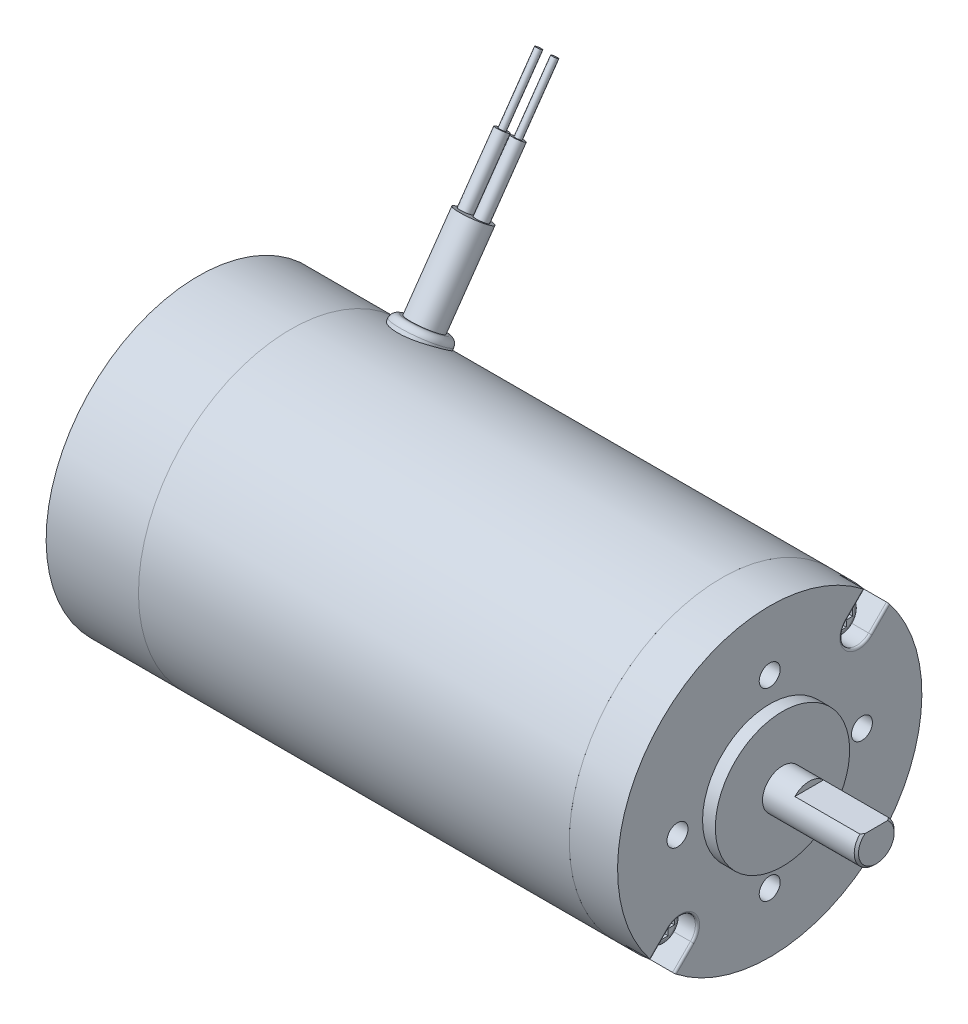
ISO-10303-21;
HEADER;
FILE_DESCRIPTION(('STEP AP214'),'2;1');
FILE_NAME('part.step','',(''),(''),'','','');
FILE_SCHEMA(('AUTOMOTIVE_DESIGN { 1 0 10303 214 1 1 1 1 }'));
ENDSEC;
DATA;
#1=APPLICATION_CONTEXT('core data for automotive mechanical design processes');
#2=APPLICATION_PROTOCOL_DEFINITION('international standard','automotive_design',2000,#1);
#3=PRODUCT_CONTEXT('',#1,'mechanical');
#4=PRODUCT('Part','Part','',(#3));
#5=PRODUCT_RELATED_PRODUCT_CATEGORY('part','',(#4));
#6=PRODUCT_DEFINITION_FORMATION('','',#4);
#7=PRODUCT_DEFINITION_CONTEXT('part definition',#1,'design');
#8=PRODUCT_DEFINITION('design','',#6,#7);
#9=PRODUCT_DEFINITION_SHAPE('','',#8);
#10=(LENGTH_UNIT() NAMED_UNIT(*) SI_UNIT(.MILLI.,.METRE.));
#11=(NAMED_UNIT(*) PLANE_ANGLE_UNIT() SI_UNIT($,.RADIAN.));
#12=(NAMED_UNIT(*) SI_UNIT($,.STERADIAN.) SOLID_ANGLE_UNIT());
#13=UNCERTAINTY_MEASURE_WITH_UNIT(LENGTH_MEASURE(1.E-05),#10,'distance_accuracy_value','');
#14=(GEOMETRIC_REPRESENTATION_CONTEXT(3) GLOBAL_UNCERTAINTY_ASSIGNED_CONTEXT((#13)) GLOBAL_UNIT_ASSIGNED_CONTEXT((#10,
#11,#12)) REPRESENTATION_CONTEXT('',''));
#15=CARTESIAN_POINT('',(0.,0.,0.));
#16=DIRECTION('',(0.,0.,1.));
#17=DIRECTION('',(1.,0.,0.));
#18=AXIS2_PLACEMENT_3D('',#15,#16,#17);
#19=CARTESIAN_POINT('',(80.77,0.,0.));
#20=DIRECTION('',(-1.,0.,0.));
#21=DIRECTION('',(0.,0.,1.));
#22=AXIS2_PLACEMENT_3D('',#19,#20,#21);
#23=CYLINDRICAL_SURFACE('',#22,2.38);
#24=CARTESIAN_POINT('',(68.07,0.,0.));
#25=DIRECTION('',(1.,0.,0.));
#26=DIRECTION('',(0.,0.,-1.));
#27=AXIS2_PLACEMENT_3D('',#24,#25,#26);
#28=CIRCLE('',#27,2.38);
#29=CARTESIAN_POINT('',(68.07,0.,-2.38));
#30=VERTEX_POINT('',#29);
#31=EDGE_CURVE('P0_E57',#30,#30,#28,.T.);
#32=ORIENTED_EDGE('',*,*,#31,.T.);
#33=EDGE_LOOP('',(#32));
#34=FACE_BOUND('',#33,.T.);
#35=DIRECTION('',(-1.,0.,0.));
#36=VECTOR('',#35,1.);
#37=CARTESIAN_POINT('',(80.77,1.66,-1.70552044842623));
#38=LINE('',#37,#36);
#39=CARTESIAN_POINT('',(80.516,1.66,-1.70552044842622));
#40=VERTEX_POINT('',#39);
#41=CARTESIAN_POINT('',(72.77,1.66,-1.70552044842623));
#42=VERTEX_POINT('',#41);
#43=EDGE_CURVE('P0_E51',#40,#42,#38,.T.);
#44=ORIENTED_EDGE('',*,*,#43,.F.);
#45=CARTESIAN_POINT('',(80.516,0.,0.));
#46=DIRECTION('',(1.,0.,0.));
#47=DIRECTION('',(0.,0.,-1.));
#48=AXIS2_PLACEMENT_3D('',#45,#46,#47);
#49=CIRCLE('',#48,2.38);
#50=CARTESIAN_POINT('',(80.516,1.66,1.70552044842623));
#51=VERTEX_POINT('',#50);
#52=EDGE_CURVE('P0_E70',#40,#51,#49,.F.);
#53=ORIENTED_EDGE('',*,*,#52,.T.);
#54=DIRECTION('',(-1.,0.,0.));
#55=VECTOR('',#54,1.);
#56=CARTESIAN_POINT('',(80.77,1.66,1.70552044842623));
#57=LINE('',#56,#55);
#58=CARTESIAN_POINT('',(72.77,1.66,1.70552044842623));
#59=VERTEX_POINT('',#58);
#60=EDGE_CURVE('P0_E33',#59,#51,#57,.F.);
#61=ORIENTED_EDGE('',*,*,#60,.F.);
#62=CARTESIAN_POINT('',(72.77,0.,0.));
#63=DIRECTION('',(1.,0.,0.));
#64=DIRECTION('',(0.,0.,-1.));
#65=AXIS2_PLACEMENT_3D('',#62,#63,#64);
#66=CIRCLE('',#65,2.38);
#67=EDGE_CURVE('P0_E11',#42,#59,#66,.T.);
#68=ORIENTED_EDGE('',*,*,#67,.F.);
#69=EDGE_LOOP('',(#44,#53,#61,#68));
#70=FACE_BOUND('',#69,.T.);
#71=ADVANCED_FACE('P0_F17',(#34,#70),#23,.T.);
#72=CARTESIAN_POINT('',(80.77,0.,0.));
#73=DIRECTION('',(1.,0.,0.));
#74=DIRECTION('',(0.,0.,-1.));
#75=AXIS2_PLACEMENT_3D('',#72,#73,#74);
#76=PLANE('',#75);
#77=CARTESIAN_POINT('',(80.77,0.,0.));
#78=DIRECTION('',(1.,0.,0.));
#79=DIRECTION('',(0.,0.,-1.));
#80=AXIS2_PLACEMENT_3D('',#77,#78,#79);
#81=CIRCLE('',#80,2.126);
#82=CARTESIAN_POINT('',(80.77,1.66,1.32826051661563));
#83=VERTEX_POINT('',#82);
#84=CARTESIAN_POINT('',(80.77,1.66,-1.32826051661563));
#85=VERTEX_POINT('',#84);
#86=EDGE_CURVE('P0_E67',#83,#85,#81,.T.);
#87=ORIENTED_EDGE('',*,*,#86,.T.);
#88=DIRECTION('',(0.,0.,-1.));
#89=VECTOR('',#88,1.);
#90=CARTESIAN_POINT('',(80.77,1.66,2.38));
#91=LINE('',#90,#89);
#92=EDGE_CURVE('P0_E60',#83,#85,#91,.T.);
#93=ORIENTED_EDGE('',*,*,#92,.F.);
#94=EDGE_LOOP('',(#87,#93));
#95=FACE_BOUND('',#94,.T.);
#96=ADVANCED_FACE('P0_F82',(#95),#76,.T.);
#97=CARTESIAN_POINT('',(80.77,0.,0.));
#98=DIRECTION('',(-1.,0.,0.));
#99=DIRECTION('',(0.,0.,1.));
#100=AXIS2_PLACEMENT_3D('',#97,#98,#99);
#101=CONICAL_SURFACE('',#100,2.126,0.785398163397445);
#102=ORIENTED_EDGE('',*,*,#52,.F.);
#103=CARTESIAN_POINT('',(77.655736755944,1.66,-4.97038820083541));
#104=CARTESIAN_POINT('',(77.8112013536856,1.66,-4.80643200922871));
#105=CARTESIAN_POINT('',(77.9663096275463,1.66,-4.64213258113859));
#106=CARTESIAN_POINT('',(78.2756381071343,1.66,-4.31225732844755));
#107=CARTESIAN_POINT('',(78.4298567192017,1.66,-4.14668001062));
#108=CARTESIAN_POINT('',(78.7449180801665,1.66,-3.80531214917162));
#109=CARTESIAN_POINT('',(78.9056785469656,1.66,-3.62944553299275));
#110=CARTESIAN_POINT('',(79.2244991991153,1.66,-3.27570617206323));
#111=CARTESIAN_POINT('',(79.3825627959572,1.66,-3.09783652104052));
#112=CARTESIAN_POINT('',(79.6165546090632,1.66,-2.82862075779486));
#113=CARTESIAN_POINT('',(79.6939648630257,1.66,-2.73856419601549));
#114=CARTESIAN_POINT('',(79.8474971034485,1.66,-2.55736119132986));
#115=CARTESIAN_POINT('',(79.9236191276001,1.66,-2.46621478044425));
#116=CARTESIAN_POINT('',(80.0745031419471,1.66,-2.28211326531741));
#117=CARTESIAN_POINT('',(80.1492574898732,1.66,-2.18915187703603));
#118=CARTESIAN_POINT('',(80.2964175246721,1.66,-2.00140785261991));
#119=CARTESIAN_POINT('',(80.368823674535,1.66,-1.90662558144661));
#120=CARTESIAN_POINT('',(80.508515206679,1.66,-1.71711507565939));
#121=CARTESIAN_POINT('',(80.5758847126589,1.66,-1.62244925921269));
#122=CARTESIAN_POINT('',(80.7061857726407,1.66,-1.4299373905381));
#123=CARTESIAN_POINT('',(80.7691130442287,1.66,-1.33208839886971));
#124=CARTESIAN_POINT('',(80.8877417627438,1.66,-1.1330740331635));
#125=CARTESIAN_POINT('',(80.9434952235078,1.66,-1.03194007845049));
#126=CARTESIAN_POINT('',(81.0446338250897,1.66,-0.824678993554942));
#127=CARTESIAN_POINT('',(81.0900440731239,1.66,-0.718564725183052));
#128=CARTESIAN_POINT('',(81.1442928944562,1.66,-0.561198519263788));
#129=CARTESIAN_POINT('',(81.1594538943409,1.66,-0.512126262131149));
#130=CARTESIAN_POINT('',(81.1860747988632,1.66,-0.412949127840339));
#131=CARTESIAN_POINT('',(81.1975331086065,1.66,-0.362843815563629));
#132=CARTESIAN_POINT('',(81.2161582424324,1.66,-0.262111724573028));
#133=CARTESIAN_POINT('',(81.2233479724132,1.66,-0.211489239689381));
#134=CARTESIAN_POINT('',(81.2331416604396,1.66,-0.109804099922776));
#135=CARTESIAN_POINT('',(81.2357464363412,1.66,-0.0587415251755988));
#136=CARTESIAN_POINT('',(81.2362190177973,1.66,0.0435949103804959));
#137=CARTESIAN_POINT('',(81.234069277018,1.66,0.0948688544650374));
#138=CARTESIAN_POINT('',(81.225125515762,1.66,0.197005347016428));
#139=CARTESIAN_POINT('',(81.2183312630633,1.66,0.247867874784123));
#140=CARTESIAN_POINT('',(81.2004266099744,1.66,0.349093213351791));
#141=CARTESIAN_POINT('',(81.1892936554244,1.66,0.39945197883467));
#142=CARTESIAN_POINT('',(81.1632414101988,1.66,0.499168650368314));
#143=CARTESIAN_POINT('',(81.1483217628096,1.66,0.548526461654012));
#144=CARTESIAN_POINT('',(81.0963839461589,1.66,0.701941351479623));
#145=CARTESIAN_POINT('',(81.053596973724,1.66,0.804045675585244));
#146=CARTESIAN_POINT('',(80.9582050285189,1.66,1.00357624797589));
#147=CARTESIAN_POINT('',(80.9055813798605,1.66,1.10099314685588));
#148=CARTESIAN_POINT('',(80.7931910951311,1.66,1.29318981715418));
#149=CARTESIAN_POINT('',(80.7333438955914,1.66,1.38792183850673));
#150=CARTESIAN_POINT('',(80.609256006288,1.66,1.57430051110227));
#151=CARTESIAN_POINT('',(80.5450192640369,1.66,1.66594982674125));
#152=CARTESIAN_POINT('',(80.4245408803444,1.66,1.83171234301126));
#153=CARTESIAN_POINT('',(80.368777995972,1.66,1.90617618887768));
#154=CARTESIAN_POINT('',(80.2556111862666,1.66,2.05384926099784));
#155=CARTESIAN_POINT('',(80.1982071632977,1.66,2.12705841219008));
#156=CARTESIAN_POINT('',(80.0240802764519,1.66,2.34521992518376));
#157=CARTESIAN_POINT('',(79.9054729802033,1.66,2.48866545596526));
#158=CARTESIAN_POINT('',(79.6649040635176,1.66,2.77310155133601));
#159=CARTESIAN_POINT('',(79.5429371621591,1.66,2.91408760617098));
#160=CARTESIAN_POINT('',(79.2968750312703,1.66,3.19414579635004));
#161=CARTESIAN_POINT('',(79.1727801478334,1.66,3.33321823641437));
#162=CARTESIAN_POINT('',(78.9335488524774,1.66,3.59838808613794));
#163=CARTESIAN_POINT('',(78.8185339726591,1.66,3.72459547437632));
#164=CARTESIAN_POINT('',(78.5875432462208,1.66,3.97613831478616));
#165=CARTESIAN_POINT('',(78.4715673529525,1.66,4.10147372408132));
#166=CARTESIAN_POINT('',(78.2392689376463,1.66,4.35104863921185));
#167=CARTESIAN_POINT('',(78.1229488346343,1.66,4.47529039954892));
#168=CARTESIAN_POINT('',(77.8897368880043,1.66,4.72321968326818));
#169=CARTESIAN_POINT('',(77.7728450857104,1.66,4.8469072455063));
#170=CARTESIAN_POINT('',(77.655736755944,1.66,4.97038820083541));
#171=B_SPLINE_CURVE_WITH_KNOTS('',3,(#103,#104,#105,#106,#107,#108,#109,#110,#111,#112,#113,
#114,#115,#116,#117,#118,#119,#120,#121,#122,#123,#124,#125,#126,#127,#128,#129,#130,#131,#132,
#133,#134,#135,#136,#137,#138,#139,#140,#141,#142,#143,#144,#145,#146,#147,#148,#149,#150,#151,
#152,#153,#154,#155,#156,#157,#158,#159,#160,#161,#162,#163,#164,#165,#166,#167,#168,#169,#170),
.UNSPECIFIED.,.F.,.F.,(4,2,2,2,2,2,2,2,2,2,2,2,2,2,2,2,2,2,2,2,2,2,2,2,2,2,2,2,2,2,2,2,2,4),(0.,
0.677838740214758,1.35665011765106,2.07144975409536,2.78526573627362,3.14151921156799,
3.49776224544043,3.85560500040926,4.21337676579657,4.56186480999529,4.9106843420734,
5.25681205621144,5.60209040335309,5.75605567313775,5.91008717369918,6.06328446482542,
6.21645442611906,6.37019059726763,6.52393445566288,6.67848842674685,6.833056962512,
7.16427221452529,7.49612281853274,7.83209302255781,8.16776496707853,8.44682444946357,
8.72590056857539,9.28420554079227,9.84344476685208,10.4025938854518,10.9148484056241,
11.4271279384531,11.9377113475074,12.4482583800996),.UNSPECIFIED.);
#172=EDGE_CURVE('P0_E26',#40,#85,#171,.T.);
#173=ORIENTED_EDGE('',*,*,#172,.T.);
#174=ORIENTED_EDGE('',*,*,#86,.F.);
#175=EDGE_CURVE('P0_E71',#83,#51,#171,.T.);
#176=ORIENTED_EDGE('',*,*,#175,.T.);
#177=EDGE_LOOP('',(#102,#173,#174,#176));
#178=FACE_BOUND('',#177,.T.);
#179=ADVANCED_FACE('P0_F19',(#178),#101,.T.);
#180=CARTESIAN_POINT('',(68.07,0.,0.));
#181=DIRECTION('',(1.,0.,0.));
#182=DIRECTION('',(0.,0.,-1.));
#183=AXIS2_PLACEMENT_3D('',#180,#181,#182);
#184=PLANE('',#183);
#185=ORIENTED_EDGE('',*,*,#31,.F.);
#186=EDGE_LOOP('',(#185));
#187=FACE_BOUND('',#186,.T.);
#188=ADVANCED_FACE('P0_F81',(#187),#184,.F.);
#189=CARTESIAN_POINT('',(72.77,2.38,-2.38));
#190=DIRECTION('',(1.,0.,0.));
#191=DIRECTION('',(0.,0.,-1.));
#192=AXIS2_PLACEMENT_3D('',#189,#190,#191);
#193=PLANE('',#192);
#194=DIRECTION('',(0.,0.,1.));
#195=VECTOR('',#194,1.);
#196=CARTESIAN_POINT('',(72.77,1.66,-2.38));
#197=LINE('',#196,#195);
#198=EDGE_CURVE('P0_E56',#42,#59,#197,.T.);
#199=ORIENTED_EDGE('',*,*,#198,.F.);
#200=ORIENTED_EDGE('',*,*,#67,.T.);
#201=EDGE_LOOP('',(#199,#200));
#202=FACE_BOUND('',#201,.T.);
#203=ADVANCED_FACE('P0_F59',(#202),#193,.T.);
#204=CARTESIAN_POINT('',(68.07,1.66,0.));
#205=DIRECTION('',(0.,1.,0.));
#206=DIRECTION('',(0.,0.,1.));
#207=AXIS2_PLACEMENT_3D('',#204,#205,#206);
#208=PLANE('',#207);
#209=ORIENTED_EDGE('',*,*,#43,.T.);
#210=ORIENTED_EDGE('',*,*,#198,.T.);
#211=ORIENTED_EDGE('',*,*,#60,.T.);
#212=ORIENTED_EDGE('',*,*,#175,.F.);
#213=ORIENTED_EDGE('',*,*,#92,.T.);
#214=ORIENTED_EDGE('',*,*,#172,.F.);
#215=EDGE_LOOP('',(#209,#210,#211,#212,#213,#214));
#216=FACE_BOUND('',#215,.T.);
#217=ADVANCED_FACE('P0_F55',(#216),#208,.T.);
#218=CLOSED_SHELL('',(#71,#96,#179,#188,#203,#217));
#219=MANIFOLD_SOLID_BREP('P0_B1',#218);
#220=CARTESIAN_POINT('',(66.07,10.6066017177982,-10.6066017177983));
#221=DIRECTION('',(1.,0.,0.));
#222=DIRECTION('',(0.,-0.0164064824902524,0.99986540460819));
#223=AXIS2_PLACEMENT_3D('',#220,#221,#222);
#224=PLANE('',#223);
#225=CARTESIAN_POINT('',(66.07,10.6066017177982,-10.6066017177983));
#226=DIRECTION('',(1.,0.,0.));
#227=DIRECTION('',(0.,-0.0164064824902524,0.99986540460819));
#228=AXIS2_PLACEMENT_3D('',#225,#226,#227);
#229=CIRCLE('',#228,1.5);
#230=CARTESIAN_POINT('',(66.07,10.5819919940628,-9.10680361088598));
#231=VERTEX_POINT('',#230);
#232=EDGE_CURVE('P1_E25',#231,#231,#229,.T.);
#233=ORIENTED_EDGE('',*,*,#232,.T.);
#234=EDGE_LOOP('',(#233));
#235=FACE_BOUND('',#234,.T.);
#236=DIRECTION('',(0.,0.0164064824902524,-0.99986540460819));
#237=VECTOR('',#236,1.);
#238=CARTESIAN_POINT('',(66.07,10.1066690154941,-10.6148049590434));
#239=LINE('',#238,#237);
#240=CARTESIAN_POINT('',(66.07,10.1148722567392,-11.1147376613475));
#241=VERTEX_POINT('',#240);
#242=CARTESIAN_POINT('',(66.07,10.1271771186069,-11.8646367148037));
#243=VERTEX_POINT('',#242);
#244=EDGE_CURVE('P1_E141',#241,#243,#239,.T.);
#245=ORIENTED_EDGE('',*,*,#244,.F.);
#246=DIRECTION('',(0.,-0.99986540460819,-0.0164064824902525));
#247=VECTOR('',#246,1.);
#248=CARTESIAN_POINT('',(66.07,10.6148049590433,-11.1065344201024));
#249=LINE('',#248,#247);
#250=CARTESIAN_POINT('',(66.07,9.36497320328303,-11.1270425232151));
#251=VERTEX_POINT('',#250);
#252=EDGE_CURVE('P1_E32',#241,#251,#249,.T.);
#253=ORIENTED_EDGE('',*,*,#252,.T.);
#254=DIRECTION('',(0.,0.0164064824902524,-0.99986540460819));
#255=VECTOR('',#254,1.);
#256=CARTESIAN_POINT('',(66.07,9.35676996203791,-10.6271098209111));
#257=LINE('',#256,#255);
#258=CARTESIAN_POINT('',(66.07,9.34856672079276,-10.1271771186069));
#259=VERTEX_POINT('',#258);
#260=EDGE_CURVE('P1_E168',#259,#251,#257,.T.);
#261=ORIENTED_EDGE('',*,*,#260,.F.);
#262=DIRECTION('',(0.,-0.99986540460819,-0.0164064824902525));
#263=VECTOR('',#262,1.);
#264=CARTESIAN_POINT('',(66.07,10.598398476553,-10.1066690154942));
#265=LINE('',#264,#263);
#266=CARTESIAN_POINT('',(66.07,10.0984657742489,-10.1148722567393));
#267=VERTEX_POINT('',#266);
#268=EDGE_CURVE('P1_E166',#267,#259,#265,.T.);
#269=ORIENTED_EDGE('',*,*,#268,.F.);
#270=DIRECTION('',(0.,0.0164064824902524,-0.99986540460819));
#271=VECTOR('',#270,1.);
#272=CARTESIAN_POINT('',(66.07,10.1066690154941,-10.6148049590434));
#273=LINE('',#272,#271);
#274=CARTESIAN_POINT('',(66.07,10.0861609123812,-9.36497320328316));
#275=VERTEX_POINT('',#274);
#276=EDGE_CURVE('P1_E115',#275,#267,#273,.T.);
#277=ORIENTED_EDGE('',*,*,#276,.F.);
#278=DIRECTION('',(0.,-0.99986540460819,-0.0164064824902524));
#279=VECTOR('',#278,1.);
#280=CARTESIAN_POINT('',(66.07,10.5860936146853,-9.35676996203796));
#281=LINE('',#280,#279);
#282=CARTESIAN_POINT('',(66.07,11.0860263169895,-9.34856672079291));
#283=VERTEX_POINT('',#282);
#284=EDGE_CURVE('P1_E162',#283,#275,#281,.T.);
#285=ORIENTED_EDGE('',*,*,#284,.F.);
#286=DIRECTION('',(0.,0.0164064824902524,-0.99986540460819));
#287=VECTOR('',#286,1.);
#288=CARTESIAN_POINT('',(66.07,11.1065344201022,-10.5983984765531));
#289=LINE('',#288,#287);
#290=CARTESIAN_POINT('',(66.07,11.0983311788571,-10.098465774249));
#291=VERTEX_POINT('',#290);
#292=EDGE_CURVE('P1_E159',#283,#291,#289,.T.);
#293=ORIENTED_EDGE('',*,*,#292,.T.);
#294=DIRECTION('',(0.,-0.99986540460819,-0.0164064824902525));
#295=VECTOR('',#294,1.);
#296=CARTESIAN_POINT('',(66.07,10.598398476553,-10.1066690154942));
#297=LINE('',#296,#295);
#298=CARTESIAN_POINT('',(66.07,11.8482302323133,-10.0861609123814));
#299=VERTEX_POINT('',#298);
#300=EDGE_CURVE('P1_E156',#299,#291,#297,.T.);
#301=ORIENTED_EDGE('',*,*,#300,.F.);
#302=DIRECTION('',(0.,0.0164064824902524,-0.99986540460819));
#303=VECTOR('',#302,1.);
#304=CARTESIAN_POINT('',(66.07,11.8564334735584,-10.5860936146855));
#305=LINE('',#304,#303);
#306=CARTESIAN_POINT('',(66.07,11.8646367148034,-11.0860263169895));
#307=VERTEX_POINT('',#306);
#308=EDGE_CURVE('P1_E153',#299,#307,#305,.T.);
#309=ORIENTED_EDGE('',*,*,#308,.T.);
#310=DIRECTION('',(0.,-0.99986540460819,-0.0164064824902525));
#311=VECTOR('',#310,1.);
#312=CARTESIAN_POINT('',(66.07,10.6148049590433,-11.1065344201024));
#313=LINE('',#312,#311);
#314=CARTESIAN_POINT('',(66.07,11.1147376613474,-11.0983311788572));
#315=VERTEX_POINT('',#314);
#316=EDGE_CURVE('P1_E150',#307,#315,#313,.T.);
#317=ORIENTED_EDGE('',*,*,#316,.T.);
#318=DIRECTION('',(0.,0.0164064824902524,-0.99986540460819));
#319=VECTOR('',#318,1.);
#320=CARTESIAN_POINT('',(66.07,11.1065344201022,-10.5983984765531));
#321=LINE('',#320,#319);
#322=CARTESIAN_POINT('',(66.07,11.1270425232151,-11.8482302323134));
#323=VERTEX_POINT('',#322);
#324=EDGE_CURVE('P1_E147',#315,#323,#321,.T.);
#325=ORIENTED_EDGE('',*,*,#324,.T.);
#326=DIRECTION('',(0.,-0.99986540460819,-0.0164064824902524));
#327=VECTOR('',#326,1.);
#328=CARTESIAN_POINT('',(66.07,10.627109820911,-11.8564334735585));
#329=LINE('',#328,#327);
#330=EDGE_CURVE('P1_E144',#323,#243,#329,.T.);
#331=ORIENTED_EDGE('',*,*,#330,.T.);
#332=EDGE_LOOP('',(#245,#253,#261,#269,#277,#285,#293,#301,#309,#317,#325,#331));
#333=FACE_BOUND('',#332,.T.);
#334=ADVANCED_FACE('P1_F17',(#235,#333),#224,.T.);
#335=CARTESIAN_POINT('',(66.07,10.6066017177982,-10.6066017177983));
#336=DIRECTION('',(-1.,0.,0.));
#337=DIRECTION('',(0.,0.0164064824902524,-0.99986540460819));
#338=AXIS2_PLACEMENT_3D('',#335,#336,#337);
#339=CYLINDRICAL_SURFACE('',#338,2.);
#340=CARTESIAN_POINT('',(65.57,10.6066017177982,-10.6066017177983));
#341=DIRECTION('',(1.,0.,0.));
#342=DIRECTION('',(0.,-0.0164064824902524,0.99986540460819));
#343=AXIS2_PLACEMENT_3D('',#340,#341,#342);
#344=CIRCLE('',#343,2.);
#345=CARTESIAN_POINT('',(65.57,10.5737887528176,-8.60687090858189));
#346=VERTEX_POINT('',#345);
#347=EDGE_CURVE('P1_E11',#346,#346,#344,.F.);
#348=ORIENTED_EDGE('',*,*,#347,.T.);
#349=EDGE_LOOP('',(#348));
#350=FACE_BOUND('',#349,.T.);
#351=CARTESIAN_POINT('',(65.07,10.6066017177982,-10.6066017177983));
#352=DIRECTION('',(1.,0.,0.));
#353=DIRECTION('',(0.,-0.0164064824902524,0.99986540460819));
#354=AXIS2_PLACEMENT_3D('',#351,#352,#353);
#355=CIRCLE('',#354,2.);
#356=CARTESIAN_POINT('',(65.07,10.5737887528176,-8.60687090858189));
#357=VERTEX_POINT('',#356);
#358=EDGE_CURVE('P1_E171',#357,#357,#355,.T.);
#359=ORIENTED_EDGE('',*,*,#358,.T.);
#360=EDGE_LOOP('',(#359));
#361=FACE_BOUND('',#360,.T.);
#362=ADVANCED_FACE('P1_F206',(#350,#361),#339,.T.);
#363=CARTESIAN_POINT('',(65.07,10.6066017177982,-10.6066017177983));
#364=DIRECTION('',(1.,0.,0.));
#365=DIRECTION('',(0.,-0.0164064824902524,0.99986540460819));
#366=AXIS2_PLACEMENT_3D('',#363,#364,#365);
#367=PLANE('',#366);
#368=ORIENTED_EDGE('',*,*,#358,.F.);
#369=EDGE_LOOP('',(#368));
#370=FACE_BOUND('',#369,.T.);
#371=ADVANCED_FACE('P1_F197',(#370),#367,.F.);
#372=CARTESIAN_POINT('',(65.57,10.6066017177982,-10.6066017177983));
#373=DIRECTION('',(1.,0.,0.));
#374=DIRECTION('',(0.,-0.0164064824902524,0.99986540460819));
#375=AXIS2_PLACEMENT_3D('',#372,#373,#374);
#376=TOROIDAL_SURFACE('',#375,1.5,0.5);
#377=ORIENTED_EDGE('',*,*,#347,.F.);
#378=EDGE_LOOP('',(#377));
#379=FACE_BOUND('',#378,.T.);
#380=ORIENTED_EDGE('',*,*,#232,.F.);
#381=EDGE_LOOP('',(#380));
#382=FACE_BOUND('',#381,.T.);
#383=ADVANCED_FACE('P1_F19',(#379,#382),#376,.T.);
#384=CARTESIAN_POINT('',(65.57,10.6148049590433,-11.1065344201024));
#385=DIRECTION('',(0.,-0.0164064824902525,0.99986540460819));
#386=DIRECTION('',(0.,-0.99986540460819,-0.0164064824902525));
#387=AXIS2_PLACEMENT_3D('',#384,#385,#386);
#388=PLANE('',#387);
#389=ORIENTED_EDGE('',*,*,#252,.F.);
#390=DIRECTION('',(1.,0.,0.));
#391=VECTOR('',#390,1.);
#392=CARTESIAN_POINT('',(65.57,10.1148722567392,-11.1147376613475));
#393=LINE('',#392,#391);
#394=CARTESIAN_POINT('',(65.57,10.1148722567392,-11.1147376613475));
#395=VERTEX_POINT('',#394);
#396=EDGE_CURVE('P1_E80',#395,#241,#393,.T.);
#397=ORIENTED_EDGE('',*,*,#396,.F.);
#398=DIRECTION('',(0.,-0.99986540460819,-0.0164064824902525));
#399=VECTOR('',#398,1.);
#400=CARTESIAN_POINT('',(65.57,10.6148049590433,-11.1065344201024));
#401=LINE('',#400,#399);
#402=CARTESIAN_POINT('',(65.57,9.36497320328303,-11.1270425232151));
#403=VERTEX_POINT('',#402);
#404=EDGE_CURVE('P1_E38',#395,#403,#401,.T.);
#405=ORIENTED_EDGE('',*,*,#404,.T.);
#406=DIRECTION('',(1.,0.,0.));
#407=VECTOR('',#406,1.);
#408=CARTESIAN_POINT('',(65.57,9.36497320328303,-11.1270425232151));
#409=LINE('',#408,#407);
#410=EDGE_CURVE('P1_E76',#403,#251,#409,.T.);
#411=ORIENTED_EDGE('',*,*,#410,.T.);
#412=EDGE_LOOP('',(#389,#397,#405,#411));
#413=FACE_BOUND('',#412,.T.);
#414=ADVANCED_FACE('P1_F196',(#413),#388,.T.);
#415=CARTESIAN_POINT('',(65.57,9.35676996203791,-10.6271098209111));
#416=DIRECTION('',(0.,-0.99986540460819,-0.0164064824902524));
#417=DIRECTION('',(0.,0.0164064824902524,-0.99986540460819));
#418=AXIS2_PLACEMENT_3D('',#415,#416,#417);
#419=PLANE('',#418);
#420=ORIENTED_EDGE('',*,*,#260,.T.);
#421=ORIENTED_EDGE('',*,*,#410,.F.);
#422=DIRECTION('',(0.,0.0164064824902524,-0.99986540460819));
#423=VECTOR('',#422,1.);
#424=CARTESIAN_POINT('',(65.57,9.35676996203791,-10.6271098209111));
#425=LINE('',#424,#423);
#426=CARTESIAN_POINT('',(65.57,9.34856672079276,-10.1271771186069));
#427=VERTEX_POINT('',#426);
#428=EDGE_CURVE('P1_E128',#427,#403,#425,.T.);
#429=ORIENTED_EDGE('',*,*,#428,.F.);
#430=DIRECTION('',(1.,0.,0.));
#431=VECTOR('',#430,1.);
#432=CARTESIAN_POINT('',(65.57,9.34856672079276,-10.1271771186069));
#433=LINE('',#432,#431);
#434=EDGE_CURVE('P1_E119',#427,#259,#433,.T.);
#435=ORIENTED_EDGE('',*,*,#434,.T.);
#436=EDGE_LOOP('',(#420,#421,#429,#435));
#437=FACE_BOUND('',#436,.T.);
#438=ADVANCED_FACE('P1_F204',(#437),#419,.F.);
#439=CARTESIAN_POINT('',(65.57,10.598398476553,-10.1066690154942));
#440=DIRECTION('',(0.,-0.0164064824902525,0.99986540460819));
#441=DIRECTION('',(0.,-0.99986540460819,-0.0164064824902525));
#442=AXIS2_PLACEMENT_3D('',#439,#440,#441);
#443=PLANE('',#442);
#444=ORIENTED_EDGE('',*,*,#268,.T.);
#445=ORIENTED_EDGE('',*,*,#434,.F.);
#446=DIRECTION('',(0.,-0.99986540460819,-0.0164064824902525));
#447=VECTOR('',#446,1.);
#448=CARTESIAN_POINT('',(65.57,10.598398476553,-10.1066690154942));
#449=LINE('',#448,#447);
#450=CARTESIAN_POINT('',(65.57,10.0984657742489,-10.1148722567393));
#451=VERTEX_POINT('',#450);
#452=EDGE_CURVE('P1_E123',#451,#427,#449,.T.);
#453=ORIENTED_EDGE('',*,*,#452,.F.);
#454=DIRECTION('',(1.,0.,0.));
#455=VECTOR('',#454,1.);
#456=CARTESIAN_POINT('',(65.57,10.0984657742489,-10.1148722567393));
#457=LINE('',#456,#455);
#458=EDGE_CURVE('P1_E108',#451,#267,#457,.T.);
#459=ORIENTED_EDGE('',*,*,#458,.T.);
#460=EDGE_LOOP('',(#444,#445,#453,#459));
#461=FACE_BOUND('',#460,.T.);
#462=ADVANCED_FACE('P1_F124',(#461),#443,.F.);
#463=CARTESIAN_POINT('',(65.57,10.1066690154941,-10.6148049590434));
#464=DIRECTION('',(0.,-0.99986540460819,-0.0164064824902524));
#465=DIRECTION('',(0.,0.0164064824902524,-0.99986540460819));
#466=AXIS2_PLACEMENT_3D('',#463,#464,#465);
#467=PLANE('',#466);
#468=ORIENTED_EDGE('',*,*,#276,.T.);
#469=ORIENTED_EDGE('',*,*,#458,.F.);
#470=DIRECTION('',(0.,0.0164064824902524,-0.99986540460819));
#471=VECTOR('',#470,1.);
#472=CARTESIAN_POINT('',(65.57,10.1066690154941,-10.6148049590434));
#473=LINE('',#472,#471);
#474=CARTESIAN_POINT('',(65.57,10.0861609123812,-9.36497320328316));
#475=VERTEX_POINT('',#474);
#476=EDGE_CURVE('P1_E112',#475,#451,#473,.T.);
#477=ORIENTED_EDGE('',*,*,#476,.F.);
#478=DIRECTION('',(1.,0.,0.));
#479=VECTOR('',#478,1.);
#480=CARTESIAN_POINT('',(65.57,10.0861609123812,-9.36497320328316));
#481=LINE('',#480,#479);
#482=EDGE_CURVE('P1_E120',#475,#275,#481,.T.);
#483=ORIENTED_EDGE('',*,*,#482,.T.);
#484=EDGE_LOOP('',(#468,#469,#477,#483));
#485=FACE_BOUND('',#484,.T.);
#486=ADVANCED_FACE('P1_F110',(#485),#467,.F.);
#487=CARTESIAN_POINT('',(65.57,10.5860936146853,-9.35676996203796));
#488=DIRECTION('',(0.,-0.0164064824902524,0.99986540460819));
#489=DIRECTION('',(0.,-0.99986540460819,-0.0164064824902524));
#490=AXIS2_PLACEMENT_3D('',#487,#488,#489);
#491=PLANE('',#490);
#492=ORIENTED_EDGE('',*,*,#284,.T.);
#493=ORIENTED_EDGE('',*,*,#482,.F.);
#494=DIRECTION('',(0.,-0.99986540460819,-0.0164064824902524));
#495=VECTOR('',#494,1.);
#496=CARTESIAN_POINT('',(65.57,10.5860936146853,-9.35676996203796));
#497=LINE('',#496,#495);
#498=CARTESIAN_POINT('',(65.57,11.0860263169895,-9.34856672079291));
#499=VERTEX_POINT('',#498);
#500=EDGE_CURVE('P1_E133',#499,#475,#497,.T.);
#501=ORIENTED_EDGE('',*,*,#500,.F.);
#502=DIRECTION('',(1.,0.,0.));
#503=VECTOR('',#502,1.);
#504=CARTESIAN_POINT('',(65.57,11.0860263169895,-9.34856672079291));
#505=LINE('',#504,#503);
#506=EDGE_CURVE('P1_E174',#499,#283,#505,.T.);
#507=ORIENTED_EDGE('',*,*,#506,.T.);
#508=EDGE_LOOP('',(#492,#493,#501,#507));
#509=FACE_BOUND('',#508,.T.);
#510=ADVANCED_FACE('P1_F244',(#509),#491,.F.);
#511=CARTESIAN_POINT('',(65.57,11.1065344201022,-10.5983984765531));
#512=DIRECTION('',(0.,-0.99986540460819,-0.0164064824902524));
#513=DIRECTION('',(0.,0.0164064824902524,-0.99986540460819));
#514=AXIS2_PLACEMENT_3D('',#511,#512,#513);
#515=PLANE('',#514);
#516=ORIENTED_EDGE('',*,*,#292,.F.);
#517=ORIENTED_EDGE('',*,*,#506,.F.);
#518=DIRECTION('',(0.,0.0164064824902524,-0.99986540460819));
#519=VECTOR('',#518,1.);
#520=CARTESIAN_POINT('',(65.57,11.1065344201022,-10.5983984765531));
#521=LINE('',#520,#519);
#522=CARTESIAN_POINT('',(65.57,11.0983311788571,-10.098465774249));
#523=VERTEX_POINT('',#522);
#524=EDGE_CURVE('P1_E135',#499,#523,#521,.T.);
#525=ORIENTED_EDGE('',*,*,#524,.T.);
#526=DIRECTION('',(1.,0.,0.));
#527=VECTOR('',#526,1.);
#528=CARTESIAN_POINT('',(65.57,11.0983311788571,-10.098465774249));
#529=LINE('',#528,#527);
#530=EDGE_CURVE('P1_E176',#523,#291,#529,.T.);
#531=ORIENTED_EDGE('',*,*,#530,.T.);
#532=EDGE_LOOP('',(#516,#517,#525,#531));
#533=FACE_BOUND('',#532,.T.);
#534=ADVANCED_FACE('P1_F240',(#533),#515,.T.);
#535=CARTESIAN_POINT('',(65.57,10.598398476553,-10.1066690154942));
#536=DIRECTION('',(0.,-0.0164064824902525,0.99986540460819));
#537=DIRECTION('',(0.,-0.99986540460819,-0.0164064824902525));
#538=AXIS2_PLACEMENT_3D('',#535,#536,#537);
#539=PLANE('',#538);
#540=ORIENTED_EDGE('',*,*,#300,.T.);
#541=ORIENTED_EDGE('',*,*,#530,.F.);
#542=DIRECTION('',(0.,-0.99986540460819,-0.0164064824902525));
#543=VECTOR('',#542,1.);
#544=CARTESIAN_POINT('',(65.57,10.598398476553,-10.1066690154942));
#545=LINE('',#544,#543);
#546=CARTESIAN_POINT('',(65.57,11.8482302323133,-10.0861609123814));
#547=VERTEX_POINT('',#546);
#548=EDGE_CURVE('P1_E381',#547,#523,#545,.T.);
#549=ORIENTED_EDGE('',*,*,#548,.F.);
#550=DIRECTION('',(1.,0.,0.));
#551=VECTOR('',#550,1.);
#552=CARTESIAN_POINT('',(65.57,11.8482302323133,-10.0861609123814));
#553=LINE('',#552,#551);
#554=EDGE_CURVE('P1_E178',#547,#299,#553,.T.);
#555=ORIENTED_EDGE('',*,*,#554,.T.);
#556=EDGE_LOOP('',(#540,#541,#549,#555));
#557=FACE_BOUND('',#556,.T.);
#558=ADVANCED_FACE('P1_F236',(#557),#539,.F.);
#559=CARTESIAN_POINT('',(65.57,11.8564334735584,-10.5860936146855));
#560=DIRECTION('',(0.,-0.99986540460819,-0.0164064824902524));
#561=DIRECTION('',(0.,0.0164064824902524,-0.99986540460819));
#562=AXIS2_PLACEMENT_3D('',#559,#560,#561);
#563=PLANE('',#562);
#564=ORIENTED_EDGE('',*,*,#308,.F.);
#565=ORIENTED_EDGE('',*,*,#554,.F.);
#566=DIRECTION('',(0.,0.0164064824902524,-0.99986540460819));
#567=VECTOR('',#566,1.);
#568=CARTESIAN_POINT('',(65.57,11.8564334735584,-10.5860936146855));
#569=LINE('',#568,#567);
#570=CARTESIAN_POINT('',(65.57,11.8646367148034,-11.0860263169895));
#571=VERTEX_POINT('',#570);
#572=EDGE_CURVE('P1_E379',#547,#571,#569,.T.);
#573=ORIENTED_EDGE('',*,*,#572,.T.);
#574=DIRECTION('',(1.,0.,0.));
#575=VECTOR('',#574,1.);
#576=CARTESIAN_POINT('',(65.57,11.8646367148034,-11.0860263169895));
#577=LINE('',#576,#575);
#578=EDGE_CURVE('P1_E180',#571,#307,#577,.T.);
#579=ORIENTED_EDGE('',*,*,#578,.T.);
#580=EDGE_LOOP('',(#564,#565,#573,#579));
#581=FACE_BOUND('',#580,.T.);
#582=ADVANCED_FACE('P1_F232',(#581),#563,.T.);
#583=CARTESIAN_POINT('',(65.57,10.6148049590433,-11.1065344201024));
#584=DIRECTION('',(0.,-0.0164064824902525,0.99986540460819));
#585=DIRECTION('',(0.,-0.99986540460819,-0.0164064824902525));
#586=AXIS2_PLACEMENT_3D('',#583,#584,#585);
#587=PLANE('',#586);
#588=ORIENTED_EDGE('',*,*,#316,.F.);
#589=ORIENTED_EDGE('',*,*,#578,.F.);
#590=DIRECTION('',(0.,-0.99986540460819,-0.0164064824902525));
#591=VECTOR('',#590,1.);
#592=CARTESIAN_POINT('',(65.57,10.6148049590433,-11.1065344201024));
#593=LINE('',#592,#591);
#594=CARTESIAN_POINT('',(65.57,11.1147376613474,-11.0983311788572));
#595=VERTEX_POINT('',#594);
#596=EDGE_CURVE('P1_E377',#571,#595,#593,.T.);
#597=ORIENTED_EDGE('',*,*,#596,.T.);
#598=DIRECTION('',(1.,0.,0.));
#599=VECTOR('',#598,1.);
#600=CARTESIAN_POINT('',(65.57,11.1147376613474,-11.0983311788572));
#601=LINE('',#600,#599);
#602=EDGE_CURVE('P1_E182',#595,#315,#601,.T.);
#603=ORIENTED_EDGE('',*,*,#602,.T.);
#604=EDGE_LOOP('',(#588,#589,#597,#603));
#605=FACE_BOUND('',#604,.T.);
#606=ADVANCED_FACE('P1_F228',(#605),#587,.T.);
#607=CARTESIAN_POINT('',(65.57,11.1065344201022,-10.5983984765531));
#608=DIRECTION('',(0.,-0.99986540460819,-0.0164064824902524));
#609=DIRECTION('',(0.,0.0164064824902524,-0.99986540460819));
#610=AXIS2_PLACEMENT_3D('',#607,#608,#609);
#611=PLANE('',#610);
#612=ORIENTED_EDGE('',*,*,#324,.F.);
#613=ORIENTED_EDGE('',*,*,#602,.F.);
#614=DIRECTION('',(0.,0.0164064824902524,-0.99986540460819));
#615=VECTOR('',#614,1.);
#616=CARTESIAN_POINT('',(65.57,11.1065344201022,-10.5983984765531));
#617=LINE('',#616,#615);
#618=CARTESIAN_POINT('',(65.57,11.1270425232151,-11.8482302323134));
#619=VERTEX_POINT('',#618);
#620=EDGE_CURVE('P1_E372',#595,#619,#617,.T.);
#621=ORIENTED_EDGE('',*,*,#620,.T.);
#622=DIRECTION('',(1.,0.,0.));
#623=VECTOR('',#622,1.);
#624=CARTESIAN_POINT('',(65.57,11.1270425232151,-11.8482302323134));
#625=LINE('',#624,#623);
#626=EDGE_CURVE('P1_E184',#619,#323,#625,.T.);
#627=ORIENTED_EDGE('',*,*,#626,.T.);
#628=EDGE_LOOP('',(#612,#613,#621,#627));
#629=FACE_BOUND('',#628,.T.);
#630=ADVANCED_FACE('P1_F224',(#629),#611,.T.);
#631=CARTESIAN_POINT('',(65.57,10.627109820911,-11.8564334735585));
#632=DIRECTION('',(0.,-0.0164064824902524,0.99986540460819));
#633=DIRECTION('',(0.,-0.99986540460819,-0.0164064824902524));
#634=AXIS2_PLACEMENT_3D('',#631,#632,#633);
#635=PLANE('',#634);
#636=ORIENTED_EDGE('',*,*,#330,.F.);
#637=ORIENTED_EDGE('',*,*,#626,.F.);
#638=DIRECTION('',(0.,-0.99986540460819,-0.0164064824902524));
#639=VECTOR('',#638,1.);
#640=CARTESIAN_POINT('',(65.57,10.627109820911,-11.8564334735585));
#641=LINE('',#640,#639);
#642=CARTESIAN_POINT('',(65.57,10.1271771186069,-11.8646367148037));
#643=VERTEX_POINT('',#642);
#644=EDGE_CURVE('P1_E370',#619,#643,#641,.T.);
#645=ORIENTED_EDGE('',*,*,#644,.T.);
#646=DIRECTION('',(1.,0.,0.));
#647=VECTOR('',#646,1.);
#648=CARTESIAN_POINT('',(65.57,10.1271771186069,-11.8646367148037));
#649=LINE('',#648,#647);
#650=EDGE_CURVE('P1_E186',#643,#243,#649,.T.);
#651=ORIENTED_EDGE('',*,*,#650,.T.);
#652=EDGE_LOOP('',(#636,#637,#645,#651));
#653=FACE_BOUND('',#652,.T.);
#654=ADVANCED_FACE('P1_F220',(#653),#635,.T.);
#655=CARTESIAN_POINT('',(65.57,10.1066690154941,-10.6148049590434));
#656=DIRECTION('',(0.,-0.99986540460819,-0.0164064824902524));
#657=DIRECTION('',(0.,0.0164064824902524,-0.99986540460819));
#658=AXIS2_PLACEMENT_3D('',#655,#656,#657);
#659=PLANE('',#658);
#660=ORIENTED_EDGE('',*,*,#244,.T.);
#661=ORIENTED_EDGE('',*,*,#650,.F.);
#662=DIRECTION('',(0.,0.0164064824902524,-0.99986540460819));
#663=VECTOR('',#662,1.);
#664=CARTESIAN_POINT('',(65.57,10.1066690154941,-10.6148049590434));
#665=LINE('',#664,#663);
#666=EDGE_CURVE('P1_E368',#395,#643,#665,.T.);
#667=ORIENTED_EDGE('',*,*,#666,.F.);
#668=ORIENTED_EDGE('',*,*,#396,.T.);
#669=EDGE_LOOP('',(#660,#661,#667,#668));
#670=FACE_BOUND('',#669,.T.);
#671=ADVANCED_FACE('P1_F217',(#670),#659,.F.);
#672=CARTESIAN_POINT('',(65.57,10.6066017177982,-10.6066017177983));
#673=DIRECTION('',(1.,0.,0.));
#674=DIRECTION('',(0.,-0.0164064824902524,0.99986540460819));
#675=AXIS2_PLACEMENT_3D('',#672,#673,#674);
#676=PLANE('',#675);
#677=ORIENTED_EDGE('',*,*,#404,.F.);
#678=ORIENTED_EDGE('',*,*,#666,.T.);
#679=ORIENTED_EDGE('',*,*,#644,.F.);
#680=ORIENTED_EDGE('',*,*,#620,.F.);
#681=ORIENTED_EDGE('',*,*,#596,.F.);
#682=ORIENTED_EDGE('',*,*,#572,.F.);
#683=ORIENTED_EDGE('',*,*,#548,.T.);
#684=ORIENTED_EDGE('',*,*,#524,.F.);
#685=ORIENTED_EDGE('',*,*,#500,.T.);
#686=ORIENTED_EDGE('',*,*,#476,.T.);
#687=ORIENTED_EDGE('',*,*,#452,.T.);
#688=ORIENTED_EDGE('',*,*,#428,.T.);
#689=EDGE_LOOP('',(#677,#678,#679,#680,#681,#682,#683,#684,#685,#686,#687,#688));
#690=FACE_BOUND('',#689,.T.);
#691=ADVANCED_FACE('P1_F130',(#690),#676,.T.);
#692=CLOSED_SHELL('',(#334,#362,#371,#383,#414,#438,#462,#486,#510,#534,#558,#582,#606,#630,
#654,#671,#691));
#693=MANIFOLD_SOLID_BREP('P1_B1',#692);
#694=CARTESIAN_POINT('',(16.,11.4681286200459,-8.03007010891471));
#695=DIRECTION('',(0.,0.819152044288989,-0.57357643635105));
#696=DIRECTION('',(0.995679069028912,-0.0532629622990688,-0.0760673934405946));
#697=AXIS2_PLACEMENT_3D('',#694,#695,#696);
#698=CYLINDRICAL_SURFACE('',#697,3.048);
#699=CARTESIAN_POINT('',(16.,15.0052271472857,-10.5067731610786));
#700=DIRECTION('',(0.,0.819152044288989,-0.57357643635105));
#701=DIRECTION('',(0.995679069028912,-0.0532629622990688,-0.0760673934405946));
#702=AXIS2_PLACEMENT_3D('',#699,#700,#701);
#703=CIRCLE('',#702,3.048);
#704=CARTESIAN_POINT('',(19.0348298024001,14.8428816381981,-10.7386265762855));
#705=VERTEX_POINT('',#704);
#706=EDGE_CURVE('P2_E18',#705,#705,#703,.F.);
#707=CARTESIAN_POINT('',(16.,11.4681286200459,-8.03007010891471));
#708=DIRECTION('',(0.,0.819152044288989,-0.57357643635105));
#709=DIRECTION('',(0.995679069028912,-0.0532629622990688,-0.0760673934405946));
#710=AXIS2_PLACEMENT_3D('',#707,#708,#709);
#711=CIRCLE('',#710,3.048);
#712=CARTESIAN_POINT('',(19.0348298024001,11.3057831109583,-8.26192352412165));
#713=VERTEX_POINT('',#712);
#714=EDGE_CURVE('P2_E50',#713,#713,#711,.T.);
#715=CARTESIAN_POINT('',(19.0348298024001,14.8428816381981,-10.7386265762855));
#716=CARTESIAN_POINT('',(19.0348298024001,14.8060368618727,-10.7128275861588));
#717=CARTESIAN_POINT('',(19.0348298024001,14.7691920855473,-10.6870285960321));
#718=CARTESIAN_POINT('',(19.0348298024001,14.6955025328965,-10.6354306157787));
#719=CARTESIAN_POINT('',(19.0348298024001,14.6586577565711,-10.6096316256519));
#720=CARTESIAN_POINT('',(19.0348298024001,14.5849682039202,-10.5580336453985));
#721=CARTESIAN_POINT('',(19.0348298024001,14.5481234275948,-10.5322346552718));
#722=CARTESIAN_POINT('',(19.0348298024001,14.474433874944,-10.4806366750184));
#723=CARTESIAN_POINT('',(19.0348298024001,14.4375890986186,-10.4548376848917));
#724=CARTESIAN_POINT('',(19.0348298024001,14.3638995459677,-10.4032397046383));
#725=CARTESIAN_POINT('',(19.0348298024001,14.3270547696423,-10.3774407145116));
#726=CARTESIAN_POINT('',(19.0348298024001,14.2533652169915,-10.3258427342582));
#727=CARTESIAN_POINT('',(19.0348298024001,14.2165204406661,-10.3000437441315));
#728=CARTESIAN_POINT('',(19.0348298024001,14.1428308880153,-10.2484457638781));
#729=CARTESIAN_POINT('',(19.0348298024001,14.1059861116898,-10.2226467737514));
#730=CARTESIAN_POINT('',(19.0348298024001,14.032296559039,-10.1710487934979));
#731=CARTESIAN_POINT('',(19.0348298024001,13.9954517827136,-10.1452498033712));
#732=CARTESIAN_POINT('',(19.0348298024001,13.9217622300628,-10.0936518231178));
#733=CARTESIAN_POINT('',(19.0348298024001,13.8849174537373,-10.0678528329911));
#734=CARTESIAN_POINT('',(19.0348298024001,13.8112279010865,-10.0162548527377));
#735=CARTESIAN_POINT('',(19.0348298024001,13.7743831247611,-9.99045586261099));
#736=CARTESIAN_POINT('',(19.0348298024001,13.7006935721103,-9.93885788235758));
#737=CARTESIAN_POINT('',(19.0348298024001,13.6638487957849,-9.91305889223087));
#738=CARTESIAN_POINT('',(19.0348298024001,13.590159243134,-9.86146091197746));
#739=CARTESIAN_POINT('',(19.0348298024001,13.5533144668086,-9.83566192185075));
#740=CARTESIAN_POINT('',(19.0348298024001,13.4796249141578,-9.78406394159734));
#741=CARTESIAN_POINT('',(19.0348298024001,13.4427801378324,-9.75826495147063));
#742=CARTESIAN_POINT('',(19.0348298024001,13.3690905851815,-9.70666697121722));
#743=CARTESIAN_POINT('',(19.0348298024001,13.3322458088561,-9.68086798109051));
#744=CARTESIAN_POINT('',(19.0348298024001,13.2585562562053,-9.6292700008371));
#745=CARTESIAN_POINT('',(19.0348298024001,13.2217114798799,-9.60347101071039));
#746=CARTESIAN_POINT('',(19.0348298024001,13.148021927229,-9.55187303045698));
#747=CARTESIAN_POINT('',(19.0348298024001,13.1111771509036,-9.52607404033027));
#748=CARTESIAN_POINT('',(19.0348298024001,13.0374875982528,-9.47447606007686));
#749=CARTESIAN_POINT('',(19.0348298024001,13.0006428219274,-9.44867706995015));
#750=CARTESIAN_POINT('',(19.0348298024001,12.9269532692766,-9.39707908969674));
#751=CARTESIAN_POINT('',(19.0348298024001,12.8901084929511,-9.37128009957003));
#752=CARTESIAN_POINT('',(19.0348298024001,12.8164189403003,-9.31968211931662));
#753=CARTESIAN_POINT('',(19.0348298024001,12.7795741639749,-9.29388312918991));
#754=CARTESIAN_POINT('',(19.0348298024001,12.7058846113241,-9.2422851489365));
#755=CARTESIAN_POINT('',(19.0348298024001,12.6690398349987,-9.21648615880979));
#756=CARTESIAN_POINT('',(19.0348298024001,12.5953502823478,-9.16488817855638));
#757=CARTESIAN_POINT('',(19.0348298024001,12.5585055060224,-9.13908918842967));
#758=CARTESIAN_POINT('',(19.0348298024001,12.4848159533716,-9.08749120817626));
#759=CARTESIAN_POINT('',(19.0348298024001,12.4479711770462,-9.06169221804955));
#760=CARTESIAN_POINT('',(19.0348298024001,12.3742816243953,-9.01009423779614));
#761=CARTESIAN_POINT('',(19.0348298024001,12.3374368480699,-8.98429524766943));
#762=CARTESIAN_POINT('',(19.0348298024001,12.2637472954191,-8.93269726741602));
#763=CARTESIAN_POINT('',(19.0348298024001,12.2269025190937,-8.90689827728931));
#764=CARTESIAN_POINT('',(19.0348298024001,12.1532129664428,-8.8553002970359));
#765=CARTESIAN_POINT('',(19.0348298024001,12.1163681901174,-8.82950130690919));
#766=CARTESIAN_POINT('',(19.0348298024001,12.0426786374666,-8.77790332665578));
#767=CARTESIAN_POINT('',(19.0348298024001,12.0058338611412,-8.75210433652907));
#768=CARTESIAN_POINT('',(19.0348298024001,11.9321443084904,-8.70050635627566));
#769=CARTESIAN_POINT('',(19.0348298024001,11.8952995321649,-8.67470736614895));
#770=CARTESIAN_POINT('',(19.0348298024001,11.8216099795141,-8.62310938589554));
#771=CARTESIAN_POINT('',(19.0348298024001,11.7847652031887,-8.59731039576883));
#772=CARTESIAN_POINT('',(19.0348298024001,11.7110756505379,-8.54571241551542));
#773=CARTESIAN_POINT('',(19.0348298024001,11.6742308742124,-8.51991342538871));
#774=CARTESIAN_POINT('',(19.0348298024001,11.6005413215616,-8.4683154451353));
#775=CARTESIAN_POINT('',(19.0348298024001,11.5636965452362,-8.44251645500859));
#776=CARTESIAN_POINT('',(19.0348298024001,11.4900069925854,-8.39091847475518));
#777=CARTESIAN_POINT('',(19.0348298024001,11.45316221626,-8.36511948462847));
#778=CARTESIAN_POINT('',(19.0348298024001,11.3794726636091,-8.31352150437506));
#779=CARTESIAN_POINT('',(19.0348298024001,11.3426278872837,-8.28772251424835));
#780=CARTESIAN_POINT('',(19.0348298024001,11.3057831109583,-8.26192352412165));
#781=B_SPLINE_CURVE_WITH_KNOTS('',3,(#715,#716,#717,#718,#719,#720,#721,#722,#723,#724,#725,
#726,#727,#728,#729,#730,#731,#732,#733,#734,#735,#736,#737,#738,#739,#740,#741,#742,#743,#744,
#745,#746,#747,#748,#749,#750,#751,#752,#753,#754,#755,#756,#757,#758,#759,#760,#761,#762,#763,
#764,#765,#766,#767,#768,#769,#770,#771,#772,#773,#774,#775,#776,#777,#778,#779,#780),
.UNSPECIFIED.,.F.,.F.,(4,2,2,2,2,2,2,2,2,2,2,2,2,2,2,2,2,2,2,2,2,2,2,2,2,2,2,2,2,2,2,2,4),(0.,
0.1349375,0.269875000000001,0.404812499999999,0.53975,0.674687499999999,0.809625,
0.944562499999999,1.0795,1.2144375,1.349375,1.4843125,1.61925,1.7541875,1.889125,2.0240625,
2.159,2.2939375,2.428875,2.5638125,2.69875,2.8336875,2.968625,3.1035625,3.2385,3.3734375,
3.508375,3.6433125,3.77825,3.9131875,4.048125,4.1830625,4.318),.UNSPECIFIED.);
#782=EDGE_CURVE('P2_BSEAM14',#705,#713,#781,.T.);
#783=ORIENTED_EDGE('',*,*,#706,.T.);
#784=ORIENTED_EDGE('',*,*,#714,.T.);
#785=ORIENTED_EDGE('',*,*,#782,.T.);
#786=ORIENTED_EDGE('',*,*,#782,.F.);
#787=EDGE_LOOP('',(#783,#785,#784,#786));
#788=FACE_BOUND('',#787,.T.);
#789=ADVANCED_FACE('P2_F14',(#788),#698,.T.);
#790=CARTESIAN_POINT('',(16.,11.4681286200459,-8.03007010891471));
#791=DIRECTION('',(0.,0.819152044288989,-0.57357643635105));
#792=DIRECTION('',(0.995679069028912,-0.0532629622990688,-0.0760673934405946));
#793=AXIS2_PLACEMENT_3D('',#790,#791,#792);
#794=PLANE('',#793);
#795=ORIENTED_EDGE('',*,*,#714,.F.);
#796=EDGE_LOOP('',(#795));
#797=FACE_BOUND('',#796,.T.);
#798=ADVANCED_FACE('P2_F75',(#797),#794,.F.);
#799=CARTESIAN_POINT('',(16.,15.6294210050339,-10.9438384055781));
#800=DIRECTION('',(0.,0.819152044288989,-0.57357643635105));
#801=DIRECTION('',(0.995679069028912,-0.0532629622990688,-0.0760673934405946));
#802=AXIS2_PLACEMENT_3D('',#799,#800,#801);
#803=PLANE('',#802);
#804=CARTESIAN_POINT('',(16.,15.6294210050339,-10.9438384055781));
#805=DIRECTION('',(0.,0.819152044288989,-0.57357643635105));
#806=DIRECTION('',(0.995679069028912,-0.0532629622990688,-0.0760673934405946));
#807=AXIS2_PLACEMENT_3D('',#804,#805,#806);
#808=CIRCLE('',#807,1.9939);
#809=CARTESIAN_POINT('',(14.0147155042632,15.735622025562,-10.7921676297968));
#810=VERTEX_POINT('',#809);
#811=EDGE_CURVE('P2_E44',#810,#810,#808,.T.);
#812=ORIENTED_EDGE('',*,*,#811,.F.);
#813=EDGE_LOOP('',(#812));
#814=FACE_BOUND('',#813,.T.);
#815=CARTESIAN_POINT('',(16.,15.6294210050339,-10.9438384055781));
#816=DIRECTION('',(0.,0.819152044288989,-0.57357643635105));
#817=DIRECTION('',(0.995679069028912,-0.0532629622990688,-0.0760673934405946));
#818=AXIS2_PLACEMENT_3D('',#815,#816,#817);
#819=CIRCLE('',#818,2.286);
#820=CARTESIAN_POINT('',(18.2761223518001,15.5076618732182,-11.1177284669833));
#821=VERTEX_POINT('',#820);
#822=EDGE_CURVE('P2_E54',#821,#821,#819,.T.);
#823=ORIENTED_EDGE('',*,*,#822,.T.);
#824=EDGE_LOOP('',(#823));
#825=FACE_BOUND('',#824,.T.);
#826=ADVANCED_FACE('P2_F66',(#814,#825),#803,.T.);
#827=CARTESIAN_POINT('',(16.,15.0052271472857,-10.5067731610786));
#828=DIRECTION('',(0.,0.819152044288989,-0.57357643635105));
#829=DIRECTION('',(0.995679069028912,-0.0532629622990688,-0.0760673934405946));
#830=AXIS2_PLACEMENT_3D('',#827,#828,#829);
#831=TOROIDAL_SURFACE('',#830,2.286,0.762);
#832=ORIENTED_EDGE('',*,*,#706,.F.);
#833=EDGE_LOOP('',(#832));
#834=FACE_BOUND('',#833,.T.);
#835=ORIENTED_EDGE('',*,*,#822,.F.);
#836=EDGE_LOOP('',(#835));
#837=FACE_BOUND('',#836,.T.);
#838=ADVANCED_FACE('P2_F16',(#834,#837),#831,.T.);
#839=CARTESIAN_POINT('',(16.,23.95200577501,-16.7713749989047));
#840=DIRECTION('',(0.,-0.819152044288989,0.57357643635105));
#841=DIRECTION('',(-0.995679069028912,0.0532629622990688,0.0760673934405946));
#842=AXIS2_PLACEMENT_3D('',#839,#840,#841);
#843=CYLINDRICAL_SURFACE('',#842,1.9939);
#844=CARTESIAN_POINT('',(16.,23.95200577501,-16.7713749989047));
#845=DIRECTION('',(0.,0.819152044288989,-0.57357643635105));
#846=DIRECTION('',(0.995679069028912,-0.0532629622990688,-0.0760673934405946));
#847=AXIS2_PLACEMENT_3D('',#844,#845,#846);
#848=CIRCLE('',#847,1.9939);
#849=CARTESIAN_POINT('',(14.0147155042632,24.0582067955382,-16.6197042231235));
#850=VERTEX_POINT('',#849);
#851=EDGE_CURVE('P2_E47',#850,#850,#848,.T.);
#852=CARTESIAN_POINT('',(14.0147155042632,24.0582067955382,-16.6197042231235));
#853=CARTESIAN_POINT('',(14.0147155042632,23.9715132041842,-16.559000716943));
#854=CARTESIAN_POINT('',(14.0147155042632,23.8848196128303,-16.4982972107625));
#855=CARTESIAN_POINT('',(14.0147155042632,23.7114324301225,-16.3768901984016));
#856=CARTESIAN_POINT('',(14.0147155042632,23.6247388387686,-16.3161866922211));
#857=CARTESIAN_POINT('',(14.0147155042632,23.4513516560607,-16.1947796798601));
#858=CARTESIAN_POINT('',(14.0147155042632,23.3646580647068,-16.1340761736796));
#859=CARTESIAN_POINT('',(14.0147155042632,23.191270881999,-16.0126691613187));
#860=CARTESIAN_POINT('',(14.0147155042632,23.1045772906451,-15.9519656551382));
#861=CARTESIAN_POINT('',(14.0147155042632,22.9311901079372,-15.8305586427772));
#862=CARTESIAN_POINT('',(14.0147155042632,22.8444965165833,-15.7698551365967));
#863=CARTESIAN_POINT('',(14.0147155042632,22.6711093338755,-15.6484481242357));
#864=CARTESIAN_POINT('',(14.0147155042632,22.5844157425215,-15.5877446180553));
#865=CARTESIAN_POINT('',(14.0147155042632,22.4110285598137,-15.4663376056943));
#866=CARTESIAN_POINT('',(14.0147155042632,22.3243349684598,-15.4056340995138));
#867=CARTESIAN_POINT('',(14.0147155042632,22.150947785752,-15.2842270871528));
#868=CARTESIAN_POINT('',(14.0147155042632,22.064254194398,-15.2235235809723));
#869=CARTESIAN_POINT('',(14.0147155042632,21.8908670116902,-15.1021165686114));
#870=CARTESIAN_POINT('',(14.0147155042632,21.8041734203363,-15.0414130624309));
#871=CARTESIAN_POINT('',(14.0147155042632,21.6307862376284,-14.9200060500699));
#872=CARTESIAN_POINT('',(14.0147155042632,21.5440926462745,-14.8593025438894));
#873=CARTESIAN_POINT('',(14.0147155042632,21.3707054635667,-14.7378955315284));
#874=CARTESIAN_POINT('',(14.0147155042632,21.2840118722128,-14.677192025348));
#875=CARTESIAN_POINT('',(14.0147155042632,21.1106246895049,-14.555785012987));
#876=CARTESIAN_POINT('',(14.0147155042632,21.023931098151,-14.4950815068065));
#877=CARTESIAN_POINT('',(14.0147155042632,20.8505439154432,-14.3736744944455));
#878=CARTESIAN_POINT('',(14.0147155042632,20.7638503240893,-14.312970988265));
#879=CARTESIAN_POINT('',(14.0147155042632,20.5904631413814,-14.1915639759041));
#880=CARTESIAN_POINT('',(14.0147155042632,20.5037695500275,-14.1308604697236));
#881=CARTESIAN_POINT('',(14.0147155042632,20.3303823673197,-14.0094534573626));
#882=CARTESIAN_POINT('',(14.0147155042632,20.2436887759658,-13.9487499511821));
#883=CARTESIAN_POINT('',(14.0147155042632,20.0703015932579,-13.8273429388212));
#884=CARTESIAN_POINT('',(14.0147155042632,19.983608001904,-13.7666394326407));
#885=CARTESIAN_POINT('',(14.0147155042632,19.8102208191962,-13.6452324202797));
#886=CARTESIAN_POINT('',(14.0147155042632,19.7235272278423,-13.5845289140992));
#887=CARTESIAN_POINT('',(14.0147155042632,19.5501400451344,-13.4631219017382));
#888=CARTESIAN_POINT('',(14.0147155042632,19.4634464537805,-13.4024183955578));
#889=CARTESIAN_POINT('',(14.0147155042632,19.2900592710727,-13.2810113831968));
#890=CARTESIAN_POINT('',(14.0147155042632,19.2033656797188,-13.2203078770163));
#891=CARTESIAN_POINT('',(14.0147155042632,19.0299784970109,-13.0989008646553));
#892=CARTESIAN_POINT('',(14.0147155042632,18.943284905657,-13.0381973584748));
#893=CARTESIAN_POINT('',(14.0147155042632,18.7698977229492,-12.9167903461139));
#894=CARTESIAN_POINT('',(14.0147155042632,18.6832041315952,-12.8560868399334));
#895=CARTESIAN_POINT('',(14.0147155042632,18.5098169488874,-12.7346798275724));
#896=CARTESIAN_POINT('',(14.0147155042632,18.4231233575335,-12.6739763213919));
#897=CARTESIAN_POINT('',(14.0147155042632,18.2497361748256,-12.5525693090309));
#898=CARTESIAN_POINT('',(14.0147155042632,18.1630425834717,-12.4918658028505));
#899=CARTESIAN_POINT('',(14.0147155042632,17.9896554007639,-12.3704587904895));
#900=CARTESIAN_POINT('',(14.0147155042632,17.90296180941,-12.309755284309));
#901=CARTESIAN_POINT('',(14.0147155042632,17.7295746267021,-12.188348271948));
#902=CARTESIAN_POINT('',(14.0147155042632,17.6428810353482,-12.1276447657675));
#903=CARTESIAN_POINT('',(14.0147155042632,17.4694938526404,-12.0062377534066));
#904=CARTESIAN_POINT('',(14.0147155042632,17.3828002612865,-11.9455342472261));
#905=CARTESIAN_POINT('',(14.0147155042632,17.2094130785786,-11.8241272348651));
#906=CARTESIAN_POINT('',(14.0147155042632,17.1227194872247,-11.7634237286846));
#907=CARTESIAN_POINT('',(14.0147155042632,16.9493323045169,-11.6420167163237));
#908=CARTESIAN_POINT('',(14.0147155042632,16.862638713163,-11.5813132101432));
#909=CARTESIAN_POINT('',(14.0147155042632,16.6892515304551,-11.4599061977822));
#910=CARTESIAN_POINT('',(14.0147155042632,16.6025579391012,-11.3992026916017));
#911=CARTESIAN_POINT('',(14.0147155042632,16.4291707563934,-11.2777956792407));
#912=CARTESIAN_POINT('',(14.0147155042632,16.3424771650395,-11.2170921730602));
#913=CARTESIAN_POINT('',(14.0147155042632,16.1690899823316,-11.0956851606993));
#914=CARTESIAN_POINT('',(14.0147155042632,16.0823963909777,-11.0349816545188));
#915=CARTESIAN_POINT('',(14.0147155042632,15.9090092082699,-10.9135746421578));
#916=CARTESIAN_POINT('',(14.0147155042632,15.8223156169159,-10.8528711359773));
#917=CARTESIAN_POINT('',(14.0147155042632,15.735622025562,-10.7921676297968));
#918=B_SPLINE_CURVE_WITH_KNOTS('',3,(#852,#853,#854,#855,#856,#857,#858,#859,#860,#861,#862,
#863,#864,#865,#866,#867,#868,#869,#870,#871,#872,#873,#874,#875,#876,#877,#878,#879,#880,#881,
#882,#883,#884,#885,#886,#887,#888,#889,#890,#891,#892,#893,#894,#895,#896,#897,#898,#899,#900,
#901,#902,#903,#904,#905,#906,#907,#908,#909,#910,#911,#912,#913,#914,#915,#916,#917),
.UNSPECIFIED.,.F.,.F.,(4,2,2,2,2,2,2,2,2,2,2,2,2,2,2,2,2,2,2,2,2,2,2,2,2,2,2,2,2,2,2,2,4),(0.,
0.317500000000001,0.635000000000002,0.952500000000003,1.27,1.5875,1.905,2.2225,2.54,2.8575,
3.175,3.4925,3.81,4.1275,4.445,4.7625,5.08,5.3975,5.715,6.0325,6.35,6.6675,6.985,7.3025,7.62,
7.9375,8.255,8.5725,8.89,9.2075,9.525,9.8425,10.16),.UNSPECIFIED.);
#919=EDGE_CURVE('P2_BSEAM65',#850,#810,#918,.T.);
#920=ORIENTED_EDGE('',*,*,#851,.F.);
#921=ORIENTED_EDGE('',*,*,#811,.T.);
#922=ORIENTED_EDGE('',*,*,#919,.T.);
#923=ORIENTED_EDGE('',*,*,#919,.F.);
#924=EDGE_LOOP('',(#920,#922,#921,#923));
#925=FACE_BOUND('',#924,.T.);
#926=ADVANCED_FACE('P2_F65',(#925),#843,.T.);
#927=CARTESIAN_POINT('',(16.,23.95200577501,-16.7713749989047));
#928=DIRECTION('',(0.,0.819152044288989,-0.57357643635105));
#929=DIRECTION('',(0.995679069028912,-0.0532629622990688,-0.0760673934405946));
#930=AXIS2_PLACEMENT_3D('',#927,#928,#929);
#931=PLANE('',#930);
#932=CARTESIAN_POINT('',(16.8851586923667,23.9046550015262,-16.8389989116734));
#933=DIRECTION('',(0.,0.819152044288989,-0.57357643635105));
#934=DIRECTION('',(0.995679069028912,-0.0532629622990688,-0.0760673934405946));
#935=AXIS2_PLACEMENT_3D('',#932,#933,#934);
#936=CIRCLE('',#935,0.762);
#937=CARTESIAN_POINT('',(16.1264512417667,23.9452413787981,-16.7810355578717));
#938=VERTEX_POINT('',#937);
#939=EDGE_CURVE('P2_E34',#938,#938,#936,.T.);
#940=ORIENTED_EDGE('',*,*,#939,.F.);
#941=EDGE_LOOP('',(#940));
#942=FACE_BOUND('',#941,.T.);
#943=CARTESIAN_POINT('',(15.1148413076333,23.9993565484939,-16.703751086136));
#944=DIRECTION('',(0.,0.819152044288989,-0.57357643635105));
#945=DIRECTION('',(0.995679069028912,-0.0532629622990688,-0.0760673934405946));
#946=AXIS2_PLACEMENT_3D('',#943,#944,#945);
#947=CIRCLE('',#946,0.762);
#948=CARTESIAN_POINT('',(14.3561338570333,24.0399429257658,-16.6457877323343));
#949=VERTEX_POINT('',#948);
#950=EDGE_CURVE('P2_E27',#949,#949,#947,.T.);
#951=ORIENTED_EDGE('',*,*,#950,.F.);
#952=EDGE_LOOP('',(#951));
#953=FACE_BOUND('',#952,.T.);
#954=ORIENTED_EDGE('',*,*,#851,.T.);
#955=EDGE_LOOP('',(#954));
#956=FACE_BOUND('',#955,.T.);
#957=ADVANCED_FACE('P2_F72',(#942,#953,#956),#931,.T.);
#958=CARTESIAN_POINT('',(15.1148413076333,30.241295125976,-21.074403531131));
#959=DIRECTION('',(0.,-0.819152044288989,0.57357643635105));
#960=DIRECTION('',(-0.995679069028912,0.0532629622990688,0.0760673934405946));
#961=AXIS2_PLACEMENT_3D('',#958,#959,#960);
#962=CYLINDRICAL_SURFACE('',#961,0.762);
#963=CARTESIAN_POINT('',(15.1148413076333,30.241295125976,-21.074403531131));
#964=DIRECTION('',(0.,0.819152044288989,-0.57357643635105));
#965=DIRECTION('',(0.995679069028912,-0.0532629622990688,-0.0760673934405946));
#966=AXIS2_PLACEMENT_3D('',#963,#964,#965);
#967=CIRCLE('',#966,0.762);
#968=CARTESIAN_POINT('',(14.3561338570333,30.2818815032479,-21.0164401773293));
#969=VERTEX_POINT('',#968);
#970=EDGE_CURVE('P2_E39',#969,#969,#967,.T.);
#971=CARTESIAN_POINT('',(14.3561338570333,30.2818815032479,-21.0164401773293));
#972=CARTESIAN_POINT('',(14.3561338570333,30.2168613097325,-20.9709125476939));
#973=CARTESIAN_POINT('',(14.3561338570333,30.151841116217,-20.9253849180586));
#974=CARTESIAN_POINT('',(14.3561338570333,30.0218007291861,-20.8343296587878));
#975=CARTESIAN_POINT('',(14.3561338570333,29.9567805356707,-20.7888020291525));
#976=CARTESIAN_POINT('',(14.3561338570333,29.8267401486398,-20.6977467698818));
#977=CARTESIAN_POINT('',(14.3561338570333,29.7617199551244,-20.6522191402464));
#978=CARTESIAN_POINT('',(14.3561338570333,29.6316795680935,-20.5611638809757));
#979=CARTESIAN_POINT('',(14.3561338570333,29.5666593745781,-20.5156362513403));
#980=CARTESIAN_POINT('',(14.3561338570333,29.4366189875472,-20.4245809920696));
#981=CARTESIAN_POINT('',(14.3561338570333,29.3715987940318,-20.3790533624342));
#982=CARTESIAN_POINT('',(14.3561338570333,29.2415584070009,-20.2879981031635));
#983=CARTESIAN_POINT('',(14.3561338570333,29.1765382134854,-20.2424704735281));
#984=CARTESIAN_POINT('',(14.3561338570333,29.0464978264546,-20.1514152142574));
#985=CARTESIAN_POINT('',(14.3561338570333,28.9814776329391,-20.105887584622));
#986=CARTESIAN_POINT('',(14.3561338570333,28.8514372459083,-20.0148323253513));
#987=CARTESIAN_POINT('',(14.3561338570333,28.7864170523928,-19.9693046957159));
#988=CARTESIAN_POINT('',(14.3561338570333,28.6563766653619,-19.8782494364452));
#989=CARTESIAN_POINT('',(14.3561338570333,28.5913564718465,-19.8327218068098));
#990=CARTESIAN_POINT('',(14.3561338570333,28.4613160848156,-19.7416665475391));
#991=CARTESIAN_POINT('',(14.3561338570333,28.3962958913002,-19.6961389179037));
#992=CARTESIAN_POINT('',(14.3561338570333,28.2662555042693,-19.605083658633));
#993=CARTESIAN_POINT('',(14.3561338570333,28.2012353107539,-19.5595560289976));
#994=CARTESIAN_POINT('',(14.3561338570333,28.071194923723,-19.4685007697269));
#995=CARTESIAN_POINT('',(14.3561338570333,28.0061747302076,-19.4229731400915));
#996=CARTESIAN_POINT('',(14.3561338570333,27.8761343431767,-19.3319178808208));
#997=CARTESIAN_POINT('',(14.3561338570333,27.8111141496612,-19.2863902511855));
#998=CARTESIAN_POINT('',(14.3561338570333,27.6810737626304,-19.1953349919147));
#999=CARTESIAN_POINT('',(14.3561338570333,27.6160535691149,-19.1498073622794));
#1000=CARTESIAN_POINT('',(14.3561338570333,27.486013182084,-19.0587521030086));
#1001=CARTESIAN_POINT('',(14.3561338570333,27.4209929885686,-19.0132244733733));
#1002=CARTESIAN_POINT('',(14.3561338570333,27.2909526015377,-18.9221692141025));
#1003=CARTESIAN_POINT('',(14.3561338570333,27.2259324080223,-18.8766415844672));
#1004=CARTESIAN_POINT('',(14.3561338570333,27.0958920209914,-18.7855863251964));
#1005=CARTESIAN_POINT('',(14.3561338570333,27.030871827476,-18.7400586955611));
#1006=CARTESIAN_POINT('',(14.3561338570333,26.9008314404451,-18.6490034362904));
#1007=CARTESIAN_POINT('',(14.3561338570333,26.8358112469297,-18.603475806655));
#1008=CARTESIAN_POINT('',(14.3561338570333,26.7057708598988,-18.5124205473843));
#1009=CARTESIAN_POINT('',(14.3561338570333,26.6407506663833,-18.4668929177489));
#1010=CARTESIAN_POINT('',(14.3561338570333,26.5107102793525,-18.3758376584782));
#1011=CARTESIAN_POINT('',(14.3561338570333,26.445690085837,-18.3303100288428));
#1012=CARTESIAN_POINT('',(14.3561338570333,26.3156496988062,-18.2392547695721));
#1013=CARTESIAN_POINT('',(14.3561338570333,26.2506295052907,-18.1937271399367));
#1014=CARTESIAN_POINT('',(14.3561338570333,26.1205891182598,-18.102671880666));
#1015=CARTESIAN_POINT('',(14.3561338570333,26.0555689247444,-18.0571442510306));
#1016=CARTESIAN_POINT('',(14.3561338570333,25.9255285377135,-17.9660889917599));
#1017=CARTESIAN_POINT('',(14.3561338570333,25.8605083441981,-17.9205613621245));
#1018=CARTESIAN_POINT('',(14.3561338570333,25.7304679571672,-17.8295061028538));
#1019=CARTESIAN_POINT('',(14.3561338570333,25.6654477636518,-17.7839784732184));
#1020=CARTESIAN_POINT('',(14.3561338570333,25.5354073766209,-17.6929232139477));
#1021=CARTESIAN_POINT('',(14.3561338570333,25.4703871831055,-17.6473955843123));
#1022=CARTESIAN_POINT('',(14.3561338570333,25.3403467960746,-17.5563403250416));
#1023=CARTESIAN_POINT('',(14.3561338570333,25.2753266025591,-17.5108126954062));
#1024=CARTESIAN_POINT('',(14.3561338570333,25.1452862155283,-17.4197574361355));
#1025=CARTESIAN_POINT('',(14.3561338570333,25.0802660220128,-17.3742298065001));
#1026=CARTESIAN_POINT('',(14.3561338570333,24.9502256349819,-17.2831745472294));
#1027=CARTESIAN_POINT('',(14.3561338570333,24.8852054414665,-17.237646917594));
#1028=CARTESIAN_POINT('',(14.3561338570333,24.7551650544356,-17.1465916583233));
#1029=CARTESIAN_POINT('',(14.3561338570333,24.6901448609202,-17.101064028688));
#1030=CARTESIAN_POINT('',(14.3561338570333,24.5601044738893,-17.0100087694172));
#1031=CARTESIAN_POINT('',(14.3561338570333,24.4950842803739,-16.9644811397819));
#1032=CARTESIAN_POINT('',(14.3561338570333,24.365043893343,-16.8734258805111));
#1033=CARTESIAN_POINT('',(14.3561338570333,24.3000236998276,-16.8278982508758));
#1034=CARTESIAN_POINT('',(14.3561338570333,24.1699833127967,-16.736842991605));
#1035=CARTESIAN_POINT('',(14.3561338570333,24.1049631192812,-16.6913153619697));
#1036=CARTESIAN_POINT('',(14.3561338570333,24.0399429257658,-16.6457877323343));
#1037=B_SPLINE_CURVE_WITH_KNOTS('',3,(#971,#972,#973,#974,#975,#976,#977,#978,#979,#980,#981,
#982,#983,#984,#985,#986,#987,#988,#989,#990,#991,#992,#993,#994,#995,#996,#997,#998,#999,#1000,
#1001,#1002,#1003,#1004,#1005,#1006,#1007,#1008,#1009,#1010,#1011,#1012,#1013,#1014,#1015,#1016,
#1017,#1018,#1019,#1020,#1021,#1022,#1023,#1024,#1025,#1026,#1027,#1028,#1029,#1030,#1031,#1032,
#1033,#1034,#1035,#1036),.UNSPECIFIED.,.F.,.F.,(4,2,2,2,2,2,2,2,2,2,2,2,2,2,2,2,2,2,2,2,2,2,2,2,
2,2,2,2,2,2,2,2,4),(0.,0.238124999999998,0.476249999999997,0.714374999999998,0.952499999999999,
1.190625,1.42875,1.666875,1.905,2.143125,2.38125,2.619375,2.8575,3.095625,3.33375,3.571875,3.81,
4.048125,4.28625,4.524375,4.7625,5.000625,5.23875,5.476875,5.715,5.953125,6.19125,6.429375,
6.6675,6.905625,7.14375,7.381875,7.62),.UNSPECIFIED.);
#1038=EDGE_CURVE('P2_BSEAM87',#969,#949,#1037,.T.);
#1039=ORIENTED_EDGE('',*,*,#970,.F.);
#1040=ORIENTED_EDGE('',*,*,#950,.T.);
#1041=ORIENTED_EDGE('',*,*,#1038,.T.);
#1042=ORIENTED_EDGE('',*,*,#1038,.F.);
#1043=EDGE_LOOP('',(#1039,#1041,#1040,#1042));
#1044=FACE_BOUND('',#1043,.T.);
#1045=ADVANCED_FACE('P2_F87',(#1044),#962,.T.);
#1046=CARTESIAN_POINT('',(15.1148413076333,30.241295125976,-21.074403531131));
#1047=DIRECTION('',(0.,0.819152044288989,-0.57357643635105));
#1048=DIRECTION('',(0.995679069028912,-0.0532629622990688,-0.0760673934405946));
#1049=AXIS2_PLACEMENT_3D('',#1046,#1047,#1048);
#1050=PLANE('',#1049);
#1051=CARTESIAN_POINT('',(15.1148413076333,30.241295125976,-21.074403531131));
#1052=DIRECTION('',(0.,0.819152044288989,-0.57357643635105));
#1053=DIRECTION('',(0.995679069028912,-0.0532629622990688,-0.0760673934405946));
#1054=AXIS2_PLACEMENT_3D('',#1051,#1052,#1053);
#1055=CIRCLE('',#1054,0.381);
#1056=CARTESIAN_POINT('',(15.4941950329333,30.2210019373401,-21.1033852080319));
#1057=VERTEX_POINT('',#1056);
#1058=EDGE_CURVE('P2_E22',#1057,#1057,#1055,.T.);
#1059=ORIENTED_EDGE('',*,*,#1058,.F.);
#1060=EDGE_LOOP('',(#1059));
#1061=FACE_BOUND('',#1060,.T.);
#1062=ORIENTED_EDGE('',*,*,#970,.T.);
#1063=EDGE_LOOP('',(#1062));
#1064=FACE_BOUND('',#1063,.T.);
#1065=ADVANCED_FACE('P2_F91',(#1061,#1064),#1050,.T.);
#1066=CARTESIAN_POINT('',(16.8851586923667,30.1465935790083,-21.2096513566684));
#1067=DIRECTION('',(0.,-0.819152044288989,0.57357643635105));
#1068=DIRECTION('',(-0.995679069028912,0.0532629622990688,0.0760673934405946));
#1069=AXIS2_PLACEMENT_3D('',#1066,#1067,#1068);
#1070=CYLINDRICAL_SURFACE('',#1069,0.762);
#1071=CARTESIAN_POINT('',(16.8851586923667,30.1465935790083,-21.2096513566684));
#1072=DIRECTION('',(0.,0.819152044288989,-0.57357643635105));
#1073=DIRECTION('',(0.995679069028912,-0.0532629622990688,-0.0760673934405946));
#1074=AXIS2_PLACEMENT_3D('',#1071,#1072,#1073);
#1075=CIRCLE('',#1074,0.762);
#1076=CARTESIAN_POINT('',(16.1264512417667,30.1871799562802,-21.1516880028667));
#1077=VERTEX_POINT('',#1076);
#1078=EDGE_CURVE('P2_E36',#1077,#1077,#1075,.T.);
#1079=CARTESIAN_POINT('',(16.1264512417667,30.1871799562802,-21.1516880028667));
#1080=CARTESIAN_POINT('',(16.1264512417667,30.1221597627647,-21.1061603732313));
#1081=CARTESIAN_POINT('',(16.1264512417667,30.0571395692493,-21.060632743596));
#1082=CARTESIAN_POINT('',(16.1264512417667,29.9270991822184,-20.9695774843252));
#1083=CARTESIAN_POINT('',(16.1264512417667,29.862078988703,-20.9240498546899));
#1084=CARTESIAN_POINT('',(16.1264512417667,29.7320386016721,-20.8329945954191));
#1085=CARTESIAN_POINT('',(16.1264512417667,29.6670184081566,-20.7874669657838));
#1086=CARTESIAN_POINT('',(16.1264512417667,29.5369780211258,-20.696411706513));
#1087=CARTESIAN_POINT('',(16.1264512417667,29.4719578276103,-20.6508840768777));
#1088=CARTESIAN_POINT('',(16.1264512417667,29.3419174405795,-20.5598288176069));
#1089=CARTESIAN_POINT('',(16.1264512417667,29.276897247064,-20.5143011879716));
#1090=CARTESIAN_POINT('',(16.1264512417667,29.1468568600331,-20.4232459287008));
#1091=CARTESIAN_POINT('',(16.1264512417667,29.0818366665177,-20.3777182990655));
#1092=CARTESIAN_POINT('',(16.1264512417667,28.9517962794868,-20.2866630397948));
#1093=CARTESIAN_POINT('',(16.1264512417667,28.8867760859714,-20.2411354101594));
#1094=CARTESIAN_POINT('',(16.1264512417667,28.7567356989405,-20.1500801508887));
#1095=CARTESIAN_POINT('',(16.1264512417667,28.6917155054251,-20.1045525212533));
#1096=CARTESIAN_POINT('',(16.1264512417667,28.5616751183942,-20.0134972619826));
#1097=CARTESIAN_POINT('',(16.1264512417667,28.4966549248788,-19.9679696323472));
#1098=CARTESIAN_POINT('',(16.1264512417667,28.3666145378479,-19.8769143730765));
#1099=CARTESIAN_POINT('',(16.1264512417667,28.3015943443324,-19.8313867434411));
#1100=CARTESIAN_POINT('',(16.1264512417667,28.1715539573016,-19.7403314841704));
#1101=CARTESIAN_POINT('',(16.1264512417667,28.1065337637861,-19.694803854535));
#1102=CARTESIAN_POINT('',(16.1264512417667,27.9764933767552,-19.6037485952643));
#1103=CARTESIAN_POINT('',(16.1264512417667,27.9114731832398,-19.5582209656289));
#1104=CARTESIAN_POINT('',(16.1264512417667,27.7814327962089,-19.4671657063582));
#1105=CARTESIAN_POINT('',(16.1264512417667,27.7164126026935,-19.4216380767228));
#1106=CARTESIAN_POINT('',(16.1264512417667,27.5863722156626,-19.3305828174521));
#1107=CARTESIAN_POINT('',(16.1264512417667,27.5213520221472,-19.2850551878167));
#1108=CARTESIAN_POINT('',(16.1264512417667,27.3913116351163,-19.193999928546));
#1109=CARTESIAN_POINT('',(16.1264512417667,27.3262914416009,-19.1484722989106));
#1110=CARTESIAN_POINT('',(16.1264512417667,27.19625105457,-19.0574170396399));
#1111=CARTESIAN_POINT('',(16.1264512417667,27.1312308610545,-19.0118894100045));
#1112=CARTESIAN_POINT('',(16.1264512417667,27.0011904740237,-18.9208341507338));
#1113=CARTESIAN_POINT('',(16.1264512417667,26.9361702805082,-18.8753065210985));
#1114=CARTESIAN_POINT('',(16.1264512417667,26.8061298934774,-18.7842512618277));
#1115=CARTESIAN_POINT('',(16.1264512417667,26.7411096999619,-18.7387236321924));
#1116=CARTESIAN_POINT('',(16.1264512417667,26.611069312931,-18.6476683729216));
#1117=CARTESIAN_POINT('',(16.1264512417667,26.5460491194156,-18.6021407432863));
#1118=CARTESIAN_POINT('',(16.1264512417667,26.4160087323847,-18.5110854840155));
#1119=CARTESIAN_POINT('',(16.1264512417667,26.3509885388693,-18.4655578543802));
#1120=CARTESIAN_POINT('',(16.1264512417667,26.2209481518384,-18.3745025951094));
#1121=CARTESIAN_POINT('',(16.1264512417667,26.155927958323,-18.3289749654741));
#1122=CARTESIAN_POINT('',(16.1264512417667,26.0258875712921,-18.2379197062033));
#1123=CARTESIAN_POINT('',(16.1264512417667,25.9608673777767,-18.192392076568));
#1124=CARTESIAN_POINT('',(16.1264512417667,25.8308269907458,-18.1013368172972));
#1125=CARTESIAN_POINT('',(16.1264512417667,25.7658067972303,-18.0558091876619));
#1126=CARTESIAN_POINT('',(16.1264512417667,25.6357664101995,-17.9647539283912));
#1127=CARTESIAN_POINT('',(16.1264512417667,25.570746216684,-17.9192262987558));
#1128=CARTESIAN_POINT('',(16.1264512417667,25.4407058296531,-17.8281710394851));
#1129=CARTESIAN_POINT('',(16.1264512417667,25.3756856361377,-17.7826434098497));
#1130=CARTESIAN_POINT('',(16.1264512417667,25.2456452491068,-17.691588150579));
#1131=CARTESIAN_POINT('',(16.1264512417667,25.1806250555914,-17.6460605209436));
#1132=CARTESIAN_POINT('',(16.1264512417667,25.0505846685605,-17.5550052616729));
#1133=CARTESIAN_POINT('',(16.1264512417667,24.9855644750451,-17.5094776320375));
#1134=CARTESIAN_POINT('',(16.1264512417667,24.8555240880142,-17.4184223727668));
#1135=CARTESIAN_POINT('',(16.1264512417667,24.7905038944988,-17.3728947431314));
#1136=CARTESIAN_POINT('',(16.1264512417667,24.6604635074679,-17.2818394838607));
#1137=CARTESIAN_POINT('',(16.1264512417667,24.5954433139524,-17.2363118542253));
#1138=CARTESIAN_POINT('',(16.1264512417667,24.4654029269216,-17.1452565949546));
#1139=CARTESIAN_POINT('',(16.1264512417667,24.4003827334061,-17.0997289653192));
#1140=CARTESIAN_POINT('',(16.1264512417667,24.2703423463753,-17.0086737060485));
#1141=CARTESIAN_POINT('',(16.1264512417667,24.2053221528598,-16.9631460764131));
#1142=CARTESIAN_POINT('',(16.1264512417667,24.0752817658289,-16.8720908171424));
#1143=CARTESIAN_POINT('',(16.1264512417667,24.0102615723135,-16.826563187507));
#1144=CARTESIAN_POINT('',(16.1264512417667,23.9452413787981,-16.7810355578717));
#1145=B_SPLINE_CURVE_WITH_KNOTS('',3,(#1079,#1080,#1081,#1082,#1083,#1084,#1085,#1086,#1087,
#1088,#1089,#1090,#1091,#1092,#1093,#1094,#1095,#1096,#1097,#1098,#1099,#1100,#1101,#1102,#1103,
#1104,#1105,#1106,#1107,#1108,#1109,#1110,#1111,#1112,#1113,#1114,#1115,#1116,#1117,#1118,#1119,
#1120,#1121,#1122,#1123,#1124,#1125,#1126,#1127,#1128,#1129,#1130,#1131,#1132,#1133,#1134,#1135,
#1136,#1137,#1138,#1139,#1140,#1141,#1142,#1143,#1144),.UNSPECIFIED.,.F.,.F.,(4,2,2,2,2,2,2,2,2,
2,2,2,2,2,2,2,2,2,2,2,2,2,2,2,2,2,2,2,2,2,2,2,4),(0.,0.238124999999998,0.476249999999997,
0.714374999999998,0.952499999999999,1.190625,1.42875,1.666875,1.905,2.143125,2.38125,2.619375,
2.8575,3.095625,3.33375,3.571875,3.81,4.048125,4.28625,4.524375,4.7625,5.000625,5.23875,
5.476875,5.715,5.953125,6.19125,6.429375,6.6675,6.905625,7.14375,7.381875,7.62),.UNSPECIFIED.);
#1146=EDGE_CURVE('P2_BSEAM95',#1077,#938,#1145,.T.);
#1147=ORIENTED_EDGE('',*,*,#1078,.F.);
#1148=ORIENTED_EDGE('',*,*,#939,.T.);
#1149=ORIENTED_EDGE('',*,*,#1146,.T.);
#1150=ORIENTED_EDGE('',*,*,#1146,.F.);
#1151=EDGE_LOOP('',(#1147,#1149,#1148,#1150));
#1152=FACE_BOUND('',#1151,.T.);
#1153=ADVANCED_FACE('P2_F95',(#1152),#1070,.T.);
#1154=CARTESIAN_POINT('',(16.8851586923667,30.1465935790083,-21.2096513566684));
#1155=DIRECTION('',(0.,0.819152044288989,-0.57357643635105));
#1156=DIRECTION('',(0.995679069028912,-0.0532629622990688,-0.0760673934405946));
#1157=AXIS2_PLACEMENT_3D('',#1154,#1155,#1156);
#1158=PLANE('',#1157);
#1159=CARTESIAN_POINT('',(16.8851586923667,30.1465935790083,-21.2096513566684));
#1160=DIRECTION('',(0.,0.819152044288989,-0.57357643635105));
#1161=DIRECTION('',(0.995679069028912,-0.0532629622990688,-0.0760673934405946));
#1162=AXIS2_PLACEMENT_3D('',#1159,#1160,#1161);
#1163=CIRCLE('',#1162,0.381);
#1164=CARTESIAN_POINT('',(17.2645124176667,30.1263003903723,-21.2386330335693));
#1165=VERTEX_POINT('',#1164);
#1166=EDGE_CURVE('P2_E9',#1165,#1165,#1163,.T.);
#1167=ORIENTED_EDGE('',*,*,#1166,.F.);
#1168=EDGE_LOOP('',(#1167));
#1169=FACE_BOUND('',#1168,.T.);
#1170=ORIENTED_EDGE('',*,*,#1078,.T.);
#1171=EDGE_LOOP('',(#1170));
#1172=FACE_BOUND('',#1171,.T.);
#1173=ADVANCED_FACE('P2_F99',(#1169,#1172),#1158,.T.);
#1174=CARTESIAN_POINT('',(15.1148413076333,36.4832337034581,-25.445055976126));
#1175=DIRECTION('',(0.,-0.819152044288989,0.57357643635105));
#1176=DIRECTION('',(-0.995679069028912,0.0532629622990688,0.0760673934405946));
#1177=AXIS2_PLACEMENT_3D('',#1174,#1175,#1176);
#1178=CYLINDRICAL_SURFACE('',#1177,0.381);
#1179=CARTESIAN_POINT('',(15.1148413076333,36.4832337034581,-25.445055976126));
#1180=DIRECTION('',(0.,0.819152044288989,-0.57357643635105));
#1181=DIRECTION('',(0.995679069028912,-0.0532629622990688,-0.0760673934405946));
#1182=AXIS2_PLACEMENT_3D('',#1179,#1180,#1181);
#1183=CIRCLE('',#1182,0.381);
#1184=CARTESIAN_POINT('',(15.4941950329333,36.4629405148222,-25.4740376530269));
#1185=VERTEX_POINT('',#1184);
#1186=EDGE_CURVE('P2_E32',#1185,#1185,#1183,.T.);
#1187=ORIENTED_EDGE('',*,*,#1186,.F.);
#1188=EDGE_LOOP('',(#1187));
#1189=FACE_BOUND('',#1188,.T.);
#1190=ORIENTED_EDGE('',*,*,#1058,.T.);
#1191=EDGE_LOOP('',(#1190));
#1192=FACE_BOUND('',#1191,.T.);
#1193=ADVANCED_FACE('P2_F103',(#1189,#1192),#1178,.T.);
#1194=CARTESIAN_POINT('',(15.1148413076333,36.4832337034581,-25.445055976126));
#1195=DIRECTION('',(0.,0.819152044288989,-0.57357643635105));
#1196=DIRECTION('',(0.995679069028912,-0.0532629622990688,-0.0760673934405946));
#1197=AXIS2_PLACEMENT_3D('',#1194,#1195,#1196);
#1198=PLANE('',#1197);
#1199=ORIENTED_EDGE('',*,*,#1186,.T.);
#1200=EDGE_LOOP('',(#1199));
#1201=FACE_BOUND('',#1200,.T.);
#1202=ADVANCED_FACE('P2_F107',(#1201),#1198,.T.);
#1203=CARTESIAN_POINT('',(16.8851586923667,36.3885321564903,-25.5803038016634));
#1204=DIRECTION('',(0.,-0.819152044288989,0.57357643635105));
#1205=DIRECTION('',(-0.995679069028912,0.0532629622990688,0.0760673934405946));
#1206=AXIS2_PLACEMENT_3D('',#1203,#1204,#1205);
#1207=CYLINDRICAL_SURFACE('',#1206,0.381);
#1208=CARTESIAN_POINT('',(16.8851586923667,36.3885321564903,-25.5803038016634));
#1209=DIRECTION('',(0.,0.819152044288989,-0.57357643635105));
#1210=DIRECTION('',(0.995679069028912,-0.0532629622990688,-0.0760673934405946));
#1211=AXIS2_PLACEMENT_3D('',#1208,#1209,#1210);
#1212=CIRCLE('',#1211,0.381);
#1213=CARTESIAN_POINT('',(17.2645124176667,36.3682389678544,-25.6092854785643));
#1214=VERTEX_POINT('',#1213);
#1215=EDGE_CURVE('P2_E31',#1214,#1214,#1212,.T.);
#1216=ORIENTED_EDGE('',*,*,#1215,.F.);
#1217=EDGE_LOOP('',(#1216));
#1218=FACE_BOUND('',#1217,.T.);
#1219=ORIENTED_EDGE('',*,*,#1166,.T.);
#1220=EDGE_LOOP('',(#1219));
#1221=FACE_BOUND('',#1220,.T.);
#1222=ADVANCED_FACE('P2_F111',(#1218,#1221),#1207,.T.);
#1223=CARTESIAN_POINT('',(16.8851586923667,36.3885321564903,-25.5803038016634));
#1224=DIRECTION('',(0.,0.819152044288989,-0.57357643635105));
#1225=DIRECTION('',(0.995679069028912,-0.0532629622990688,-0.0760673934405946));
#1226=AXIS2_PLACEMENT_3D('',#1223,#1224,#1225);
#1227=PLANE('',#1226);
#1228=ORIENTED_EDGE('',*,*,#1215,.T.);
#1229=EDGE_LOOP('',(#1228));
#1230=FACE_BOUND('',#1229,.T.);
#1231=ADVANCED_FACE('P2_F115',(#1230),#1227,.T.);
#1232=CLOSED_SHELL('',(#789,#798,#826,#838,#926,#957,#1045,#1065,#1153,#1173,#1193,#1202,#1222,#1231));
#1233=MANIFOLD_SOLID_BREP('P2_B1',#1232);
#1234=CARTESIAN_POINT('',(11.,0.,0.));
#1235=DIRECTION('',(1.,0.,0.));
#1236=DIRECTION('',(0.,-0.707106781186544,0.707106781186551));
#1237=AXIS2_PLACEMENT_3D('',#1234,#1235,#1236);
#1238=PLANE('',#1237);
#1239=CARTESIAN_POINT('',(11.0000000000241,0.,0.));
#1240=DIRECTION('',(1.,0.,0.));
#1241=DIRECTION('',(0.,-0.707106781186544,0.707106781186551));
#1242=AXIS2_PLACEMENT_3D('',#1239,#1240,#1241);
#1243=CIRCLE('',#1242,18.125);
#1244=CARTESIAN_POINT('',(11.0000000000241,-12.8163104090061,12.8163104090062));
#1245=VERTEX_POINT('',#1244);
#1246=EDGE_CURVE('P3_E22',#1245,#1245,#1243,.T.);
#1247=ORIENTED_EDGE('',*,*,#1246,.F.);
#1248=EDGE_LOOP('',(#1247));
#1249=FACE_BOUND('',#1248,.T.);
#1250=ADVANCED_FACE('P3_F15',(#1249),#1238,.F.);
#1251=CARTESIAN_POINT('',(-500000.,0.,0.));
#1252=DIRECTION('',(1.,0.,0.));
#1253=DIRECTION('',(0.,-0.707106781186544,0.707106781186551));
#1254=AXIS2_PLACEMENT_3D('',#1251,#1252,#1253);
#1255=CYLINDRICAL_SURFACE('',#1254,18.125);
#1256=CARTESIAN_POINT('',(16.,15.9036176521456,-8.69428378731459));
#1257=CARTESIAN_POINT('',(16.1119733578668,15.9036160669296,-8.69428855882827));
#1258=CARTESIAN_POINT('',(16.2240191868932,15.8990702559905,-8.70261794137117));
#1259=CARTESIAN_POINT('',(16.4449997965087,15.8809345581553,-8.73566735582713));
#1260=CARTESIAN_POINT('',(16.5539310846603,15.8673349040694,-8.76040508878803));
#1261=CARTESIAN_POINT('',(16.7654507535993,15.8312819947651,-8.82538993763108));
#1262=CARTESIAN_POINT('',(16.8680431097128,15.8088343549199,-8.86562721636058));
#1263=CARTESIAN_POINT('',(17.0640579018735,15.7554107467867,-8.9602228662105));
#1264=CARTESIAN_POINT('',(17.1574820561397,15.7244363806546,-9.01457858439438));
#1265=CARTESIAN_POINT('',(17.3329399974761,15.6542927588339,-9.13584448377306));
#1266=CARTESIAN_POINT('',(17.4149277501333,15.6150918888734,-9.20280299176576));
#1267=CARTESIAN_POINT('',(17.5647886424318,15.5292309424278,-9.3469586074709));
#1268=CARTESIAN_POINT('',(17.6326611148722,15.4825705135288,-9.42415619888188));
#1269=CARTESIAN_POINT('',(17.752526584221,15.3825481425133,-9.58655000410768));
#1270=CARTESIAN_POINT('',(17.8044784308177,15.3291693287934,-9.67176621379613));
#1271=CARTESIAN_POINT('',(17.8907645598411,15.2169567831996,-9.84737002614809));
#1272=CARTESIAN_POINT('',(17.9250993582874,15.1581232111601,-9.93775747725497));
#1273=CARTESIAN_POINT('',(17.9750406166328,15.0366770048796,-10.1205709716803));
#1274=CARTESIAN_POINT('',(17.990723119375,14.9740808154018,-10.2129871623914));
#1275=CARTESIAN_POINT('',(18.003150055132,14.8465642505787,-10.3974865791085));
#1276=CARTESIAN_POINT('',(17.9998950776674,14.7816439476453,-10.4895698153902));
#1277=CARTESIAN_POINT('',(17.9746008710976,14.6516486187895,-10.6703873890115));
#1278=CARTESIAN_POINT('',(17.9526434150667,14.5865754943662,-10.7591345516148));
#1279=CARTESIAN_POINT('',(17.8906951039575,14.4579961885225,-10.931309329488));
#1280=CARTESIAN_POINT('',(17.8507039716,14.3944900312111,-11.0147368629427));
#1281=CARTESIAN_POINT('',(17.753734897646,14.2709748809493,-11.1743059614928));
#1282=CARTESIAN_POINT('',(17.696721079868,14.2109735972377,-11.2504316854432));
#1283=CARTESIAN_POINT('',(17.5673511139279,14.0966564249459,-11.3933441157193));
#1284=CARTESIAN_POINT('',(17.4949944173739,14.0423407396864,-11.4601304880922));
#1285=CARTESIAN_POINT('',(17.3365334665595,13.9410538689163,-11.5831359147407));
#1286=CARTESIAN_POINT('',(17.2503580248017,13.8941233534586,-11.639296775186));
#1287=CARTESIAN_POINT('',(17.0669517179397,13.8097119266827,-11.739326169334));
#1288=CARTESIAN_POINT('',(16.9697208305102,13.7722310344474,-11.7831946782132));
#1289=CARTESIAN_POINT('',(16.7669057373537,13.7081668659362,-11.8576646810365));
#1290=CARTESIAN_POINT('',(16.6613191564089,13.6815867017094,-11.888262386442));
#1291=CARTESIAN_POINT('',(16.4448191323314,13.6404119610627,-11.9354839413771));
#1292=CARTESIAN_POINT('',(16.3339058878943,13.6258169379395,-11.9521083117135));
#1293=CARTESIAN_POINT('',(16.1105256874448,13.6092577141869,-11.9709602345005));
#1294=CARTESIAN_POINT('',(15.998069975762,13.6072274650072,-11.9732630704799));
#1295=CARTESIAN_POINT('',(15.7742489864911,13.6157053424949,-11.9636212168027));
#1296=CARTESIAN_POINT('',(15.662883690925,13.6262132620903,-11.9516767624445));
#1297=CARTESIAN_POINT('',(15.444698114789,13.6592918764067,-11.913857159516));
#1298=CARTESIAN_POINT('',(15.3378668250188,13.6818313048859,-11.888018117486));
#1299=CARTESIAN_POINT('',(15.1314387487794,13.7380504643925,-11.8230042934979));
#1300=CARTESIAN_POINT('',(15.0318421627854,13.771730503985,-11.7838291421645));
#1301=CARTESIAN_POINT('',(14.8422582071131,13.8490849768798,-11.6928199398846));
#1302=CARTESIAN_POINT('',(14.7523122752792,13.8928001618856,-11.6409342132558));
#1303=CARTESIAN_POINT('',(14.58500407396,13.9885027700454,-11.5257540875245));
#1304=CARTESIAN_POINT('',(14.5076421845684,14.0404904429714,-11.4624593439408));
#1305=CARTESIAN_POINT('',(14.367352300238,14.1511041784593,-11.3256185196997));
#1306=CARTESIAN_POINT('',(14.3044894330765,14.2097584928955,-11.2520284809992));
#1307=CARTESIAN_POINT('',(14.195431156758,14.3314655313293,-11.0965963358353));
#1308=CARTESIAN_POINT('',(14.1492354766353,14.3945181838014,-11.014754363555));
#1309=CARTESIAN_POINT('',(14.074932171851,14.5227715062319,-10.8450914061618));
#1310=CARTESIAN_POINT('',(14.0467858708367,14.5879672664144,-10.7572836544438));
#1311=CARTESIAN_POINT('',(14.0092542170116,14.7185633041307,-10.5778930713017));
#1312=CARTESIAN_POINT('',(13.9998682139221,14.7839635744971,-10.4863103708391));
#1313=CARTESIAN_POINT('',(14.0001338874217,14.9126739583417,-10.3024418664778));
#1314=CARTESIAN_POINT('',(14.0096847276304,14.9759933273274,-10.2101623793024));
#1315=CARTESIAN_POINT('',(14.0473407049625,15.0991766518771,-10.0270965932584));
#1316=CARTESIAN_POINT('',(14.0754458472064,15.1590406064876,-9.93631029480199));
#1317=CARTESIAN_POINT('',(14.1493831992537,15.273818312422,-9.7589581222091));
#1318=CARTESIAN_POINT('',(14.1952117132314,15.3287330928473,-9.67239137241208));
#1319=CARTESIAN_POINT('',(14.3032843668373,15.4324129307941,-9.50609645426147));
#1320=CARTESIAN_POINT('',(14.3655285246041,15.4811779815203,-9.42636829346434));
#1321=CARTESIAN_POINT('',(14.5050420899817,15.5718356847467,-9.27584661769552));
#1322=CARTESIAN_POINT('',(14.5823866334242,15.6136919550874,-9.20510082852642));
#1323=CARTESIAN_POINT('',(14.7497530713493,15.6895009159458,-9.0752880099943));
#1324=CARTESIAN_POINT('',(14.8397779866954,15.723451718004,-9.01622377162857));
#1325=CARTESIAN_POINT('',(15.030256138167,15.7829885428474,-8.91159601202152));
#1326=CARTESIAN_POINT('',(15.1307402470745,15.8085488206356,-8.86607408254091));
#1327=CARTESIAN_POINT('',(15.3390018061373,15.8507643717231,-8.79038049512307));
#1328=CARTESIAN_POINT('',(15.4467709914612,15.8674295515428,-8.76019176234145));
#1329=CARTESIAN_POINT('',(15.6292757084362,15.8875536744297,-8.72361871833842));
#1330=CARTESIAN_POINT('',(15.702850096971,15.8935731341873,-8.71263615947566));
#1331=CARTESIAN_POINT('',(15.8509389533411,15.9016056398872,-8.6979671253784));
#1332=CARTESIAN_POINT('',(15.9254534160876,15.9036187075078,-8.69428061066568));
#1333=CARTESIAN_POINT('',(16.,15.9036176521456,-8.69428378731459));
#1334=B_SPLINE_CURVE_WITH_KNOTS('',3,(#1256,#1257,#1258,#1259,#1260,#1261,#1262,#1263,#1264,
#1265,#1266,#1267,#1268,#1269,#1270,#1271,#1272,#1273,#1274,#1275,#1276,#1277,#1278,#1279,#1280,
#1281,#1282,#1283,#1284,#1285,#1286,#1287,#1288,#1289,#1290,#1291,#1292,#1293,#1294,#1295,#1296,
#1297,#1298,#1299,#1300,#1301,#1302,#1303,#1304,#1305,#1306,#1307,#1308,#1309,#1310,#1311,#1312,
#1313,#1314,#1315,#1316,#1317,#1318,#1319,#1320,#1321,#1322,#1323,#1324,#1325,#1326,#1327,#1328,
#1329,#1330,#1331,#1332,#1333),.UNSPECIFIED.,.T.,.F.,(4,2,2,2,2,2,2,2,2,2,2,2,2,2,2,2,2,2,2,2,2,
2,2,2,2,2,2,2,2,2,2,2,2,2,2,2,2,2,4),(0.,0.335647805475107,0.671658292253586,1.00745587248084,
1.34319039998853,1.68023958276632,2.01730469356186,2.35523381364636,2.69315303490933,
3.02968983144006,3.36621615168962,3.70127858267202,4.03634616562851,4.37212496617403,
4.70791577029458,5.04549552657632,5.38307596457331,5.72075271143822,6.05841687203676,
6.39430453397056,6.73018664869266,7.06520012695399,7.40022288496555,7.73663098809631,
8.07304925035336,8.41095044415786,8.74884614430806,9.08601535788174,9.42317288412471,
9.75853990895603,10.0939070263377,10.4292042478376,10.7645018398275,11.1015123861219,
11.4386033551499,11.7767191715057,12.1144576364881,12.3379173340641,12.5613758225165),.UNSPECIFIED.);
#1335=CARTESIAN_POINT('',(16.,15.9036176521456,-8.69428378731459));
#1336=VERTEX_POINT('',#1335);
#1337=EDGE_CURVE('P3_E26',#1336,#1336,#1334,.T.);
#1338=ORIENTED_EDGE('',*,*,#1337,.F.);
#1339=EDGE_LOOP('',(#1338));
#1340=FACE_BOUND('',#1339,.T.);
#1341=ORIENTED_EDGE('',*,*,#1246,.T.);
#1342=EDGE_LOOP('',(#1341));
#1343=FACE_BOUND('',#1342,.T.);
#1344=CARTESIAN_POINT('',(62.32,0.,0.));
#1345=DIRECTION('',(-1.,0.,0.));
#1346=DIRECTION('',(0.,0.707106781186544,-0.707106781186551));
#1347=AXIS2_PLACEMENT_3D('',#1344,#1345,#1346);
#1348=CIRCLE('',#1347,18.125);
#1349=CARTESIAN_POINT('',(62.32,12.8163104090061,-12.8163104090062));
#1350=VERTEX_POINT('',#1349);
#1351=EDGE_CURVE('P3_E10',#1350,#1350,#1348,.T.);
#1352=ORIENTED_EDGE('',*,*,#1351,.T.);
#1353=EDGE_LOOP('',(#1352));
#1354=FACE_BOUND('',#1353,.T.);
#1355=ADVANCED_FACE('P3_F17',(#1340,#1343,#1354),#1255,.T.);
#1356=CARTESIAN_POINT('',(62.32,0.,0.));
#1357=DIRECTION('',(-1.,0.,0.));
#1358=DIRECTION('',(0.,0.707106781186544,-0.707106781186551));
#1359=AXIS2_PLACEMENT_3D('',#1356,#1357,#1358);
#1360=PLANE('',#1359);
#1361=ORIENTED_EDGE('',*,*,#1351,.F.);
#1362=EDGE_LOOP('',(#1361));
#1363=FACE_BOUND('',#1362,.T.);
#1364=ADVANCED_FACE('P3_F44',(#1363),#1360,.F.);
#1365=CARTESIAN_POINT('',(16.,15.5638888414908,-10.89795229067));
#1366=DIRECTION('',(0.,0.819152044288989,-0.57357643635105));
#1367=DIRECTION('',(0.,0.57357643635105,0.819152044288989));
#1368=AXIS2_PLACEMENT_3D('',#1365,#1366,#1367);
#1369=PLANE('',#1368);
#1370=CARTESIAN_POINT('',(16.,15.5638888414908,-10.89795229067));
#1371=DIRECTION('',(0.,0.819152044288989,-0.57357643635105));
#1372=DIRECTION('',(0.,0.57357643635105,0.819152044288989));
#1373=AXIS2_PLACEMENT_3D('',#1370,#1371,#1372);
#1374=CIRCLE('',#1373,2.);
#1375=CARTESIAN_POINT('',(16.,16.7110417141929,-9.25964820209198));
#1376=VERTEX_POINT('',#1375);
#1377=EDGE_CURVE('P3_E30',#1376,#1376,#1374,.T.);
#1378=ORIENTED_EDGE('',*,*,#1377,.T.);
#1379=EDGE_LOOP('',(#1378));
#1380=FACE_BOUND('',#1379,.T.);
#1381=ADVANCED_FACE('P3_F42',(#1380),#1369,.T.);
#1382=CARTESIAN_POINT('',(16.,-17.2006956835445,12.0440567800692));
#1383=DIRECTION('',(0.,0.819152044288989,-0.57357643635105));
#1384=DIRECTION('',(0.,0.57357643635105,0.819152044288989));
#1385=AXIS2_PLACEMENT_3D('',#1382,#1383,#1384);
#1386=CYLINDRICAL_SURFACE('',#1385,2.);
#1387=ORIENTED_EDGE('',*,*,#1377,.F.);
#1388=EDGE_LOOP('',(#1387));
#1389=FACE_BOUND('',#1388,.T.);
#1390=ORIENTED_EDGE('',*,*,#1337,.T.);
#1391=EDGE_LOOP('',(#1390));
#1392=FACE_BOUND('',#1391,.T.);
#1393=ADVANCED_FACE('P3_F37',(#1389,#1392),#1386,.T.);
#1394=CLOSED_SHELL('',(#1250,#1355,#1364,#1381,#1393));
#1395=MANIFOLD_SOLID_BREP('P3_B1',#1394);
#1396=CARTESIAN_POINT('',(68.07,0.,0.));
#1397=DIRECTION('',(-1.,0.,0.));
#1398=DIRECTION('',(0.,0.707106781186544,-0.707106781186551));
#1399=AXIS2_PLACEMENT_3D('',#1396,#1397,#1398);
#1400=PLANE('',#1399);
#1401=CARTESIAN_POINT('',(68.07,10.985,0.));
#1402=DIRECTION('',(1.,0.,0.));
#1403=DIRECTION('',(0.,-0.707106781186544,0.707106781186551));
#1404=AXIS2_PLACEMENT_3D('',#1401,#1402,#1403);
#1405=CIRCLE('',#1404,1.25);
#1406=CARTESIAN_POINT('',(68.07,10.1011165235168,0.88388347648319));
#1407=VERTEX_POINT('',#1406);
#1408=EDGE_CURVE('P4_E176',#1407,#1407,#1405,.T.);
#1409=ORIENTED_EDGE('',*,*,#1408,.F.);
#1410=EDGE_LOOP('',(#1409));
#1411=FACE_BOUND('',#1410,.T.);
#1412=CARTESIAN_POINT('',(68.07,0.,-10.985));
#1413=DIRECTION('',(1.,0.,0.));
#1414=DIRECTION('',(0.,-0.707106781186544,0.707106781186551));
#1415=AXIS2_PLACEMENT_3D('',#1412,#1413,#1414);
#1416=CIRCLE('',#1415,1.25);
#1417=CARTESIAN_POINT('',(68.07,-0.883883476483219,-10.1011165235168));
#1418=VERTEX_POINT('',#1417);
#1419=EDGE_CURVE('P4_E182',#1418,#1418,#1416,.T.);
#1420=ORIENTED_EDGE('',*,*,#1419,.F.);
#1421=EDGE_LOOP('',(#1420));
#1422=FACE_BOUND('',#1421,.T.);
#1423=CARTESIAN_POINT('',(68.07,-10.985,0.));
#1424=DIRECTION('',(1.,0.,0.));
#1425=DIRECTION('',(0.,-0.707106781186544,0.707106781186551));
#1426=AXIS2_PLACEMENT_3D('',#1423,#1424,#1425);
#1427=CIRCLE('',#1426,1.25);
#1428=CARTESIAN_POINT('',(68.07,-11.8688834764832,0.883883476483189));
#1429=VERTEX_POINT('',#1428);
#1430=EDGE_CURVE('P4_E188',#1429,#1429,#1427,.T.);
#1431=ORIENTED_EDGE('',*,*,#1430,.F.);
#1432=EDGE_LOOP('',(#1431));
#1433=FACE_BOUND('',#1432,.T.);
#1434=CARTESIAN_POINT('',(68.07,0.,10.985));
#1435=DIRECTION('',(1.,0.,0.));
#1436=DIRECTION('',(0.,-0.707106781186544,0.707106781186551));
#1437=AXIS2_PLACEMENT_3D('',#1434,#1435,#1436);
#1438=CIRCLE('',#1437,1.25);
#1439=CARTESIAN_POINT('',(68.07,-0.883883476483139,11.8688834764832));
#1440=VERTEX_POINT('',#1439);
#1441=EDGE_CURVE('P4_E194',#1440,#1440,#1438,.T.);
#1442=ORIENTED_EDGE('',*,*,#1441,.F.);
#1443=EDGE_LOOP('',(#1442));
#1444=FACE_BOUND('',#1443,.T.);
#1445=CARTESIAN_POINT('',(68.07,10.6066017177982,-10.6066017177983));
#1446=DIRECTION('',(-1.,0.,0.));
#1447=DIRECTION('',(0.,0.707106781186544,-0.707106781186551));
#1448=AXIS2_PLACEMENT_3D('',#1445,#1446,#1447);
#1449=CIRCLE('',#1448,2.25);
#1450=CARTESIAN_POINT('',(68.07,9.01561146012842,-12.197591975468));
#1451=VERTEX_POINT('',#1450);
#1452=CARTESIAN_POINT('',(68.07,12.1975919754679,-9.01561146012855));
#1453=VERTEX_POINT('',#1452);
#1454=EDGE_CURVE('P4_E219',#1451,#1453,#1449,.T.);
#1455=ORIENTED_EDGE('',*,*,#1454,.T.);
#1456=DIRECTION('',(0.,-0.707106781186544,0.707106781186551));
#1457=VECTOR('',#1456,1.);
#1458=CARTESIAN_POINT('',(68.07,1.59099025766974,1.59099025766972));
#1459=LINE('',#1458,#1457);
#1460=CARTESIAN_POINT('',(68.07,14.3081661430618,-11.1261856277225));
#1461=VERTEX_POINT('',#1460);
#1462=EDGE_CURVE('P4_E223',#1453,#1461,#1459,.F.);
#1463=ORIENTED_EDGE('',*,*,#1462,.T.);
#1464=CARTESIAN_POINT('',(68.07,0.,0.));
#1465=DIRECTION('',(-1.,0.,0.));
#1466=DIRECTION('',(0.,0.707106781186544,-0.707106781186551));
#1467=AXIS2_PLACEMENT_3D('',#1464,#1465,#1466);
#1468=CIRCLE('',#1467,18.125);
#1469=CARTESIAN_POINT('',(68.07,-11.1261856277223,14.308166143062));
#1470=VERTEX_POINT('',#1469);
#1471=EDGE_CURVE('P4_E200',#1470,#1461,#1468,.T.);
#1472=ORIENTED_EDGE('',*,*,#1471,.F.);
#1473=DIRECTION('',(0.,-0.707106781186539,0.707106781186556));
#1474=VECTOR('',#1473,1.);
#1475=CARTESIAN_POINT('',(68.07,1.59099025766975,1.59099025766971));
#1476=LINE('',#1475,#1474);
#1477=CARTESIAN_POINT('',(68.07,-9.01561146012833,12.1975919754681));
#1478=VERTEX_POINT('',#1477);
#1479=EDGE_CURVE('P4_E215',#1470,#1478,#1476,.F.);
#1480=ORIENTED_EDGE('',*,*,#1479,.T.);
#1481=CARTESIAN_POINT('',(68.07,-10.6066017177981,10.6066017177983));
#1482=DIRECTION('',(-1.,0.,0.));
#1483=DIRECTION('',(0.,0.707106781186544,-0.707106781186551));
#1484=AXIS2_PLACEMENT_3D('',#1481,#1482,#1483);
#1485=CIRCLE('',#1484,2.25);
#1486=CARTESIAN_POINT('',(68.07,-12.1975919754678,9.01561146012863));
#1487=VERTEX_POINT('',#1486);
#1488=EDGE_CURVE('P4_E213',#1478,#1487,#1485,.T.);
#1489=ORIENTED_EDGE('',*,*,#1488,.T.);
#1490=DIRECTION('',(0.,0.707106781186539,-0.707106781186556));
#1491=VECTOR('',#1490,1.);
#1492=CARTESIAN_POINT('',(68.07,-1.59099025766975,-1.59099025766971));
#1493=LINE('',#1492,#1491);
#1494=CARTESIAN_POINT('',(68.07,-14.3081661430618,11.1261856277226));
#1495=VERTEX_POINT('',#1494);
#1496=EDGE_CURVE('P4_E217',#1487,#1495,#1493,.F.);
#1497=ORIENTED_EDGE('',*,*,#1496,.T.);
#1498=CARTESIAN_POINT('',(68.07,11.1261856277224,-14.308166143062));
#1499=VERTEX_POINT('',#1498);
#1500=EDGE_CURVE('P4_E205',#1499,#1495,#1468,.T.);
#1501=ORIENTED_EDGE('',*,*,#1500,.F.);
#1502=DIRECTION('',(0.,0.707106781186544,-0.707106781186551));
#1503=VECTOR('',#1502,1.);
#1504=CARTESIAN_POINT('',(68.07,-1.59099025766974,-1.59099025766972));
#1505=LINE('',#1504,#1503);
#1506=EDGE_CURVE('P4_E221',#1499,#1451,#1505,.F.);
#1507=ORIENTED_EDGE('',*,*,#1506,.T.);
#1508=EDGE_LOOP('',(#1455,#1463,#1472,#1480,#1489,#1497,#1501,#1507));
#1509=FACE_BOUND('',#1508,.T.);
#1510=CARTESIAN_POINT('',(68.07,0.,0.));
#1511=DIRECTION('',(-1.,0.,0.));
#1512=DIRECTION('',(0.,0.707106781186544,-0.707106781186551));
#1513=AXIS2_PLACEMENT_3D('',#1510,#1511,#1512);
#1514=CIRCLE('',#1513,8.);
#1515=CARTESIAN_POINT('',(68.07,5.65685424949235,-5.65685424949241));
#1516=VERTEX_POINT('',#1515);
#1517=EDGE_CURVE('P4_E204',#1516,#1516,#1514,.F.);
#1518=ORIENTED_EDGE('',*,*,#1517,.F.);
#1519=EDGE_LOOP('',(#1518));
#1520=FACE_BOUND('',#1519,.T.);
#1521=ADVANCED_FACE('P4_F17',(#1411,#1422,#1433,#1444,#1509,#1520),#1400,.F.);
#1522=CARTESIAN_POINT('',(62.32,0.,0.));
#1523=DIRECTION('',(1.,0.,0.));
#1524=DIRECTION('',(0.,-0.707106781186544,0.707106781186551));
#1525=AXIS2_PLACEMENT_3D('',#1522,#1523,#1524);
#1526=CYLINDRICAL_SURFACE('',#1525,18.125);
#1527=ORIENTED_EDGE('',*,*,#1471,.T.);
#1528=CARTESIAN_POINT('',(68.07,14.3081661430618,-11.1261856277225));
#1529=CARTESIAN_POINT('',(68.0700116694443,14.2994265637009,-11.1374256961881));
#1530=CARTESIAN_POINT('',(68.0688031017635,14.2906743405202,-11.1486526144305));
#1531=CARTESIAN_POINT('',(68.0640283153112,14.2733959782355,-11.1707646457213));
#1532=CARTESIAN_POINT('',(68.0604633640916,14.264869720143,-11.1816499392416));
#1533=CARTESIAN_POINT('',(68.0510556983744,14.2482798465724,-11.2027821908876));
#1534=CARTESIAN_POINT('',(68.0452116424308,14.2402165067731,-11.213028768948));
#1535=CARTESIAN_POINT('',(68.0314108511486,14.2247968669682,-11.2325835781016));
#1536=CARTESIAN_POINT('',(68.023454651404,14.2174403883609,-11.2418920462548));
#1537=CARTESIAN_POINT('',(68.0056859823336,14.203680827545,-11.2592716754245));
#1538=CARTESIAN_POINT('',(67.9958811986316,14.1972739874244,-11.2673477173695));
#1539=CARTESIAN_POINT('',(67.9746673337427,14.1855707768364,-11.2820785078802));
#1540=CARTESIAN_POINT('',(67.9632579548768,14.1802746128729,-11.2887329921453));
#1541=CARTESIAN_POINT('',(67.9392413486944,14.1709876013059,-11.3003889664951));
#1542=CARTESIAN_POINT('',(67.9266423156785,14.1669885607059,-11.3054008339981));
#1543=CARTESIAN_POINT('',(67.9005455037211,14.1603740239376,-11.3136846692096));
#1544=CARTESIAN_POINT('',(67.8870483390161,14.1577575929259,-11.3169578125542));
#1545=CARTESIAN_POINT('',(67.8645500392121,14.1546717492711,-11.3208169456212));
#1546=CARTESIAN_POINT('',(67.8556957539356,14.1537677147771,-11.3219470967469));
#1547=CARTESIAN_POINT('',(67.8378956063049,14.1525616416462,-11.3234546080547));
#1548=CARTESIAN_POINT('',(67.8289498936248,14.1522587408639,-11.3238330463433));
#1549=CARTESIAN_POINT('',(67.8200000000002,14.1522594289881,-11.3238323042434));
#1550=B_SPLINE_CURVE_WITH_KNOTS('',3,(#1528,#1529,#1530,#1531,#1532,#1533,#1534,#1535,#1536,
#1537,#1538,#1539,#1540,#1541,#1542,#1543,#1544,#1545,#1546,#1547,#1548,#1549),.UNSPECIFIED.,
.F.,.F.,(4,2,2,2,2,2,2,2,2,2,4),(0.,0.0426590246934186,0.0852951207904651,0.127956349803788,
0.170606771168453,0.213083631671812,0.255568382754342,0.297779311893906,0.33996166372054,
0.366828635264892,0.393657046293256),.UNSPECIFIED.);
#1551=CARTESIAN_POINT('',(67.82,14.1522594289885,-11.3238323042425));
#1552=VERTEX_POINT('',#1551);
#1553=EDGE_CURVE('P4_E257',#1461,#1552,#1550,.T.);
#1554=ORIENTED_EDGE('',*,*,#1553,.T.);
#1555=DIRECTION('',(1.,0.,0.));
#1556=VECTOR('',#1555,1.);
#1557=CARTESIAN_POINT('',(65.07,14.1522594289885,-11.3238323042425));
#1558=LINE('',#1557,#1556);
#1559=CARTESIAN_POINT('',(65.07,14.1522594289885,-11.3238323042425));
#1560=VERTEX_POINT('',#1559);
#1561=EDGE_CURVE('P4_E143',#1560,#1552,#1558,.T.);
#1562=ORIENTED_EDGE('',*,*,#1561,.F.);
#1563=CARTESIAN_POINT('',(65.07,0.,0.));
#1564=DIRECTION('',(1.,0.,0.));
#1565=DIRECTION('',(0.,-0.707106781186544,0.707106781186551));
#1566=AXIS2_PLACEMENT_3D('',#1563,#1564,#1565);
#1567=CIRCLE('',#1566,18.125);
#1568=CARTESIAN_POINT('',(65.07,11.3238323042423,-14.1522594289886));
#1569=VERTEX_POINT('',#1568);
#1570=EDGE_CURVE('P4_E161',#1569,#1560,#1567,.T.);
#1571=ORIENTED_EDGE('',*,*,#1570,.F.);
#1572=DIRECTION('',(1.,0.,0.));
#1573=VECTOR('',#1572,1.);
#1574=CARTESIAN_POINT('',(65.07,11.3238323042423,-14.1522594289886));
#1575=LINE('',#1574,#1573);
#1576=CARTESIAN_POINT('',(67.82,11.3238323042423,-14.1522594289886));
#1577=VERTEX_POINT('',#1576);
#1578=EDGE_CURVE('P4_E169',#1569,#1577,#1575,.T.);
#1579=ORIENTED_EDGE('',*,*,#1578,.T.);
#1580=CARTESIAN_POINT('',(67.82,11.3238323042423,-14.1522594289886));
#1581=CARTESIAN_POINT('',(67.8340000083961,11.3238415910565,-14.1522514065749));
#1582=CARTESIAN_POINT('',(67.8479959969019,11.32290900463,-14.1529981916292));
#1583=CARTESIAN_POINT('',(67.8755782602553,11.3192290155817,-14.1559418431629));
#1584=CARTESIAN_POINT('',(67.8891649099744,11.3164833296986,-14.1581373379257));
#1585=CARTESIAN_POINT('',(67.9155604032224,11.3092442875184,-14.1639203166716));
#1586=CARTESIAN_POINT('',(67.928368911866,11.3047501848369,-14.1675083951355));
#1587=CARTESIAN_POINT('',(67.9528402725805,11.2941450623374,-14.1759641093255));
#1588=CARTESIAN_POINT('',(67.9645032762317,11.2880342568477,-14.1808315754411));
#1589=CARTESIAN_POINT('',(67.98638773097,11.2743494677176,-14.1917139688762));
#1590=CARTESIAN_POINT('',(67.9966055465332,11.2667719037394,-14.1977317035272));
#1591=CARTESIAN_POINT('',(68.0152850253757,11.250374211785,-14.2107288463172));
#1592=CARTESIAN_POINT('',(68.0237463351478,11.2415538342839,-14.217708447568));
#1593=CARTESIAN_POINT('',(68.0387253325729,11.2228616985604,-14.2324679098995));
#1594=CARTESIAN_POINT('',(68.045230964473,11.2129839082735,-14.2402523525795));
#1595=CARTESIAN_POINT('',(68.0560515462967,11.1924980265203,-14.2563593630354));
#1596=CARTESIAN_POINT('',(68.0603675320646,11.1818902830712,-14.26468167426));
#1597=CARTESIAN_POINT('',(68.0656820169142,11.1637201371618,-14.2789027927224));
#1598=CARTESIAN_POINT('',(68.0673004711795,11.1562716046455,-14.2847232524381));
#1599=CARTESIAN_POINT('',(68.0694593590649,11.1412798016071,-14.2964191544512));
#1600=CARTESIAN_POINT('',(68.0700013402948,11.1337366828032,-14.3022945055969));
#1601=CARTESIAN_POINT('',(68.0700000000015,11.1261856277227,-14.3081661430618));
#1602=B_SPLINE_CURVE_WITH_KNOTS('',3,(#1580,#1581,#1582,#1583,#1584,#1585,#1586,#1587,#1588,
#1589,#1590,#1591,#1592,#1593,#1594,#1595,#1596,#1597,#1598,#1599,#1600,#1601),.UNSPECIFIED.,
.F.,.F.,(4,2,2,2,2,2,2,2,2,2,4),(0.,0.0419432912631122,0.0838469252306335,0.125768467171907,
0.167684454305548,0.209704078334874,0.251732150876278,0.294014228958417,0.336276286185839,
0.364990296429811,0.393662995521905),.UNSPECIFIED.);
#1603=EDGE_CURVE('P4_E252',#1577,#1499,#1602,.T.);
#1604=ORIENTED_EDGE('',*,*,#1603,.T.);
#1605=ORIENTED_EDGE('',*,*,#1500,.T.);
#1606=CARTESIAN_POINT('',(68.07,-14.3081661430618,11.1261856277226));
#1607=CARTESIAN_POINT('',(68.0700116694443,-14.2994265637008,11.1374256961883));
#1608=CARTESIAN_POINT('',(68.0688031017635,-14.2906743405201,11.1486526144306));
#1609=CARTESIAN_POINT('',(68.0640283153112,-14.2733959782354,11.1707646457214));
#1610=CARTESIAN_POINT('',(68.0604633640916,-14.264869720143,11.1816499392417));
#1611=CARTESIAN_POINT('',(68.0510556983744,-14.2482798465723,11.2027821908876));
#1612=CARTESIAN_POINT('',(68.0452116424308,-14.240216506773,11.2130287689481));
#1613=CARTESIAN_POINT('',(68.0314108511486,-14.2247968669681,11.2325835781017));
#1614=CARTESIAN_POINT('',(68.023454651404,-14.2174403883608,11.2418920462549));
#1615=CARTESIAN_POINT('',(68.0056859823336,-14.2036808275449,11.2592716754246));
#1616=CARTESIAN_POINT('',(67.9958811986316,-14.1972739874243,11.2673477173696));
#1617=CARTESIAN_POINT('',(67.9746673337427,-14.1855707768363,11.2820785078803));
#1618=CARTESIAN_POINT('',(67.9632579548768,-14.1802746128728,11.2887329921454));
#1619=CARTESIAN_POINT('',(67.9392413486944,-14.1709876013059,11.3003889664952));
#1620=CARTESIAN_POINT('',(67.9266423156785,-14.1669885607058,11.3054008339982));
#1621=CARTESIAN_POINT('',(67.9005455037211,-14.1603740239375,11.3136846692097));
#1622=CARTESIAN_POINT('',(67.8870483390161,-14.1577575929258,11.3169578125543));
#1623=CARTESIAN_POINT('',(67.8645500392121,-14.154671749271,11.3208169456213));
#1624=CARTESIAN_POINT('',(67.8556957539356,-14.153767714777,11.321947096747));
#1625=CARTESIAN_POINT('',(67.8378956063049,-14.1525616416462,11.3234546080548));
#1626=CARTESIAN_POINT('',(67.8289498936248,-14.1522587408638,11.3238330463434));
#1627=CARTESIAN_POINT('',(67.8200000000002,-14.1522594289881,11.3238323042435));
#1628=B_SPLINE_CURVE_WITH_KNOTS('',3,(#1606,#1607,#1608,#1609,#1610,#1611,#1612,#1613,#1614,
#1615,#1616,#1617,#1618,#1619,#1620,#1621,#1622,#1623,#1624,#1625,#1626,#1627),.UNSPECIFIED.,
.F.,.F.,(4,2,2,2,2,2,2,2,2,2,4),(0.,0.0426590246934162,0.0852951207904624,0.127956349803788,
0.170606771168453,0.213083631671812,0.255568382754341,0.297779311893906,0.339961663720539,
0.366828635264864,0.393657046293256),.UNSPECIFIED.);
#1629=CARTESIAN_POINT('',(67.82,-14.1522594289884,11.3238323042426));
#1630=VERTEX_POINT('',#1629);
#1631=EDGE_CURVE('P4_E231',#1495,#1630,#1628,.T.);
#1632=ORIENTED_EDGE('',*,*,#1631,.T.);
#1633=DIRECTION('',(1.,0.,0.));
#1634=VECTOR('',#1633,1.);
#1635=CARTESIAN_POINT('',(65.07,-14.1522594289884,11.3238323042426));
#1636=LINE('',#1635,#1634);
#1637=CARTESIAN_POINT('',(65.07,-14.1522594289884,11.3238323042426));
#1638=VERTEX_POINT('',#1637);
#1639=EDGE_CURVE('P4_E151',#1638,#1630,#1636,.T.);
#1640=ORIENTED_EDGE('',*,*,#1639,.F.);
#1641=CARTESIAN_POINT('',(65.07,0.,0.));
#1642=DIRECTION('',(1.,0.,0.));
#1643=DIRECTION('',(0.,-0.707106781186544,0.707106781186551));
#1644=AXIS2_PLACEMENT_3D('',#1641,#1642,#1643);
#1645=CIRCLE('',#1644,18.125);
#1646=CARTESIAN_POINT('',(65.07,-11.3238323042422,14.1522594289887));
#1647=VERTEX_POINT('',#1646);
#1648=EDGE_CURVE('P4_E136',#1647,#1638,#1645,.T.);
#1649=ORIENTED_EDGE('',*,*,#1648,.F.);
#1650=DIRECTION('',(1.,0.,0.));
#1651=VECTOR('',#1650,1.);
#1652=CARTESIAN_POINT('',(65.07,-11.3238323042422,14.1522594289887));
#1653=LINE('',#1652,#1651);
#1654=CARTESIAN_POINT('',(67.82,-11.3238323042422,14.1522594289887));
#1655=VERTEX_POINT('',#1654);
#1656=EDGE_CURVE('P4_E127',#1647,#1655,#1653,.T.);
#1657=ORIENTED_EDGE('',*,*,#1656,.T.);
#1658=CARTESIAN_POINT('',(67.82,-11.3238323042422,14.1522594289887));
#1659=CARTESIAN_POINT('',(67.8340000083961,-11.3238415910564,14.152251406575));
#1660=CARTESIAN_POINT('',(67.8479959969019,-11.3229090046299,14.1529981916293));
#1661=CARTESIAN_POINT('',(67.8755782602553,-11.3192290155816,14.155941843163));
#1662=CARTESIAN_POINT('',(67.8891649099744,-11.3164833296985,14.1581373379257));
#1663=CARTESIAN_POINT('',(67.9155604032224,-11.3092442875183,14.1639203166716));
#1664=CARTESIAN_POINT('',(67.928368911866,-11.3047501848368,14.1675083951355));
#1665=CARTESIAN_POINT('',(67.9528402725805,-11.2941450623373,14.1759641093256));
#1666=CARTESIAN_POINT('',(67.9645032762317,-11.2880342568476,14.1808315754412));
#1667=CARTESIAN_POINT('',(67.98638773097,-11.2743494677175,14.1917139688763));
#1668=CARTESIAN_POINT('',(67.9966055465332,-11.2667719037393,14.1977317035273));
#1669=CARTESIAN_POINT('',(68.0152850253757,-11.2503742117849,14.2107288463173));
#1670=CARTESIAN_POINT('',(68.0237463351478,-11.2415538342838,14.2177084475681));
#1671=CARTESIAN_POINT('',(68.0387253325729,-11.2228616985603,14.2324679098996));
#1672=CARTESIAN_POINT('',(68.045230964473,-11.2129839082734,14.2402523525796));
#1673=CARTESIAN_POINT('',(68.0560515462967,-11.1924980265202,14.2563593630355));
#1674=CARTESIAN_POINT('',(68.0603675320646,-11.1818902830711,14.2646816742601));
#1675=CARTESIAN_POINT('',(68.0656820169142,-11.1637201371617,14.2789027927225));
#1676=CARTESIAN_POINT('',(68.0673004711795,-11.1562716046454,14.2847232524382));
#1677=CARTESIAN_POINT('',(68.0694593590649,-11.141279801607,14.2964191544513));
#1678=CARTESIAN_POINT('',(68.0700013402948,-11.1337366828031,14.3022945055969));
#1679=CARTESIAN_POINT('',(68.0700000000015,-11.1261856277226,14.3081661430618));
#1680=B_SPLINE_CURVE_WITH_KNOTS('',3,(#1658,#1659,#1660,#1661,#1662,#1663,#1664,#1665,#1666,
#1667,#1668,#1669,#1670,#1671,#1672,#1673,#1674,#1675,#1676,#1677,#1678,#1679),.UNSPECIFIED.,
.F.,.F.,(4,2,2,2,2,2,2,2,2,2,4),(0.,0.0419432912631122,0.083846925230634,0.125768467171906,
0.167684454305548,0.209704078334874,0.251732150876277,0.294014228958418,0.336276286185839,
0.364990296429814,0.393662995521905),.UNSPECIFIED.);
#1681=EDGE_CURVE('P4_E225',#1655,#1470,#1680,.T.);
#1682=ORIENTED_EDGE('',*,*,#1681,.T.);
#1683=EDGE_LOOP('',(#1527,#1554,#1562,#1571,#1579,#1604,#1605,#1632,#1640,#1649,#1657,#1682));
#1684=FACE_BOUND('',#1683,.T.);
#1685=CARTESIAN_POINT('',(62.32,0.,0.));
#1686=DIRECTION('',(-1.,0.,0.));
#1687=DIRECTION('',(0.,0.707106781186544,-0.707106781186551));
#1688=AXIS2_PLACEMENT_3D('',#1685,#1686,#1687);
#1689=CIRCLE('',#1688,18.125);
#1690=CARTESIAN_POINT('',(62.32,12.8163104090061,-12.8163104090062));
#1691=VERTEX_POINT('',#1690);
#1692=EDGE_CURVE('P4_E201',#1691,#1691,#1689,.T.);
#1693=ORIENTED_EDGE('',*,*,#1692,.F.);
#1694=EDGE_LOOP('',(#1693));
#1695=FACE_BOUND('',#1694,.T.);
#1696=ADVANCED_FACE('P4_F237',(#1684,#1695),#1526,.T.);
#1697=CARTESIAN_POINT('',(62.32,0.,0.));
#1698=DIRECTION('',(-1.,0.,0.));
#1699=DIRECTION('',(0.,0.707106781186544,-0.707106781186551));
#1700=AXIS2_PLACEMENT_3D('',#1697,#1698,#1699);
#1701=PLANE('',#1700);
#1702=ORIENTED_EDGE('',*,*,#1692,.T.);
#1703=EDGE_LOOP('',(#1702));
#1704=FACE_BOUND('',#1703,.T.);
#1705=ADVANCED_FACE('P4_F242',(#1704),#1701,.T.);
#1706=CARTESIAN_POINT('',(69.59,0.,0.));
#1707=DIRECTION('',(-1.,0.,0.));
#1708=DIRECTION('',(0.,0.707106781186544,-0.707106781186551));
#1709=AXIS2_PLACEMENT_3D('',#1706,#1707,#1708);
#1710=CYLINDRICAL_SURFACE('',#1709,8.);
#1711=CARTESIAN_POINT('',(69.59,0.,0.));
#1712=DIRECTION('',(1.,0.,0.));
#1713=DIRECTION('',(0.,-0.707106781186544,0.707106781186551));
#1714=AXIS2_PLACEMENT_3D('',#1711,#1712,#1713);
#1715=CIRCLE('',#1714,8.);
#1716=CARTESIAN_POINT('',(69.59,-5.65685424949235,5.65685424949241));
#1717=VERTEX_POINT('',#1716);
#1718=EDGE_CURVE('P4_E197',#1717,#1717,#1715,.T.);
#1719=ORIENTED_EDGE('',*,*,#1718,.F.);
#1720=EDGE_LOOP('',(#1719));
#1721=FACE_BOUND('',#1720,.T.);
#1722=ORIENTED_EDGE('',*,*,#1517,.T.);
#1723=EDGE_LOOP('',(#1722));
#1724=FACE_BOUND('',#1723,.T.);
#1725=ADVANCED_FACE('P4_F296',(#1721,#1724),#1710,.T.);
#1726=CARTESIAN_POINT('',(69.59,0.,0.));
#1727=DIRECTION('',(1.,0.,0.));
#1728=DIRECTION('',(0.,-0.707106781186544,0.707106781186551));
#1729=AXIS2_PLACEMENT_3D('',#1726,#1727,#1728);
#1730=PLANE('',#1729);
#1731=ORIENTED_EDGE('',*,*,#1718,.T.);
#1732=EDGE_LOOP('',(#1731));
#1733=FACE_BOUND('',#1732,.T.);
#1734=ADVANCED_FACE('P4_F298',(#1733),#1730,.T.);
#1735=CARTESIAN_POINT('',(68.07,0.,10.985));
#1736=DIRECTION('',(1.,0.,0.));
#1737=DIRECTION('',(0.,-0.707106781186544,0.707106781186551));
#1738=AXIS2_PLACEMENT_3D('',#1735,#1736,#1737);
#1739=CYLINDRICAL_SURFACE('',#1738,1.25);
#1740=CARTESIAN_POINT('',(64.07,0.,10.985));
#1741=DIRECTION('',(1.,0.,0.));
#1742=DIRECTION('',(0.,-0.707106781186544,0.707106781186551));
#1743=AXIS2_PLACEMENT_3D('',#1740,#1741,#1742);
#1744=CIRCLE('',#1743,1.25);
#1745=CARTESIAN_POINT('',(64.07,-0.883883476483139,11.8688834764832));
#1746=VERTEX_POINT('',#1745);
#1747=EDGE_CURVE('P4_E191',#1746,#1746,#1744,.T.);
#1748=ORIENTED_EDGE('',*,*,#1747,.F.);
#1749=EDGE_LOOP('',(#1748));
#1750=FACE_BOUND('',#1749,.T.);
#1751=ORIENTED_EDGE('',*,*,#1441,.T.);
#1752=EDGE_LOOP('',(#1751));
#1753=FACE_BOUND('',#1752,.T.);
#1754=ADVANCED_FACE('P4_F305',(#1750,#1753),#1739,.F.);
#1755=CARTESIAN_POINT('',(64.07,0.,10.985));
#1756=DIRECTION('',(1.,0.,0.));
#1757=DIRECTION('',(0.,-0.707106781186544,0.707106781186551));
#1758=AXIS2_PLACEMENT_3D('',#1755,#1756,#1757);
#1759=CONICAL_SURFACE('',#1758,1.25,1.02974425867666);
#1760=CARTESIAN_POINT('',(63.3189242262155,0.,10.985));
#1761=VERTEX_POINT('',#1760);
#1762=VERTEX_LOOP('',#1761);
#1763=FACE_BOUND('',#1762,.T.);
#1764=ORIENTED_EDGE('',*,*,#1747,.T.);
#1765=EDGE_LOOP('',(#1764));
#1766=FACE_BOUND('',#1765,.T.);
#1767=ADVANCED_FACE('P4_F313',(#1763,#1766),#1759,.F.);
#1768=CARTESIAN_POINT('',(68.07,-10.985,0.));
#1769=DIRECTION('',(1.,0.,0.));
#1770=DIRECTION('',(0.,-0.707106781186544,0.707106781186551));
#1771=AXIS2_PLACEMENT_3D('',#1768,#1769,#1770);
#1772=CYLINDRICAL_SURFACE('',#1771,1.25);
#1773=CARTESIAN_POINT('',(64.07,-10.985,0.));
#1774=DIRECTION('',(1.,0.,0.));
#1775=DIRECTION('',(0.,-0.707106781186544,0.707106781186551));
#1776=AXIS2_PLACEMENT_3D('',#1773,#1774,#1775);
#1777=CIRCLE('',#1776,1.25);
#1778=CARTESIAN_POINT('',(64.07,-11.8688834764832,0.883883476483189));
#1779=VERTEX_POINT('',#1778);
#1780=EDGE_CURVE('P4_E185',#1779,#1779,#1777,.T.);
#1781=ORIENTED_EDGE('',*,*,#1780,.F.);
#1782=EDGE_LOOP('',(#1781));
#1783=FACE_BOUND('',#1782,.T.);
#1784=ORIENTED_EDGE('',*,*,#1430,.T.);
#1785=EDGE_LOOP('',(#1784));
#1786=FACE_BOUND('',#1785,.T.);
#1787=ADVANCED_FACE('P4_F317',(#1783,#1786),#1772,.F.);
#1788=CARTESIAN_POINT('',(64.07,-10.985,0.));
#1789=DIRECTION('',(1.,0.,0.));
#1790=DIRECTION('',(0.,-0.707106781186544,0.707106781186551));
#1791=AXIS2_PLACEMENT_3D('',#1788,#1789,#1790);
#1792=CONICAL_SURFACE('',#1791,1.25,1.02974425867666);
#1793=CARTESIAN_POINT('',(63.3189242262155,-10.985,0.));
#1794=VERTEX_POINT('',#1793);
#1795=VERTEX_LOOP('',#1794);
#1796=FACE_BOUND('',#1795,.T.);
#1797=ORIENTED_EDGE('',*,*,#1780,.T.);
#1798=EDGE_LOOP('',(#1797));
#1799=FACE_BOUND('',#1798,.T.);
#1800=ADVANCED_FACE('P4_F321',(#1796,#1799),#1792,.F.);
#1801=CARTESIAN_POINT('',(68.07,0.,-10.985));
#1802=DIRECTION('',(1.,0.,0.));
#1803=DIRECTION('',(0.,-0.707106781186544,0.707106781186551));
#1804=AXIS2_PLACEMENT_3D('',#1801,#1802,#1803);
#1805=CYLINDRICAL_SURFACE('',#1804,1.25);
#1806=CARTESIAN_POINT('',(64.07,0.,-10.985));
#1807=DIRECTION('',(1.,0.,0.));
#1808=DIRECTION('',(0.,-0.707106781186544,0.707106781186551));
#1809=AXIS2_PLACEMENT_3D('',#1806,#1807,#1808);
#1810=CIRCLE('',#1809,1.25);
#1811=CARTESIAN_POINT('',(64.07,-0.883883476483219,-10.1011165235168));
#1812=VERTEX_POINT('',#1811);
#1813=EDGE_CURVE('P4_E179',#1812,#1812,#1810,.T.);
#1814=ORIENTED_EDGE('',*,*,#1813,.F.);
#1815=EDGE_LOOP('',(#1814));
#1816=FACE_BOUND('',#1815,.T.);
#1817=ORIENTED_EDGE('',*,*,#1419,.T.);
#1818=EDGE_LOOP('',(#1817));
#1819=FACE_BOUND('',#1818,.T.);
#1820=ADVANCED_FACE('P4_F325',(#1816,#1819),#1805,.F.);
#1821=CARTESIAN_POINT('',(64.07,0.,-10.985));
#1822=DIRECTION('',(1.,0.,0.));
#1823=DIRECTION('',(0.,-0.707106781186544,0.707106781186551));
#1824=AXIS2_PLACEMENT_3D('',#1821,#1822,#1823);
#1825=CONICAL_SURFACE('',#1824,1.25,1.02974425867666);
#1826=CARTESIAN_POINT('',(63.3189242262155,0.,-10.985));
#1827=VERTEX_POINT('',#1826);
#1828=VERTEX_LOOP('',#1827);
#1829=FACE_BOUND('',#1828,.T.);
#1830=ORIENTED_EDGE('',*,*,#1813,.T.);
#1831=EDGE_LOOP('',(#1830));
#1832=FACE_BOUND('',#1831,.T.);
#1833=ADVANCED_FACE('P4_F329',(#1829,#1832),#1825,.F.);
#1834=CARTESIAN_POINT('',(68.07,10.985,0.));
#1835=DIRECTION('',(1.,0.,0.));
#1836=DIRECTION('',(0.,-0.707106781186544,0.707106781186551));
#1837=AXIS2_PLACEMENT_3D('',#1834,#1835,#1836);
#1838=CYLINDRICAL_SURFACE('',#1837,1.25);
#1839=CARTESIAN_POINT('',(64.07,10.985,0.));
#1840=DIRECTION('',(1.,0.,0.));
#1841=DIRECTION('',(0.,-0.707106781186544,0.707106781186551));
#1842=AXIS2_PLACEMENT_3D('',#1839,#1840,#1841);
#1843=CIRCLE('',#1842,1.25);
#1844=CARTESIAN_POINT('',(64.07,10.1011165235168,0.88388347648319));
#1845=VERTEX_POINT('',#1844);
#1846=EDGE_CURVE('P4_E150',#1845,#1845,#1843,.T.);
#1847=ORIENTED_EDGE('',*,*,#1846,.F.);
#1848=EDGE_LOOP('',(#1847));
#1849=FACE_BOUND('',#1848,.T.);
#1850=ORIENTED_EDGE('',*,*,#1408,.T.);
#1851=EDGE_LOOP('',(#1850));
#1852=FACE_BOUND('',#1851,.T.);
#1853=ADVANCED_FACE('P4_F333',(#1849,#1852),#1838,.F.);
#1854=CARTESIAN_POINT('',(64.07,10.985,0.));
#1855=DIRECTION('',(1.,0.,0.));
#1856=DIRECTION('',(0.,-0.707106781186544,0.707106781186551));
#1857=AXIS2_PLACEMENT_3D('',#1854,#1855,#1856);
#1858=CONICAL_SURFACE('',#1857,1.25,1.02974425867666);
#1859=CARTESIAN_POINT('',(63.3189242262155,10.985,0.));
#1860=VERTEX_POINT('',#1859);
#1861=VERTEX_LOOP('',#1860);
#1862=FACE_BOUND('',#1861,.T.);
#1863=ORIENTED_EDGE('',*,*,#1846,.T.);
#1864=EDGE_LOOP('',(#1863));
#1865=FACE_BOUND('',#1864,.T.);
#1866=ADVANCED_FACE('P4_F337',(#1862,#1865),#1858,.F.);
#1867=CARTESIAN_POINT('',(65.07,10.6066017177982,-10.6066017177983));
#1868=DIRECTION('',(1.,0.,0.));
#1869=DIRECTION('',(0.,-0.707106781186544,0.707106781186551));
#1870=AXIS2_PLACEMENT_3D('',#1867,#1868,#1869);
#1871=CYLINDRICAL_SURFACE('',#1870,2.);
#1872=DIRECTION('',(1.,0.,0.));
#1873=VECTOR('',#1872,1.);
#1874=CARTESIAN_POINT('',(65.07,12.0208152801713,-9.19238815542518));
#1875=LINE('',#1874,#1873);
#1876=CARTESIAN_POINT('',(65.07,12.0208152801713,-9.19238815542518));
#1877=VERTEX_POINT('',#1876);
#1878=CARTESIAN_POINT('',(67.82,12.0208152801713,-9.19238815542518));
#1879=VERTEX_POINT('',#1878);
#1880=EDGE_CURVE('P4_E140',#1877,#1879,#1875,.T.);
#1881=ORIENTED_EDGE('',*,*,#1880,.T.);
#1882=CARTESIAN_POINT('',(67.82,10.6066017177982,-10.6066017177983));
#1883=DIRECTION('',(-1.,0.,0.));
#1884=DIRECTION('',(0.,0.707106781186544,-0.707106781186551));
#1885=AXIS2_PLACEMENT_3D('',#1882,#1883,#1884);
#1886=CIRCLE('',#1885,2.);
#1887=CARTESIAN_POINT('',(67.82,9.19238815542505,-12.0208152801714));
#1888=VERTEX_POINT('',#1887);
#1889=EDGE_CURVE('P4_E27',#1879,#1888,#1886,.F.);
#1890=ORIENTED_EDGE('',*,*,#1889,.T.);
#1891=DIRECTION('',(1.,0.,0.));
#1892=VECTOR('',#1891,1.);
#1893=CARTESIAN_POINT('',(65.07,9.19238815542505,-12.0208152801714));
#1894=LINE('',#1893,#1892);
#1895=CARTESIAN_POINT('',(65.07,9.19238815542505,-12.0208152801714));
#1896=VERTEX_POINT('',#1895);
#1897=EDGE_CURVE('P4_E165',#1896,#1888,#1894,.T.);
#1898=ORIENTED_EDGE('',*,*,#1897,.F.);
#1899=CARTESIAN_POINT('',(65.07,10.6066017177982,-10.6066017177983));
#1900=DIRECTION('',(1.,0.,0.));
#1901=DIRECTION('',(0.,-0.707106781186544,0.707106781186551));
#1902=AXIS2_PLACEMENT_3D('',#1899,#1900,#1901);
#1903=CIRCLE('',#1902,2.);
#1904=EDGE_CURVE('P4_E155',#1877,#1896,#1903,.T.);
#1905=ORIENTED_EDGE('',*,*,#1904,.F.);
#1906=EDGE_LOOP('',(#1881,#1890,#1898,#1905));
#1907=FACE_BOUND('',#1906,.T.);
#1908=ADVANCED_FACE('P4_F341',(#1907),#1871,.F.);
#1909=CARTESIAN_POINT('',(65.07,12.0208152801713,-9.19238815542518));
#1910=DIRECTION('',(0.,0.707106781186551,0.707106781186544));
#1911=DIRECTION('',(0.,-0.707106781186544,0.707106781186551));
#1912=AXIS2_PLACEMENT_3D('',#1909,#1910,#1911);
#1913=PLANE('',#1912);
#1914=ORIENTED_EDGE('',*,*,#1561,.T.);
#1915=DIRECTION('',(0.,-0.707106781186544,0.707106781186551));
#1916=VECTOR('',#1915,1.);
#1917=CARTESIAN_POINT('',(67.82,12.0208152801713,-9.19238815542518));
#1918=LINE('',#1917,#1916);
#1919=EDGE_CURVE('P4_E210',#1552,#1879,#1918,.T.);
#1920=ORIENTED_EDGE('',*,*,#1919,.T.);
#1921=ORIENTED_EDGE('',*,*,#1880,.F.);
#1922=DIRECTION('',(0.,-0.707106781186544,0.707106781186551));
#1923=VECTOR('',#1922,1.);
#1924=CARTESIAN_POINT('',(65.07,12.0208152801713,-9.19238815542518));
#1925=LINE('',#1924,#1923);
#1926=EDGE_CURVE('P4_E163',#1560,#1877,#1925,.T.);
#1927=ORIENTED_EDGE('',*,*,#1926,.F.);
#1928=EDGE_LOOP('',(#1914,#1920,#1921,#1927));
#1929=FACE_BOUND('',#1928,.T.);
#1930=ADVANCED_FACE('P4_F345',(#1929),#1913,.F.);
#1931=CARTESIAN_POINT('',(65.07,9.19238815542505,-12.0208152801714));
#1932=DIRECTION('',(0.,-0.707106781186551,-0.707106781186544));
#1933=DIRECTION('',(0.,0.707106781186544,-0.707106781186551));
#1934=AXIS2_PLACEMENT_3D('',#1931,#1932,#1933);
#1935=PLANE('',#1934);
#1936=ORIENTED_EDGE('',*,*,#1897,.T.);
#1937=DIRECTION('',(0.,0.707106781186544,-0.707106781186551));
#1938=VECTOR('',#1937,1.);
#1939=CARTESIAN_POINT('',(67.82,9.19238815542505,-12.0208152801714));
#1940=LINE('',#1939,#1938);
#1941=EDGE_CURVE('P4_E552',#1888,#1577,#1940,.T.);
#1942=ORIENTED_EDGE('',*,*,#1941,.T.);
#1943=ORIENTED_EDGE('',*,*,#1578,.F.);
#1944=DIRECTION('',(0.,0.707106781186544,-0.707106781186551));
#1945=VECTOR('',#1944,1.);
#1946=CARTESIAN_POINT('',(65.07,9.19238815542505,-12.0208152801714));
#1947=LINE('',#1946,#1945);
#1948=EDGE_CURVE('P4_E158',#1896,#1569,#1947,.T.);
#1949=ORIENTED_EDGE('',*,*,#1948,.F.);
#1950=EDGE_LOOP('',(#1936,#1942,#1943,#1949));
#1951=FACE_BOUND('',#1950,.T.);
#1952=ADVANCED_FACE('P4_F347',(#1951),#1935,.F.);
#1953=CARTESIAN_POINT('',(65.07,10.6066017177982,-10.6066017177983));
#1954=DIRECTION('',(1.,0.,0.));
#1955=DIRECTION('',(0.,-0.707106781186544,0.707106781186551));
#1956=AXIS2_PLACEMENT_3D('',#1953,#1954,#1955);
#1957=PLANE('',#1956);
#1958=ORIENTED_EDGE('',*,*,#1904,.T.);
#1959=ORIENTED_EDGE('',*,*,#1948,.T.);
#1960=ORIENTED_EDGE('',*,*,#1570,.T.);
#1961=ORIENTED_EDGE('',*,*,#1926,.T.);
#1962=EDGE_LOOP('',(#1958,#1959,#1960,#1961));
#1963=FACE_BOUND('',#1962,.T.);
#1964=ADVANCED_FACE('P4_F350',(#1963),#1957,.T.);
#1965=CARTESIAN_POINT('',(65.07,-10.6066017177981,10.6066017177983));
#1966=DIRECTION('',(1.,0.,0.));
#1967=DIRECTION('',(0.,-0.707106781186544,0.707106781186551));
#1968=AXIS2_PLACEMENT_3D('',#1965,#1966,#1967);
#1969=CYLINDRICAL_SURFACE('',#1968,2.);
#1970=DIRECTION('',(1.,0.,0.));
#1971=VECTOR('',#1970,1.);
#1972=CARTESIAN_POINT('',(65.07,-12.0208152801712,9.19238815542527));
#1973=LINE('',#1972,#1971);
#1974=CARTESIAN_POINT('',(65.07,-12.0208152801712,9.19238815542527));
#1975=VERTEX_POINT('',#1974);
#1976=CARTESIAN_POINT('',(67.82,-12.0208152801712,9.19238815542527));
#1977=VERTEX_POINT('',#1976);
#1978=EDGE_CURVE('P4_E148',#1975,#1977,#1973,.T.);
#1979=ORIENTED_EDGE('',*,*,#1978,.T.);
#1980=CARTESIAN_POINT('',(67.82,-10.6066017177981,10.6066017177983));
#1981=DIRECTION('',(-1.,0.,0.));
#1982=DIRECTION('',(0.,0.707106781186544,-0.707106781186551));
#1983=AXIS2_PLACEMENT_3D('',#1980,#1981,#1982);
#1984=CIRCLE('',#1983,2.);
#1985=CARTESIAN_POINT('',(67.82,-9.19238815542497,12.0208152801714));
#1986=VERTEX_POINT('',#1985);
#1987=EDGE_CURVE('P4_E11',#1977,#1986,#1984,.F.);
#1988=ORIENTED_EDGE('',*,*,#1987,.T.);
#1989=DIRECTION('',(1.,0.,0.));
#1990=VECTOR('',#1989,1.);
#1991=CARTESIAN_POINT('',(65.07,-9.19238815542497,12.0208152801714));
#1992=LINE('',#1991,#1990);
#1993=CARTESIAN_POINT('',(65.07,-9.19238815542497,12.0208152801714));
#1994=VERTEX_POINT('',#1993);
#1995=EDGE_CURVE('P4_E119',#1994,#1986,#1992,.T.);
#1996=ORIENTED_EDGE('',*,*,#1995,.F.);
#1997=CARTESIAN_POINT('',(65.07,-10.6066017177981,10.6066017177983));
#1998=DIRECTION('',(1.,0.,0.));
#1999=DIRECTION('',(0.,-0.707106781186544,0.707106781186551));
#2000=AXIS2_PLACEMENT_3D('',#1997,#1998,#1999);
#2001=CIRCLE('',#2000,2.);
#2002=EDGE_CURVE('P4_E123',#1975,#1994,#2001,.T.);
#2003=ORIENTED_EDGE('',*,*,#2002,.F.);
#2004=EDGE_LOOP('',(#1979,#1988,#1996,#2003));
#2005=FACE_BOUND('',#2004,.T.);
#2006=ADVANCED_FACE('P4_F121',(#2005),#1969,.F.);
#2007=CARTESIAN_POINT('',(65.07,-12.0208152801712,9.19238815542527));
#2008=DIRECTION('',(0.,-0.707106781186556,-0.707106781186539));
#2009=DIRECTION('',(0.,0.707106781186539,-0.707106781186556));
#2010=AXIS2_PLACEMENT_3D('',#2007,#2008,#2009);
#2011=PLANE('',#2010);
#2012=ORIENTED_EDGE('',*,*,#1639,.T.);
#2013=DIRECTION('',(0.,0.707106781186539,-0.707106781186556));
#2014=VECTOR('',#2013,1.);
#2015=CARTESIAN_POINT('',(67.82,-12.0208152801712,9.19238815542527));
#2016=LINE('',#2015,#2014);
#2017=EDGE_CURVE('P4_E553',#1630,#1977,#2016,.T.);
#2018=ORIENTED_EDGE('',*,*,#2017,.T.);
#2019=ORIENTED_EDGE('',*,*,#1978,.F.);
#2020=DIRECTION('',(0.,0.707106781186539,-0.707106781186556));
#2021=VECTOR('',#2020,1.);
#2022=CARTESIAN_POINT('',(65.07,-12.0208152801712,9.19238815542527));
#2023=LINE('',#2022,#2021);
#2024=EDGE_CURVE('P4_E128',#1638,#1975,#2023,.T.);
#2025=ORIENTED_EDGE('',*,*,#2024,.F.);
#2026=EDGE_LOOP('',(#2012,#2018,#2019,#2025));
#2027=FACE_BOUND('',#2026,.T.);
#2028=ADVANCED_FACE('P4_F360',(#2027),#2011,.F.);
#2029=CARTESIAN_POINT('',(65.07,-9.19238815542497,12.0208152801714));
#2030=DIRECTION('',(0.,0.707106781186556,0.707106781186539));
#2031=DIRECTION('',(0.,-0.707106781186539,0.707106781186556));
#2032=AXIS2_PLACEMENT_3D('',#2029,#2030,#2031);
#2033=PLANE('',#2032);
#2034=ORIENTED_EDGE('',*,*,#1995,.T.);
#2035=DIRECTION('',(0.,-0.707106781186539,0.707106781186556));
#2036=VECTOR('',#2035,1.);
#2037=CARTESIAN_POINT('',(67.82,-9.19238815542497,12.0208152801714));
#2038=LINE('',#2037,#2036);
#2039=EDGE_CURVE('P4_E557',#1986,#1655,#2038,.T.);
#2040=ORIENTED_EDGE('',*,*,#2039,.T.);
#2041=ORIENTED_EDGE('',*,*,#1656,.F.);
#2042=DIRECTION('',(0.,-0.707106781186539,0.707106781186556));
#2043=VECTOR('',#2042,1.);
#2044=CARTESIAN_POINT('',(65.07,-9.19238815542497,12.0208152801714));
#2045=LINE('',#2044,#2043);
#2046=EDGE_CURVE('P4_E131',#1994,#1647,#2045,.T.);
#2047=ORIENTED_EDGE('',*,*,#2046,.F.);
#2048=EDGE_LOOP('',(#2034,#2040,#2041,#2047));
#2049=FACE_BOUND('',#2048,.T.);
#2050=ADVANCED_FACE('P4_F132',(#2049),#2033,.F.);
#2051=CARTESIAN_POINT('',(65.07,-10.6066017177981,10.6066017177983));
#2052=DIRECTION('',(1.,0.,0.));
#2053=DIRECTION('',(0.,-0.707106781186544,0.707106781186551));
#2054=AXIS2_PLACEMENT_3D('',#2051,#2052,#2053);
#2055=PLANE('',#2054);
#2056=ORIENTED_EDGE('',*,*,#2002,.T.);
#2057=ORIENTED_EDGE('',*,*,#2046,.T.);
#2058=ORIENTED_EDGE('',*,*,#1648,.T.);
#2059=ORIENTED_EDGE('',*,*,#2024,.T.);
#2060=EDGE_LOOP('',(#2056,#2057,#2058,#2059));
#2061=FACE_BOUND('',#2060,.T.);
#2062=ADVANCED_FACE('P4_F138',(#2061),#2055,.T.);
#2063=CARTESIAN_POINT('',(67.82,9.01561146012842,-12.197591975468));
#2064=DIRECTION('',(0.,0.707106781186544,-0.707106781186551));
#2065=DIRECTION('',(1.,0.,0.));
#2066=AXIS2_PLACEMENT_3D('',#2063,#2064,#2065);
#2067=CYLINDRICAL_SURFACE('',#2066,0.25);
#2068=ORIENTED_EDGE('',*,*,#1603,.F.);
#2069=ORIENTED_EDGE('',*,*,#1941,.F.);
#2070=CARTESIAN_POINT('',(67.82,9.01561146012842,-12.197591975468));
#2071=DIRECTION('',(0.,-0.707106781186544,0.707106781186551));
#2072=DIRECTION('',(-1.,0.,0.));
#2073=AXIS2_PLACEMENT_3D('',#2070,#2071,#2072);
#2074=CIRCLE('',#2073,0.25);
#2075=EDGE_CURVE('P4_E159',#1451,#1888,#2074,.T.);
#2076=ORIENTED_EDGE('',*,*,#2075,.F.);
#2077=ORIENTED_EDGE('',*,*,#1506,.F.);
#2078=EDGE_LOOP('',(#2068,#2069,#2076,#2077));
#2079=FACE_BOUND('',#2078,.T.);
#2080=ADVANCED_FACE('P4_F262',(#2079),#2067,.T.);
#2081=CARTESIAN_POINT('',(67.82,10.6066017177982,-10.6066017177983));
#2082=DIRECTION('',(-1.,0.,0.));
#2083=DIRECTION('',(0.,0.707106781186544,-0.707106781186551));
#2084=AXIS2_PLACEMENT_3D('',#2081,#2082,#2083);
#2085=TOROIDAL_SURFACE('',#2084,2.25,0.25);
#2086=ORIENTED_EDGE('',*,*,#2075,.T.);
#2087=ORIENTED_EDGE('',*,*,#1889,.F.);
#2088=CARTESIAN_POINT('',(67.82,12.1975919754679,-9.01561146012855));
#2089=DIRECTION('',(0.,0.707106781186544,-0.707106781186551));
#2090=DIRECTION('',(1.,0.,0.));
#2091=AXIS2_PLACEMENT_3D('',#2088,#2089,#2090);
#2092=CIRCLE('',#2091,0.25);
#2093=EDGE_CURVE('P4_E562',#1453,#1879,#2092,.T.);
#2094=ORIENTED_EDGE('',*,*,#2093,.F.);
#2095=ORIENTED_EDGE('',*,*,#1454,.F.);
#2096=EDGE_LOOP('',(#2086,#2087,#2094,#2095));
#2097=FACE_BOUND('',#2096,.T.);
#2098=ADVANCED_FACE('P4_F265',(#2097),#2085,.T.);
#2099=CARTESIAN_POINT('',(67.82,12.1975919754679,-9.01561146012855));
#2100=DIRECTION('',(0.,-0.707106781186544,0.707106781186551));
#2101=DIRECTION('',(-1.,0.,0.));
#2102=AXIS2_PLACEMENT_3D('',#2099,#2100,#2101);
#2103=CYLINDRICAL_SURFACE('',#2102,0.25);
#2104=ORIENTED_EDGE('',*,*,#1553,.F.);
#2105=ORIENTED_EDGE('',*,*,#1462,.F.);
#2106=ORIENTED_EDGE('',*,*,#2093,.T.);
#2107=ORIENTED_EDGE('',*,*,#1919,.F.);
#2108=EDGE_LOOP('',(#2104,#2105,#2106,#2107));
#2109=FACE_BOUND('',#2108,.T.);
#2110=ADVANCED_FACE('P4_F245',(#2109),#2103,.T.);
#2111=CARTESIAN_POINT('',(67.82,-9.01561146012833,12.1975919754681));
#2112=DIRECTION('',(0.,-0.707106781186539,0.707106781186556));
#2113=DIRECTION('',(0.,-0.707106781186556,-0.707106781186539));
#2114=AXIS2_PLACEMENT_3D('',#2111,#2112,#2113);
#2115=CYLINDRICAL_SURFACE('',#2114,0.25);
#2116=ORIENTED_EDGE('',*,*,#1681,.F.);
#2117=ORIENTED_EDGE('',*,*,#2039,.F.);
#2118=CARTESIAN_POINT('',(67.82,-9.01561146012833,12.1975919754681));
#2119=DIRECTION('',(0.,0.707106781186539,-0.707106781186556));
#2120=DIRECTION('',(0.,0.707106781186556,0.707106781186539));
#2121=AXIS2_PLACEMENT_3D('',#2118,#2119,#2120);
#2122=CIRCLE('',#2121,0.25);
#2123=EDGE_CURVE('P4_E22',#1478,#1986,#2122,.T.);
#2124=ORIENTED_EDGE('',*,*,#2123,.F.);
#2125=ORIENTED_EDGE('',*,*,#1479,.F.);
#2126=EDGE_LOOP('',(#2116,#2117,#2124,#2125));
#2127=FACE_BOUND('',#2126,.T.);
#2128=ADVANCED_FACE('P4_F19',(#2127),#2115,.T.);
#2129=CARTESIAN_POINT('',(67.82,-10.6066017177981,10.6066017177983));
#2130=DIRECTION('',(-1.,0.,0.));
#2131=DIRECTION('',(0.,0.707106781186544,-0.707106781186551));
#2132=AXIS2_PLACEMENT_3D('',#2129,#2130,#2131);
#2133=TOROIDAL_SURFACE('',#2132,2.25,0.25);
#2134=ORIENTED_EDGE('',*,*,#2123,.T.);
#2135=ORIENTED_EDGE('',*,*,#1987,.F.);
#2136=CARTESIAN_POINT('',(67.82,-12.1975919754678,9.01561146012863));
#2137=DIRECTION('',(0.,-0.707106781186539,0.707106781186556));
#2138=DIRECTION('',(0.,-0.707106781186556,-0.707106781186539));
#2139=AXIS2_PLACEMENT_3D('',#2136,#2137,#2138);
#2140=CIRCLE('',#2139,0.25);
#2141=EDGE_CURVE('P4_E41',#1487,#1977,#2140,.T.);
#2142=ORIENTED_EDGE('',*,*,#2141,.F.);
#2143=ORIENTED_EDGE('',*,*,#1488,.F.);
#2144=EDGE_LOOP('',(#2134,#2135,#2142,#2143));
#2145=FACE_BOUND('',#2144,.T.);
#2146=ADVANCED_FACE('P4_F270',(#2145),#2133,.T.);
#2147=CARTESIAN_POINT('',(67.82,-12.1975919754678,9.01561146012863));
#2148=DIRECTION('',(0.,0.707106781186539,-0.707106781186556));
#2149=DIRECTION('',(0.,0.707106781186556,0.707106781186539));
#2150=AXIS2_PLACEMENT_3D('',#2147,#2148,#2149);
#2151=CYLINDRICAL_SURFACE('',#2150,0.25);
#2152=ORIENTED_EDGE('',*,*,#1631,.F.);
#2153=ORIENTED_EDGE('',*,*,#1496,.F.);
#2154=ORIENTED_EDGE('',*,*,#2141,.T.);
#2155=ORIENTED_EDGE('',*,*,#2017,.F.);
#2156=EDGE_LOOP('',(#2152,#2153,#2154,#2155));
#2157=FACE_BOUND('',#2156,.T.);
#2158=ADVANCED_FACE('P4_F267',(#2157),#2151,.T.);
#2159=CLOSED_SHELL('',(#1521,#1696,#1705,#1725,#1734,#1754,#1767,#1787,#1800,#1820,#1833,#1853,
#1866,#1908,#1930,#1952,#1964,#2006,#2028,#2050,#2062,#2080,#2098,#2110,#2128,#2146,#2158));
#2160=MANIFOLD_SOLID_BREP('P4_B1',#2159);
#2161=CARTESIAN_POINT('',(11.,0.,0.));
#2162=DIRECTION('',(-1.,0.,0.));
#2163=DIRECTION('',(0.,0.707106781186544,-0.707106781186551));
#2164=AXIS2_PLACEMENT_3D('',#2161,#2162,#2163);
#2165=CYLINDRICAL_SURFACE('',#2164,18.125);
#2166=CARTESIAN_POINT('',(11.,0.,0.));
#2167=DIRECTION('',(1.,0.,0.));
#2168=DIRECTION('',(0.,-0.707106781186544,0.707106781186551));
#2169=AXIS2_PLACEMENT_3D('',#2166,#2167,#2168);
#2170=CIRCLE('',#2169,18.125);
#2171=CARTESIAN_POINT('',(11.,-12.8163104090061,12.8163104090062));
#2172=VERTEX_POINT('',#2171);
#2173=EDGE_CURVE('P5_E10',#2172,#2172,#2170,.T.);
#2174=ORIENTED_EDGE('',*,*,#2173,.F.);
#2175=EDGE_LOOP('',(#2174));
#2176=FACE_BOUND('',#2175,.T.);
#2177=CARTESIAN_POINT('',(0.,0.,0.));
#2178=DIRECTION('',(1.,0.,0.));
#2179=DIRECTION('',(0.,-0.707106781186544,0.707106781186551));
#2180=AXIS2_PLACEMENT_3D('',#2177,#2178,#2179);
#2181=CIRCLE('',#2180,18.125);
#2182=CARTESIAN_POINT('',(0.,-12.8163104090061,12.8163104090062));
#2183=VERTEX_POINT('',#2182);
#2184=EDGE_CURVE('P5_E18',#2183,#2183,#2181,.T.);
#2185=ORIENTED_EDGE('',*,*,#2184,.T.);
#2186=EDGE_LOOP('',(#2185));
#2187=FACE_BOUND('',#2186,.T.);
#2188=ADVANCED_FACE('P5_F15',(#2176,#2187),#2165,.T.);
#2189=CARTESIAN_POINT('',(11.,0.,0.));
#2190=DIRECTION('',(1.,0.,0.));
#2191=DIRECTION('',(0.,-0.707106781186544,0.707106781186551));
#2192=AXIS2_PLACEMENT_3D('',#2189,#2190,#2191);
#2193=PLANE('',#2192);
#2194=ORIENTED_EDGE('',*,*,#2173,.T.);
#2195=EDGE_LOOP('',(#2194));
#2196=FACE_BOUND('',#2195,.T.);
#2197=ADVANCED_FACE('P5_F30',(#2196),#2193,.T.);
#2198=CARTESIAN_POINT('',(0.,0.,0.));
#2199=DIRECTION('',(1.,0.,0.));
#2200=DIRECTION('',(0.,-0.707106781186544,0.707106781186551));
#2201=AXIS2_PLACEMENT_3D('',#2198,#2199,#2200);
#2202=PLANE('',#2201);
#2203=ORIENTED_EDGE('',*,*,#2184,.F.);
#2204=EDGE_LOOP('',(#2203));
#2205=FACE_BOUND('',#2204,.T.);
#2206=ADVANCED_FACE('P5_F28',(#2205),#2202,.F.);
#2207=CLOSED_SHELL('',(#2188,#2197,#2206));
#2208=MANIFOLD_SOLID_BREP('P5_B1',#2207);
#2209=CARTESIAN_POINT('',(66.07,-10.6066017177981,10.6066017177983));
#2210=DIRECTION('',(1.,0.,0.));
#2211=DIRECTION('',(0.,0.,1.));
#2212=AXIS2_PLACEMENT_3D('',#2209,#2210,#2211);
#2213=PLANE('',#2212);
#2214=CARTESIAN_POINT('',(66.07,-10.6066017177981,10.6066017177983));
#2215=DIRECTION('',(1.,0.,0.));
#2216=DIRECTION('',(0.,0.,1.));
#2217=AXIS2_PLACEMENT_3D('',#2214,#2215,#2216);
#2218=CIRCLE('',#2217,1.5);
#2219=CARTESIAN_POINT('',(66.07,-10.6066017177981,12.1066017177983));
#2220=VERTEX_POINT('',#2219);
#2221=EDGE_CURVE('P6_E25',#2220,#2220,#2218,.T.);
#2222=ORIENTED_EDGE('',*,*,#2221,.T.);
#2223=EDGE_LOOP('',(#2222));
#2224=FACE_BOUND('',#2223,.T.);
#2225=DIRECTION('',(0.,0.,-1.));
#2226=VECTOR('',#2225,1.);
#2227=CARTESIAN_POINT('',(66.07,-11.106601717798,10.6066017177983));
#2228=LINE('',#2227,#2226);
#2229=CARTESIAN_POINT('',(66.07,-11.1066017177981,10.1066017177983));
#2230=VERTEX_POINT('',#2229);
#2231=CARTESIAN_POINT('',(66.07,-11.1066017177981,9.35660171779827));
#2232=VERTEX_POINT('',#2231);
#2233=EDGE_CURVE('P6_E141',#2230,#2232,#2228,.T.);
#2234=ORIENTED_EDGE('',*,*,#2233,.F.);
#2235=DIRECTION('',(0.,-1.,0.));
#2236=VECTOR('',#2235,1.);
#2237=CARTESIAN_POINT('',(66.07,-10.6066017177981,10.1066017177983));
#2238=LINE('',#2237,#2236);
#2239=CARTESIAN_POINT('',(66.07,-11.8566017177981,10.1066017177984));
#2240=VERTEX_POINT('',#2239);
#2241=EDGE_CURVE('P6_E32',#2230,#2240,#2238,.T.);
#2242=ORIENTED_EDGE('',*,*,#2241,.T.);
#2243=DIRECTION('',(0.,0.,-1.));
#2244=VECTOR('',#2243,1.);
#2245=CARTESIAN_POINT('',(66.07,-11.8566017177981,10.6066017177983));
#2246=LINE('',#2245,#2244);
#2247=CARTESIAN_POINT('',(66.07,-11.8566017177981,11.1066017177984));
#2248=VERTEX_POINT('',#2247);
#2249=EDGE_CURVE('P6_E168',#2248,#2240,#2246,.T.);
#2250=ORIENTED_EDGE('',*,*,#2249,.F.);
#2251=DIRECTION('',(0.,-1.,0.));
#2252=VECTOR('',#2251,1.);
#2253=CARTESIAN_POINT('',(66.07,-10.6066017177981,11.1066017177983));
#2254=LINE('',#2253,#2252);
#2255=CARTESIAN_POINT('',(66.07,-11.1066017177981,11.1066017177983));
#2256=VERTEX_POINT('',#2255);
#2257=EDGE_CURVE('P6_E166',#2256,#2248,#2254,.T.);
#2258=ORIENTED_EDGE('',*,*,#2257,.F.);
#2259=DIRECTION('',(0.,0.,-1.));
#2260=VECTOR('',#2259,1.);
#2261=CARTESIAN_POINT('',(66.07,-11.106601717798,10.6066017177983));
#2262=LINE('',#2261,#2260);
#2263=CARTESIAN_POINT('',(66.07,-11.1066017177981,11.8566017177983));
#2264=VERTEX_POINT('',#2263);
#2265=EDGE_CURVE('P6_E115',#2264,#2256,#2262,.T.);
#2266=ORIENTED_EDGE('',*,*,#2265,.F.);
#2267=DIRECTION('',(0.,-1.,0.));
#2268=VECTOR('',#2267,1.);
#2269=CARTESIAN_POINT('',(66.07,-10.6066017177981,11.8566017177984));
#2270=LINE('',#2269,#2268);
#2271=CARTESIAN_POINT('',(66.07,-10.106601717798,11.8566017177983));
#2272=VERTEX_POINT('',#2271);
#2273=EDGE_CURVE('P6_E162',#2272,#2264,#2270,.T.);
#2274=ORIENTED_EDGE('',*,*,#2273,.F.);
#2275=DIRECTION('',(0.,0.,-1.));
#2276=VECTOR('',#2275,1.);
#2277=CARTESIAN_POINT('',(66.07,-10.1066017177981,10.6066017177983));
#2278=LINE('',#2277,#2276);
#2279=CARTESIAN_POINT('',(66.07,-10.1066017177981,11.1066017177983));
#2280=VERTEX_POINT('',#2279);
#2281=EDGE_CURVE('P6_E159',#2272,#2280,#2278,.T.);
#2282=ORIENTED_EDGE('',*,*,#2281,.T.);
#2283=DIRECTION('',(0.,-1.,0.));
#2284=VECTOR('',#2283,1.);
#2285=CARTESIAN_POINT('',(66.07,-10.6066017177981,11.1066017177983));
#2286=LINE('',#2285,#2284);
#2287=CARTESIAN_POINT('',(66.07,-9.35660171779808,11.1066017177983));
#2288=VERTEX_POINT('',#2287);
#2289=EDGE_CURVE('P6_E156',#2288,#2280,#2286,.T.);
#2290=ORIENTED_EDGE('',*,*,#2289,.F.);
#2291=DIRECTION('',(0.,0.,-1.));
#2292=VECTOR('',#2291,1.);
#2293=CARTESIAN_POINT('',(66.07,-9.35660171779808,10.6066017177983));
#2294=LINE('',#2293,#2292);
#2295=CARTESIAN_POINT('',(66.07,-9.35660171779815,10.1066017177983));
#2296=VERTEX_POINT('',#2295);
#2297=EDGE_CURVE('P6_E153',#2288,#2296,#2294,.T.);
#2298=ORIENTED_EDGE('',*,*,#2297,.T.);
#2299=DIRECTION('',(0.,-1.,0.));
#2300=VECTOR('',#2299,1.);
#2301=CARTESIAN_POINT('',(66.07,-10.6066017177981,10.1066017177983));
#2302=LINE('',#2301,#2300);
#2303=CARTESIAN_POINT('',(66.07,-10.1066017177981,10.1066017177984));
#2304=VERTEX_POINT('',#2303);
#2305=EDGE_CURVE('P6_E150',#2296,#2304,#2302,.T.);
#2306=ORIENTED_EDGE('',*,*,#2305,.T.);
#2307=DIRECTION('',(0.,0.,-1.));
#2308=VECTOR('',#2307,1.);
#2309=CARTESIAN_POINT('',(66.07,-10.1066017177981,10.6066017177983));
#2310=LINE('',#2309,#2308);
#2311=CARTESIAN_POINT('',(66.07,-10.1066017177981,9.35660171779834));
#2312=VERTEX_POINT('',#2311);
#2313=EDGE_CURVE('P6_E147',#2304,#2312,#2310,.T.);
#2314=ORIENTED_EDGE('',*,*,#2313,.T.);
#2315=DIRECTION('',(0.,-1.,0.));
#2316=VECTOR('',#2315,1.);
#2317=CARTESIAN_POINT('',(66.07,-10.6066017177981,9.35660171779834));
#2318=LINE('',#2317,#2316);
#2319=EDGE_CURVE('P6_E144',#2312,#2232,#2318,.T.);
#2320=ORIENTED_EDGE('',*,*,#2319,.T.);
#2321=EDGE_LOOP('',(#2234,#2242,#2250,#2258,#2266,#2274,#2282,#2290,#2298,#2306,#2314,#2320));
#2322=FACE_BOUND('',#2321,.T.);
#2323=ADVANCED_FACE('P6_F17',(#2224,#2322),#2213,.T.);
#2324=CARTESIAN_POINT('',(66.07,-10.6066017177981,10.6066017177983));
#2325=DIRECTION('',(-1.,0.,0.));
#2326=DIRECTION('',(0.,0.,-1.));
#2327=AXIS2_PLACEMENT_3D('',#2324,#2325,#2326);
#2328=CYLINDRICAL_SURFACE('',#2327,2.);
#2329=CARTESIAN_POINT('',(65.57,-10.6066017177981,10.6066017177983));
#2330=DIRECTION('',(1.,0.,0.));
#2331=DIRECTION('',(0.,0.,1.));
#2332=AXIS2_PLACEMENT_3D('',#2329,#2330,#2331);
#2333=CIRCLE('',#2332,2.);
#2334=CARTESIAN_POINT('',(65.57,-10.6066017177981,12.6066017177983));
#2335=VERTEX_POINT('',#2334);
#2336=EDGE_CURVE('P6_E11',#2335,#2335,#2333,.F.);
#2337=ORIENTED_EDGE('',*,*,#2336,.T.);
#2338=EDGE_LOOP('',(#2337));
#2339=FACE_BOUND('',#2338,.T.);
#2340=CARTESIAN_POINT('',(65.07,-10.6066017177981,10.6066017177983));
#2341=DIRECTION('',(1.,0.,0.));
#2342=DIRECTION('',(0.,0.,1.));
#2343=AXIS2_PLACEMENT_3D('',#2340,#2341,#2342);
#2344=CIRCLE('',#2343,2.);
#2345=CARTESIAN_POINT('',(65.07,-10.6066017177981,12.6066017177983));
#2346=VERTEX_POINT('',#2345);
#2347=EDGE_CURVE('P6_E171',#2346,#2346,#2344,.T.);
#2348=ORIENTED_EDGE('',*,*,#2347,.T.);
#2349=EDGE_LOOP('',(#2348));
#2350=FACE_BOUND('',#2349,.T.);
#2351=ADVANCED_FACE('P6_F206',(#2339,#2350),#2328,.T.);
#2352=CARTESIAN_POINT('',(65.07,-10.6066017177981,10.6066017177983));
#2353=DIRECTION('',(1.,0.,0.));
#2354=DIRECTION('',(0.,0.,1.));
#2355=AXIS2_PLACEMENT_3D('',#2352,#2353,#2354);
#2356=PLANE('',#2355);
#2357=ORIENTED_EDGE('',*,*,#2347,.F.);
#2358=EDGE_LOOP('',(#2357));
#2359=FACE_BOUND('',#2358,.T.);
#2360=ADVANCED_FACE('P6_F197',(#2359),#2356,.F.);
#2361=CARTESIAN_POINT('',(65.57,-10.6066017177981,10.6066017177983));
#2362=DIRECTION('',(1.,0.,0.));
#2363=DIRECTION('',(0.,0.,1.));
#2364=AXIS2_PLACEMENT_3D('',#2361,#2362,#2363);
#2365=TOROIDAL_SURFACE('',#2364,1.5,0.5);
#2366=ORIENTED_EDGE('',*,*,#2336,.F.);
#2367=EDGE_LOOP('',(#2366));
#2368=FACE_BOUND('',#2367,.T.);
#2369=ORIENTED_EDGE('',*,*,#2221,.F.);
#2370=EDGE_LOOP('',(#2369));
#2371=FACE_BOUND('',#2370,.T.);
#2372=ADVANCED_FACE('P6_F19',(#2368,#2371),#2365,.T.);
#2373=CARTESIAN_POINT('',(65.57,-10.6066017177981,10.1066017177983));
#2374=DIRECTION('',(0.,0.,1.));
#2375=DIRECTION('',(0.,-1.,0.));
#2376=AXIS2_PLACEMENT_3D('',#2373,#2374,#2375);
#2377=PLANE('',#2376);
#2378=ORIENTED_EDGE('',*,*,#2241,.F.);
#2379=DIRECTION('',(1.,0.,0.));
#2380=VECTOR('',#2379,1.);
#2381=CARTESIAN_POINT('',(65.57,-11.1066017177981,10.1066017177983));
#2382=LINE('',#2381,#2380);
#2383=CARTESIAN_POINT('',(65.57,-11.1066017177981,10.1066017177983));
#2384=VERTEX_POINT('',#2383);
#2385=EDGE_CURVE('P6_E80',#2384,#2230,#2382,.T.);
#2386=ORIENTED_EDGE('',*,*,#2385,.F.);
#2387=DIRECTION('',(0.,-1.,0.));
#2388=VECTOR('',#2387,1.);
#2389=CARTESIAN_POINT('',(65.57,-10.6066017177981,10.1066017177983));
#2390=LINE('',#2389,#2388);
#2391=CARTESIAN_POINT('',(65.57,-11.8566017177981,10.1066017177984));
#2392=VERTEX_POINT('',#2391);
#2393=EDGE_CURVE('P6_E38',#2384,#2392,#2390,.T.);
#2394=ORIENTED_EDGE('',*,*,#2393,.T.);
#2395=DIRECTION('',(1.,0.,0.));
#2396=VECTOR('',#2395,1.);
#2397=CARTESIAN_POINT('',(65.57,-11.8566017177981,10.1066017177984));
#2398=LINE('',#2397,#2396);
#2399=EDGE_CURVE('P6_E76',#2392,#2240,#2398,.T.);
#2400=ORIENTED_EDGE('',*,*,#2399,.T.);
#2401=EDGE_LOOP('',(#2378,#2386,#2394,#2400));
#2402=FACE_BOUND('',#2401,.T.);
#2403=ADVANCED_FACE('P6_F196',(#2402),#2377,.T.);
#2404=CARTESIAN_POINT('',(65.57,-11.8566017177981,10.6066017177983));
#2405=DIRECTION('',(0.,-1.,0.));
#2406=DIRECTION('',(0.,0.,-1.));
#2407=AXIS2_PLACEMENT_3D('',#2404,#2405,#2406);
#2408=PLANE('',#2407);
#2409=ORIENTED_EDGE('',*,*,#2249,.T.);
#2410=ORIENTED_EDGE('',*,*,#2399,.F.);
#2411=DIRECTION('',(0.,0.,-1.));
#2412=VECTOR('',#2411,1.);
#2413=CARTESIAN_POINT('',(65.57,-11.8566017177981,10.6066017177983));
#2414=LINE('',#2413,#2412);
#2415=CARTESIAN_POINT('',(65.57,-11.8566017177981,11.1066017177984));
#2416=VERTEX_POINT('',#2415);
#2417=EDGE_CURVE('P6_E128',#2416,#2392,#2414,.T.);
#2418=ORIENTED_EDGE('',*,*,#2417,.F.);
#2419=DIRECTION('',(1.,0.,0.));
#2420=VECTOR('',#2419,1.);
#2421=CARTESIAN_POINT('',(65.57,-11.8566017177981,11.1066017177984));
#2422=LINE('',#2421,#2420);
#2423=EDGE_CURVE('P6_E119',#2416,#2248,#2422,.T.);
#2424=ORIENTED_EDGE('',*,*,#2423,.T.);
#2425=EDGE_LOOP('',(#2409,#2410,#2418,#2424));
#2426=FACE_BOUND('',#2425,.T.);
#2427=ADVANCED_FACE('P6_F204',(#2426),#2408,.F.);
#2428=CARTESIAN_POINT('',(65.57,-10.6066017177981,11.1066017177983));
#2429=DIRECTION('',(0.,0.,1.));
#2430=DIRECTION('',(0.,-1.,0.));
#2431=AXIS2_PLACEMENT_3D('',#2428,#2429,#2430);
#2432=PLANE('',#2431);
#2433=ORIENTED_EDGE('',*,*,#2257,.T.);
#2434=ORIENTED_EDGE('',*,*,#2423,.F.);
#2435=DIRECTION('',(0.,-1.,0.));
#2436=VECTOR('',#2435,1.);
#2437=CARTESIAN_POINT('',(65.57,-10.6066017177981,11.1066017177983));
#2438=LINE('',#2437,#2436);
#2439=CARTESIAN_POINT('',(65.57,-11.1066017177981,11.1066017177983));
#2440=VERTEX_POINT('',#2439);
#2441=EDGE_CURVE('P6_E123',#2440,#2416,#2438,.T.);
#2442=ORIENTED_EDGE('',*,*,#2441,.F.);
#2443=DIRECTION('',(1.,0.,0.));
#2444=VECTOR('',#2443,1.);
#2445=CARTESIAN_POINT('',(65.57,-11.1066017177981,11.1066017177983));
#2446=LINE('',#2445,#2444);
#2447=EDGE_CURVE('P6_E108',#2440,#2256,#2446,.T.);
#2448=ORIENTED_EDGE('',*,*,#2447,.T.);
#2449=EDGE_LOOP('',(#2433,#2434,#2442,#2448));
#2450=FACE_BOUND('',#2449,.T.);
#2451=ADVANCED_FACE('P6_F124',(#2450),#2432,.F.);
#2452=CARTESIAN_POINT('',(65.57,-11.106601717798,10.6066017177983));
#2453=DIRECTION('',(0.,-1.,0.));
#2454=DIRECTION('',(0.,0.,-1.));
#2455=AXIS2_PLACEMENT_3D('',#2452,#2453,#2454);
#2456=PLANE('',#2455);
#2457=ORIENTED_EDGE('',*,*,#2265,.T.);
#2458=ORIENTED_EDGE('',*,*,#2447,.F.);
#2459=DIRECTION('',(0.,0.,-1.));
#2460=VECTOR('',#2459,1.);
#2461=CARTESIAN_POINT('',(65.57,-11.106601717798,10.6066017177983));
#2462=LINE('',#2461,#2460);
#2463=CARTESIAN_POINT('',(65.57,-11.1066017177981,11.8566017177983));
#2464=VERTEX_POINT('',#2463);
#2465=EDGE_CURVE('P6_E112',#2464,#2440,#2462,.T.);
#2466=ORIENTED_EDGE('',*,*,#2465,.F.);
#2467=DIRECTION('',(1.,0.,0.));
#2468=VECTOR('',#2467,1.);
#2469=CARTESIAN_POINT('',(65.57,-11.1066017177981,11.8566017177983));
#2470=LINE('',#2469,#2468);
#2471=EDGE_CURVE('P6_E120',#2464,#2264,#2470,.T.);
#2472=ORIENTED_EDGE('',*,*,#2471,.T.);
#2473=EDGE_LOOP('',(#2457,#2458,#2466,#2472));
#2474=FACE_BOUND('',#2473,.T.);
#2475=ADVANCED_FACE('P6_F110',(#2474),#2456,.F.);
#2476=CARTESIAN_POINT('',(65.57,-10.6066017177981,11.8566017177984));
#2477=DIRECTION('',(0.,0.,1.));
#2478=DIRECTION('',(0.,-1.,0.));
#2479=AXIS2_PLACEMENT_3D('',#2476,#2477,#2478);
#2480=PLANE('',#2479);
#2481=ORIENTED_EDGE('',*,*,#2273,.T.);
#2482=ORIENTED_EDGE('',*,*,#2471,.F.);
#2483=DIRECTION('',(0.,-1.,0.));
#2484=VECTOR('',#2483,1.);
#2485=CARTESIAN_POINT('',(65.57,-10.6066017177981,11.8566017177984));
#2486=LINE('',#2485,#2484);
#2487=CARTESIAN_POINT('',(65.57,-10.106601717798,11.8566017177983));
#2488=VERTEX_POINT('',#2487);
#2489=EDGE_CURVE('P6_E133',#2488,#2464,#2486,.T.);
#2490=ORIENTED_EDGE('',*,*,#2489,.F.);
#2491=DIRECTION('',(1.,0.,0.));
#2492=VECTOR('',#2491,1.);
#2493=CARTESIAN_POINT('',(65.57,-10.106601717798,11.8566017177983));
#2494=LINE('',#2493,#2492);
#2495=EDGE_CURVE('P6_E174',#2488,#2272,#2494,.T.);
#2496=ORIENTED_EDGE('',*,*,#2495,.T.);
#2497=EDGE_LOOP('',(#2481,#2482,#2490,#2496));
#2498=FACE_BOUND('',#2497,.T.);
#2499=ADVANCED_FACE('P6_F244',(#2498),#2480,.F.);
#2500=CARTESIAN_POINT('',(65.57,-10.1066017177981,10.6066017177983));
#2501=DIRECTION('',(0.,-1.,0.));
#2502=DIRECTION('',(0.,0.,-1.));
#2503=AXIS2_PLACEMENT_3D('',#2500,#2501,#2502);
#2504=PLANE('',#2503);
#2505=ORIENTED_EDGE('',*,*,#2281,.F.);
#2506=ORIENTED_EDGE('',*,*,#2495,.F.);
#2507=DIRECTION('',(0.,0.,-1.));
#2508=VECTOR('',#2507,1.);
#2509=CARTESIAN_POINT('',(65.57,-10.1066017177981,10.6066017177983));
#2510=LINE('',#2509,#2508);
#2511=CARTESIAN_POINT('',(65.57,-10.1066017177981,11.1066017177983));
#2512=VERTEX_POINT('',#2511);
#2513=EDGE_CURVE('P6_E135',#2488,#2512,#2510,.T.);
#2514=ORIENTED_EDGE('',*,*,#2513,.T.);
#2515=DIRECTION('',(1.,0.,0.));
#2516=VECTOR('',#2515,1.);
#2517=CARTESIAN_POINT('',(65.57,-10.1066017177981,11.1066017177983));
#2518=LINE('',#2517,#2516);
#2519=EDGE_CURVE('P6_E176',#2512,#2280,#2518,.T.);
#2520=ORIENTED_EDGE('',*,*,#2519,.T.);
#2521=EDGE_LOOP('',(#2505,#2506,#2514,#2520));
#2522=FACE_BOUND('',#2521,.T.);
#2523=ADVANCED_FACE('P6_F240',(#2522),#2504,.T.);
#2524=CARTESIAN_POINT('',(65.57,-10.6066017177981,11.1066017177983));
#2525=DIRECTION('',(0.,0.,1.));
#2526=DIRECTION('',(0.,-1.,0.));
#2527=AXIS2_PLACEMENT_3D('',#2524,#2525,#2526);
#2528=PLANE('',#2527);
#2529=ORIENTED_EDGE('',*,*,#2289,.T.);
#2530=ORIENTED_EDGE('',*,*,#2519,.F.);
#2531=DIRECTION('',(0.,-1.,0.));
#2532=VECTOR('',#2531,1.);
#2533=CARTESIAN_POINT('',(65.57,-10.6066017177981,11.1066017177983));
#2534=LINE('',#2533,#2532);
#2535=CARTESIAN_POINT('',(65.57,-9.35660171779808,11.1066017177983));
#2536=VERTEX_POINT('',#2535);
#2537=EDGE_CURVE('P6_E381',#2536,#2512,#2534,.T.);
#2538=ORIENTED_EDGE('',*,*,#2537,.F.);
#2539=DIRECTION('',(1.,0.,0.));
#2540=VECTOR('',#2539,1.);
#2541=CARTESIAN_POINT('',(65.57,-9.35660171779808,11.1066017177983));
#2542=LINE('',#2541,#2540);
#2543=EDGE_CURVE('P6_E178',#2536,#2288,#2542,.T.);
#2544=ORIENTED_EDGE('',*,*,#2543,.T.);
#2545=EDGE_LOOP('',(#2529,#2530,#2538,#2544));
#2546=FACE_BOUND('',#2545,.T.);
#2547=ADVANCED_FACE('P6_F236',(#2546),#2528,.F.);
#2548=CARTESIAN_POINT('',(65.57,-9.35660171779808,10.6066017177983));
#2549=DIRECTION('',(0.,-1.,0.));
#2550=DIRECTION('',(0.,0.,-1.));
#2551=AXIS2_PLACEMENT_3D('',#2548,#2549,#2550);
#2552=PLANE('',#2551);
#2553=ORIENTED_EDGE('',*,*,#2297,.F.);
#2554=ORIENTED_EDGE('',*,*,#2543,.F.);
#2555=DIRECTION('',(0.,0.,-1.));
#2556=VECTOR('',#2555,1.);
#2557=CARTESIAN_POINT('',(65.57,-9.35660171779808,10.6066017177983));
#2558=LINE('',#2557,#2556);
#2559=CARTESIAN_POINT('',(65.57,-9.35660171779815,10.1066017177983));
#2560=VERTEX_POINT('',#2559);
#2561=EDGE_CURVE('P6_E379',#2536,#2560,#2558,.T.);
#2562=ORIENTED_EDGE('',*,*,#2561,.T.);
#2563=DIRECTION('',(1.,0.,0.));
#2564=VECTOR('',#2563,1.);
#2565=CARTESIAN_POINT('',(65.57,-9.35660171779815,10.1066017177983));
#2566=LINE('',#2565,#2564);
#2567=EDGE_CURVE('P6_E180',#2560,#2296,#2566,.T.);
#2568=ORIENTED_EDGE('',*,*,#2567,.T.);
#2569=EDGE_LOOP('',(#2553,#2554,#2562,#2568));
#2570=FACE_BOUND('',#2569,.T.);
#2571=ADVANCED_FACE('P6_F232',(#2570),#2552,.T.);
#2572=CARTESIAN_POINT('',(65.57,-10.6066017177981,10.1066017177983));
#2573=DIRECTION('',(0.,0.,1.));
#2574=DIRECTION('',(0.,-1.,0.));
#2575=AXIS2_PLACEMENT_3D('',#2572,#2573,#2574);
#2576=PLANE('',#2575);
#2577=ORIENTED_EDGE('',*,*,#2305,.F.);
#2578=ORIENTED_EDGE('',*,*,#2567,.F.);
#2579=DIRECTION('',(0.,-1.,0.));
#2580=VECTOR('',#2579,1.);
#2581=CARTESIAN_POINT('',(65.57,-10.6066017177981,10.1066017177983));
#2582=LINE('',#2581,#2580);
#2583=CARTESIAN_POINT('',(65.57,-10.1066017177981,10.1066017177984));
#2584=VERTEX_POINT('',#2583);
#2585=EDGE_CURVE('P6_E377',#2560,#2584,#2582,.T.);
#2586=ORIENTED_EDGE('',*,*,#2585,.T.);
#2587=DIRECTION('',(1.,0.,0.));
#2588=VECTOR('',#2587,1.);
#2589=CARTESIAN_POINT('',(65.57,-10.1066017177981,10.1066017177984));
#2590=LINE('',#2589,#2588);
#2591=EDGE_CURVE('P6_E182',#2584,#2304,#2590,.T.);
#2592=ORIENTED_EDGE('',*,*,#2591,.T.);
#2593=EDGE_LOOP('',(#2577,#2578,#2586,#2592));
#2594=FACE_BOUND('',#2593,.T.);
#2595=ADVANCED_FACE('P6_F228',(#2594),#2576,.T.);
#2596=CARTESIAN_POINT('',(65.57,-10.1066017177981,10.6066017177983));
#2597=DIRECTION('',(0.,-1.,0.));
#2598=DIRECTION('',(0.,0.,-1.));
#2599=AXIS2_PLACEMENT_3D('',#2596,#2597,#2598);
#2600=PLANE('',#2599);
#2601=ORIENTED_EDGE('',*,*,#2313,.F.);
#2602=ORIENTED_EDGE('',*,*,#2591,.F.);
#2603=DIRECTION('',(0.,0.,-1.));
#2604=VECTOR('',#2603,1.);
#2605=CARTESIAN_POINT('',(65.57,-10.1066017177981,10.6066017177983));
#2606=LINE('',#2605,#2604);
#2607=CARTESIAN_POINT('',(65.57,-10.1066017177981,9.35660171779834));
#2608=VERTEX_POINT('',#2607);
#2609=EDGE_CURVE('P6_E372',#2584,#2608,#2606,.T.);
#2610=ORIENTED_EDGE('',*,*,#2609,.T.);
#2611=DIRECTION('',(1.,0.,0.));
#2612=VECTOR('',#2611,1.);
#2613=CARTESIAN_POINT('',(65.57,-10.1066017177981,9.35660171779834));
#2614=LINE('',#2613,#2612);
#2615=EDGE_CURVE('P6_E184',#2608,#2312,#2614,.T.);
#2616=ORIENTED_EDGE('',*,*,#2615,.T.);
#2617=EDGE_LOOP('',(#2601,#2602,#2610,#2616));
#2618=FACE_BOUND('',#2617,.T.);
#2619=ADVANCED_FACE('P6_F224',(#2618),#2600,.T.);
#2620=CARTESIAN_POINT('',(65.57,-10.6066017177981,9.35660171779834));
#2621=DIRECTION('',(0.,0.,1.));
#2622=DIRECTION('',(0.,-1.,0.));
#2623=AXIS2_PLACEMENT_3D('',#2620,#2621,#2622);
#2624=PLANE('',#2623);
#2625=ORIENTED_EDGE('',*,*,#2319,.F.);
#2626=ORIENTED_EDGE('',*,*,#2615,.F.);
#2627=DIRECTION('',(0.,-1.,0.));
#2628=VECTOR('',#2627,1.);
#2629=CARTESIAN_POINT('',(65.57,-10.6066017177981,9.35660171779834));
#2630=LINE('',#2629,#2628);
#2631=CARTESIAN_POINT('',(65.57,-11.1066017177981,9.35660171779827));
#2632=VERTEX_POINT('',#2631);
#2633=EDGE_CURVE('P6_E370',#2608,#2632,#2630,.T.);
#2634=ORIENTED_EDGE('',*,*,#2633,.T.);
#2635=DIRECTION('',(1.,0.,0.));
#2636=VECTOR('',#2635,1.);
#2637=CARTESIAN_POINT('',(65.57,-11.1066017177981,9.35660171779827));
#2638=LINE('',#2637,#2636);
#2639=EDGE_CURVE('P6_E186',#2632,#2232,#2638,.T.);
#2640=ORIENTED_EDGE('',*,*,#2639,.T.);
#2641=EDGE_LOOP('',(#2625,#2626,#2634,#2640));
#2642=FACE_BOUND('',#2641,.T.);
#2643=ADVANCED_FACE('P6_F220',(#2642),#2624,.T.);
#2644=CARTESIAN_POINT('',(65.57,-11.106601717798,10.6066017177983));
#2645=DIRECTION('',(0.,-1.,0.));
#2646=DIRECTION('',(0.,0.,-1.));
#2647=AXIS2_PLACEMENT_3D('',#2644,#2645,#2646);
#2648=PLANE('',#2647);
#2649=ORIENTED_EDGE('',*,*,#2233,.T.);
#2650=ORIENTED_EDGE('',*,*,#2639,.F.);
#2651=DIRECTION('',(0.,0.,-1.));
#2652=VECTOR('',#2651,1.);
#2653=CARTESIAN_POINT('',(65.57,-11.106601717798,10.6066017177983));
#2654=LINE('',#2653,#2652);
#2655=EDGE_CURVE('P6_E368',#2384,#2632,#2654,.T.);
#2656=ORIENTED_EDGE('',*,*,#2655,.F.);
#2657=ORIENTED_EDGE('',*,*,#2385,.T.);
#2658=EDGE_LOOP('',(#2649,#2650,#2656,#2657));
#2659=FACE_BOUND('',#2658,.T.);
#2660=ADVANCED_FACE('P6_F217',(#2659),#2648,.F.);
#2661=CARTESIAN_POINT('',(65.57,-10.6066017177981,10.6066017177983));
#2662=DIRECTION('',(1.,0.,0.));
#2663=DIRECTION('',(0.,0.,1.));
#2664=AXIS2_PLACEMENT_3D('',#2661,#2662,#2663);
#2665=PLANE('',#2664);
#2666=ORIENTED_EDGE('',*,*,#2393,.F.);
#2667=ORIENTED_EDGE('',*,*,#2655,.T.);
#2668=ORIENTED_EDGE('',*,*,#2633,.F.);
#2669=ORIENTED_EDGE('',*,*,#2609,.F.);
#2670=ORIENTED_EDGE('',*,*,#2585,.F.);
#2671=ORIENTED_EDGE('',*,*,#2561,.F.);
#2672=ORIENTED_EDGE('',*,*,#2537,.T.);
#2673=ORIENTED_EDGE('',*,*,#2513,.F.);
#2674=ORIENTED_EDGE('',*,*,#2489,.T.);
#2675=ORIENTED_EDGE('',*,*,#2465,.T.);
#2676=ORIENTED_EDGE('',*,*,#2441,.T.);
#2677=ORIENTED_EDGE('',*,*,#2417,.T.);
#2678=EDGE_LOOP('',(#2666,#2667,#2668,#2669,#2670,#2671,#2672,#2673,#2674,#2675,#2676,#2677));
#2679=FACE_BOUND('',#2678,.T.);
#2680=ADVANCED_FACE('P6_F130',(#2679),#2665,.T.);
#2681=CLOSED_SHELL('',(#2323,#2351,#2360,#2372,#2403,#2427,#2451,#2475,#2499,#2523,#2547,#2571,
#2595,#2619,#2643,#2660,#2680));
#2682=MANIFOLD_SOLID_BREP('P6_B1',#2681);
#2683=ADVANCED_BREP_SHAPE_REPRESENTATION('',(#18,#219,#693,#1233,#1395,#2160,#2208,#2682),#14);
#2684=SHAPE_DEFINITION_REPRESENTATION(#9,#2683);
ENDSEC;
END-ISO-10303-21;
